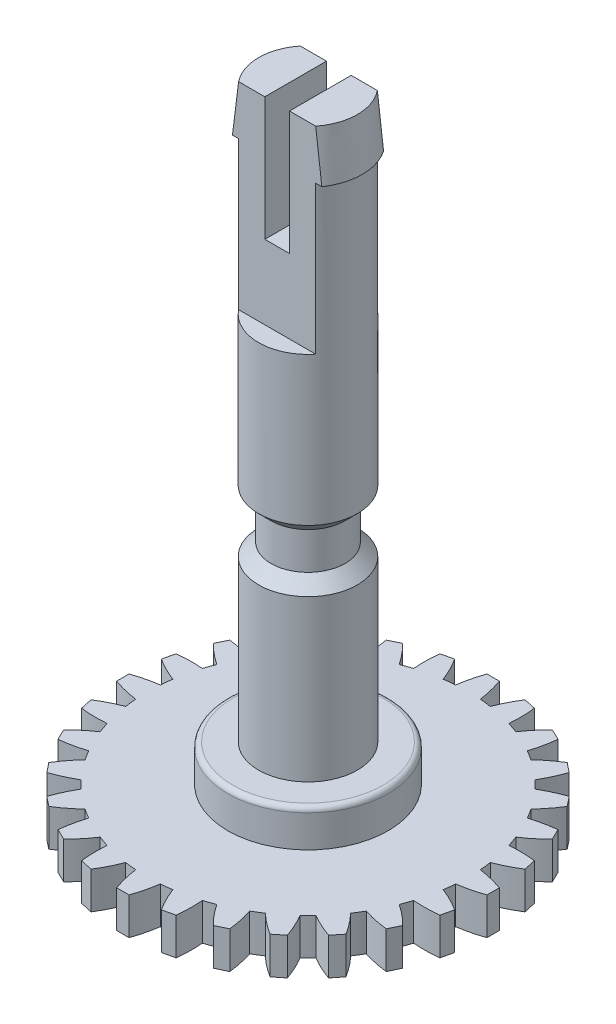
ISO-10303-21;
HEADER;
FILE_DESCRIPTION(('STEP AP214'),'2;1');
FILE_NAME('part.step','',(''),(''),'','','');
FILE_SCHEMA(('AUTOMOTIVE_DESIGN { 1 0 10303 214 1 1 1 1 }'));
ENDSEC;
DATA;
#1=APPLICATION_CONTEXT('core data for automotive mechanical design processes');
#2=APPLICATION_PROTOCOL_DEFINITION('international standard','automotive_design',2000,#1);
#3=PRODUCT_CONTEXT('',#1,'mechanical');
#4=PRODUCT('Part','Part','',(#3));
#5=PRODUCT_RELATED_PRODUCT_CATEGORY('part','',(#4));
#6=PRODUCT_DEFINITION_FORMATION('','',#4);
#7=PRODUCT_DEFINITION_CONTEXT('part definition',#1,'design');
#8=PRODUCT_DEFINITION('design','',#6,#7);
#9=PRODUCT_DEFINITION_SHAPE('','',#8);
#10=(LENGTH_UNIT() NAMED_UNIT(*) SI_UNIT(.MILLI.,.METRE.));
#11=(NAMED_UNIT(*) PLANE_ANGLE_UNIT() SI_UNIT($,.RADIAN.));
#12=(NAMED_UNIT(*) SI_UNIT($,.STERADIAN.) SOLID_ANGLE_UNIT());
#13=UNCERTAINTY_MEASURE_WITH_UNIT(LENGTH_MEASURE(1.E-05),#10,'distance_accuracy_value','');
#14=(GEOMETRIC_REPRESENTATION_CONTEXT(3) GLOBAL_UNCERTAINTY_ASSIGNED_CONTEXT((#13)) GLOBAL_UNIT_ASSIGNED_CONTEXT((#10,
#11,#12)) REPRESENTATION_CONTEXT('',''));
#15=CARTESIAN_POINT('',(0.,0.,0.));
#16=DIRECTION('',(0.,0.,1.));
#17=DIRECTION('',(1.,0.,0.));
#18=AXIS2_PLACEMENT_3D('',#15,#16,#17);
#19=CARTESIAN_POINT('',(0.,1.5,0.));
#20=DIRECTION('',(0.,-1.,0.));
#21=DIRECTION('',(0.,0.,-1.));
#22=AXIS2_PLACEMENT_3D('',#19,#20,#21);
#23=CYLINDRICAL_SURFACE('',#22,6.5);
#24=CARTESIAN_POINT('',(0.,1.5,0.));
#25=DIRECTION('',(0.,1.,0.));
#26=DIRECTION('',(0.,0.,1.));
#27=AXIS2_PLACEMENT_3D('',#24,#25,#26);
#28=CIRCLE('',#27,6.5);
#29=CARTESIAN_POINT('',(-0.954636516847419,1.5,6.42951546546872));
#30=VERTEX_POINT('',#29);
#31=CARTESIAN_POINT('',(-0.499999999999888,1.5,6.48074069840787));
#32=VERTEX_POINT('',#31);
#33=EDGE_CURVE('E49',#30,#32,#28,.T.);
#34=ORIENTED_EDGE('',*,*,#33,.F.);
#35=DIRECTION('',(0.,-1.,0.));
#36=VECTOR('',#35,1.);
#37=CARTESIAN_POINT('',(-0.954636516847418,3.25839302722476,6.42951546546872));
#38=LINE('',#37,#36);
#39=CARTESIAN_POINT('',(-0.954636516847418,0.,6.42951546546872));
#40=VERTEX_POINT('',#39);
#41=EDGE_CURVE('E815',#30,#40,#38,.T.);
#42=ORIENTED_EDGE('',*,*,#41,.T.);
#43=CARTESIAN_POINT('',(0.,0.,0.));
#44=DIRECTION('',(0.,1.,0.));
#45=DIRECTION('',(0.,0.,1.));
#46=AXIS2_PLACEMENT_3D('',#43,#44,#45);
#47=CIRCLE('',#46,6.5);
#48=CARTESIAN_POINT('',(-0.49999999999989,0.,6.48074069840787));
#49=VERTEX_POINT('',#48);
#50=EDGE_CURVE('E1702',#40,#49,#47,.T.);
#51=ORIENTED_EDGE('',*,*,#50,.T.);
#52=DIRECTION('',(0.,-1.,0.));
#53=VECTOR('',#52,1.);
#54=CARTESIAN_POINT('',(-0.499999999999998,3.25839302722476,6.48074069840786));
#55=LINE('',#54,#53);
#56=EDGE_CURVE('E1574',#32,#49,#55,.T.);
#57=ORIENTED_EDGE('',*,*,#56,.F.);
#58=EDGE_LOOP('',(#34,#42,#51,#57));
#59=FACE_BOUND('',#58,.T.);
#60=ADVANCED_FACE('F34',(#59),#23,.T.);
#61=CARTESIAN_POINT('',(-2.36140357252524,0.,6.05588747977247));
#62=VERTEX_POINT('',#61);
#63=CARTESIAN_POINT('',(-1.92956442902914,0.,6.20699453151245));
#64=VERTEX_POINT('',#63);
#65=EDGE_CURVE('E3275',#62,#64,#47,.T.);
#66=ORIENTED_EDGE('',*,*,#65,.T.);
#67=DIRECTION('',(0.,-1.,0.));
#68=VECTOR('',#67,1.);
#69=CARTESIAN_POINT('',(-1.92956442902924,3.25839302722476,6.20699453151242));
#70=LINE('',#69,#68);
#71=CARTESIAN_POINT('',(-1.92956442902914,1.5,6.20699453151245));
#72=VERTEX_POINT('',#71);
#73=EDGE_CURVE('E57',#72,#64,#70,.T.);
#74=ORIENTED_EDGE('',*,*,#73,.F.);
#75=CARTESIAN_POINT('',(-2.36140357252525,1.5,6.05588747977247));
#76=VERTEX_POINT('',#75);
#77=EDGE_CURVE('E1876',#76,#72,#28,.T.);
#78=ORIENTED_EDGE('',*,*,#77,.F.);
#79=DIRECTION('',(0.,-1.,0.));
#80=VECTOR('',#79,1.);
#81=CARTESIAN_POINT('',(-2.36140357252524,3.25839302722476,6.05588747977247));
#82=LINE('',#81,#80);
#83=EDGE_CURVE('E837',#76,#62,#82,.T.);
#84=ORIENTED_EDGE('',*,*,#83,.T.);
#85=EDGE_LOOP('',(#66,#74,#78,#84));
#86=FACE_BOUND('',#85,.T.);
#87=ADVANCED_FACE('F1753',(#86),#23,.T.);
#88=CARTESIAN_POINT('',(-3.64975999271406,0.,5.37859200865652));
#89=VERTEX_POINT('',#88);
#90=CARTESIAN_POINT('',(-3.26237244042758,0.,5.62200374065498));
#91=VERTEX_POINT('',#90);
#92=EDGE_CURVE('E3276',#89,#91,#47,.T.);
#93=ORIENTED_EDGE('',*,*,#92,.T.);
#94=DIRECTION('',(0.,-1.,0.));
#95=VECTOR('',#94,1.);
#96=CARTESIAN_POINT('',(-3.26237244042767,3.25839302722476,5.62200374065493));
#97=LINE('',#96,#95);
#98=CARTESIAN_POINT('',(-3.26237244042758,1.5,5.62200374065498));
#99=VERTEX_POINT('',#98);
#100=EDGE_CURVE('E846',#99,#91,#97,.T.);
#101=ORIENTED_EDGE('',*,*,#100,.F.);
#102=CARTESIAN_POINT('',(-3.64975999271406,1.5,5.37859200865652));
#103=VERTEX_POINT('',#102);
#104=EDGE_CURVE('E1873',#103,#99,#28,.T.);
#105=ORIENTED_EDGE('',*,*,#104,.F.);
#106=DIRECTION('',(0.,-1.,0.));
#107=VECTOR('',#106,1.);
#108=CARTESIAN_POINT('',(-3.64975999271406,3.25839302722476,5.37859200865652));
#109=LINE('',#108,#107);
#110=EDGE_CURVE('E865',#103,#89,#109,.T.);
#111=ORIENTED_EDGE('',*,*,#110,.T.);
#112=EDGE_LOOP('',(#93,#101,#105,#111));
#113=FACE_BOUND('',#112,.T.);
#114=ADVANCED_FACE('F1759',(#113),#23,.T.);
#115=CARTESIAN_POINT('',(-4.75510220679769,0.,4.43159147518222));
#116=VERTEX_POINT('',#115);
#117=CARTESIAN_POINT('',(-4.43159147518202,0.,4.75510220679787));
#118=VERTEX_POINT('',#117);
#119=EDGE_CURVE('E3277',#116,#118,#47,.T.);
#120=ORIENTED_EDGE('',*,*,#119,.T.);
#121=DIRECTION('',(0.,-1.,0.));
#122=VECTOR('',#121,1.);
#123=CARTESIAN_POINT('',(-4.4315914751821,3.25839302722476,4.7551022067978));
#124=LINE('',#123,#122);
#125=CARTESIAN_POINT('',(-4.43159147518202,1.5,4.75510220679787));
#126=VERTEX_POINT('',#125);
#127=EDGE_CURVE('E874',#126,#118,#124,.T.);
#128=ORIENTED_EDGE('',*,*,#127,.F.);
#129=CARTESIAN_POINT('',(-4.75510220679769,1.5,4.43159147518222));
#130=VERTEX_POINT('',#129);
#131=EDGE_CURVE('E1870',#130,#126,#28,.T.);
#132=ORIENTED_EDGE('',*,*,#131,.F.);
#133=DIRECTION('',(0.,-1.,0.));
#134=VECTOR('',#133,1.);
#135=CARTESIAN_POINT('',(-4.75510220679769,3.25839302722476,4.43159147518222));
#136=LINE('',#135,#134);
#137=EDGE_CURVE('E893',#130,#116,#136,.T.);
#138=ORIENTED_EDGE('',*,*,#137,.T.);
#139=EDGE_LOOP('',(#120,#128,#132,#138));
#140=FACE_BOUND('',#139,.T.);
#141=ADVANCED_FACE('F2063',(#140),#23,.T.);
#142=CARTESIAN_POINT('',(-5.62200374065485,0.,3.26237244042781));
#143=VERTEX_POINT('',#142);
#144=CARTESIAN_POINT('',(-5.37859200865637,0.,3.64975999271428));
#145=VERTEX_POINT('',#144);
#146=EDGE_CURVE('E3278',#143,#145,#47,.T.);
#147=ORIENTED_EDGE('',*,*,#146,.T.);
#148=DIRECTION('',(0.,-1.,0.));
#149=VECTOR('',#148,1.);
#150=CARTESIAN_POINT('',(-5.37859200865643,3.25839302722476,3.6497599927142));
#151=LINE('',#150,#149);
#152=CARTESIAN_POINT('',(-5.37859200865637,1.5,3.64975999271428));
#153=VERTEX_POINT('',#152);
#154=EDGE_CURVE('E902',#153,#145,#151,.T.);
#155=ORIENTED_EDGE('',*,*,#154,.F.);
#156=CARTESIAN_POINT('',(-5.62200374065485,1.5,3.26237244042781));
#157=VERTEX_POINT('',#156);
#158=EDGE_CURVE('E1867',#157,#153,#28,.T.);
#159=ORIENTED_EDGE('',*,*,#158,.F.);
#160=DIRECTION('',(0.,-1.,0.));
#161=VECTOR('',#160,1.);
#162=CARTESIAN_POINT('',(-5.62200374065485,3.25839302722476,3.26237244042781));
#163=LINE('',#162,#161);
#164=EDGE_CURVE('E921',#157,#143,#163,.T.);
#165=ORIENTED_EDGE('',*,*,#164,.T.);
#166=EDGE_LOOP('',(#147,#155,#159,#165));
#167=FACE_BOUND('',#166,.T.);
#168=ADVANCED_FACE('F2072',(#167),#23,.T.);
#169=CARTESIAN_POINT('',(-6.20699453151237,0.,1.92956442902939));
#170=VERTEX_POINT('',#169);
#171=CARTESIAN_POINT('',(-6.05588747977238,0.,2.36140357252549));
#172=VERTEX_POINT('',#171);
#173=EDGE_CURVE('E3279',#170,#172,#47,.T.);
#174=ORIENTED_EDGE('',*,*,#173,.T.);
#175=DIRECTION('',(0.,-1.,0.));
#176=VECTOR('',#175,1.);
#177=CARTESIAN_POINT('',(-6.05588747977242,3.25839302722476,2.3614035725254));
#178=LINE('',#177,#176);
#179=CARTESIAN_POINT('',(-6.05588747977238,1.5,2.36140357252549));
#180=VERTEX_POINT('',#179);
#181=EDGE_CURVE('E930',#180,#172,#178,.T.);
#182=ORIENTED_EDGE('',*,*,#181,.F.);
#183=CARTESIAN_POINT('',(-6.20699453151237,1.5,1.92956442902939));
#184=VERTEX_POINT('',#183);
#185=EDGE_CURVE('E1864',#184,#180,#28,.T.);
#186=ORIENTED_EDGE('',*,*,#185,.F.);
#187=DIRECTION('',(0.,-1.,0.));
#188=VECTOR('',#187,1.);
#189=CARTESIAN_POINT('',(-6.20699453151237,3.25839302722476,1.92956442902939));
#190=LINE('',#189,#188);
#191=EDGE_CURVE('E949',#184,#170,#190,.T.);
#192=ORIENTED_EDGE('',*,*,#191,.T.);
#193=EDGE_LOOP('',(#174,#182,#186,#192));
#194=FACE_BOUND('',#193,.T.);
#195=ADVANCED_FACE('F2081',(#194),#23,.T.);
#196=CARTESIAN_POINT('',(-6.48074069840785,0.,0.500000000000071));
#197=VERTEX_POINT('',#196);
#198=CARTESIAN_POINT('',(-6.4295154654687,0.,0.954636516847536));
#199=VERTEX_POINT('',#198);
#200=EDGE_CURVE('E3280',#197,#199,#47,.T.);
#201=ORIENTED_EDGE('',*,*,#200,.T.);
#202=DIRECTION('',(0.,-1.,0.));
#203=VECTOR('',#202,1.);
#204=CARTESIAN_POINT('',(-6.4295154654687,3.25839302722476,0.954636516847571));
#205=LINE('',#204,#203);
#206=CARTESIAN_POINT('',(-6.4295154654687,1.5,0.954636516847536));
#207=VERTEX_POINT('',#206);
#208=EDGE_CURVE('E958',#207,#199,#205,.T.);
#209=ORIENTED_EDGE('',*,*,#208,.F.);
#210=CARTESIAN_POINT('',(-6.48074069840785,1.5,0.500000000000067));
#211=VERTEX_POINT('',#210);
#212=EDGE_CURVE('E1861',#211,#207,#28,.T.);
#213=ORIENTED_EDGE('',*,*,#212,.F.);
#214=DIRECTION('',(0.,-1.,0.));
#215=VECTOR('',#214,1.);
#216=CARTESIAN_POINT('',(-6.48074069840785,3.25839302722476,0.500000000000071));
#217=LINE('',#216,#215);
#218=EDGE_CURVE('E977',#211,#197,#217,.T.);
#219=ORIENTED_EDGE('',*,*,#218,.T.);
#220=EDGE_LOOP('',(#201,#209,#213,#219));
#221=FACE_BOUND('',#220,.T.);
#222=ADVANCED_FACE('F2090',(#221),#23,.T.);
#223=CARTESIAN_POINT('',(-6.42951546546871,0.,-0.954636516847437));
#224=VERTEX_POINT('',#223);
#225=CARTESIAN_POINT('',(-6.48074069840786,0.,-0.499999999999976));
#226=VERTEX_POINT('',#225);
#227=EDGE_CURVE('E3281',#224,#226,#47,.T.);
#228=ORIENTED_EDGE('',*,*,#227,.T.);
#229=DIRECTION('',(0.,-1.,0.));
#230=VECTOR('',#229,1.);
#231=CARTESIAN_POINT('',(-6.48074069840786,3.25839302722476,-0.499999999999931));
#232=LINE('',#231,#230);
#233=CARTESIAN_POINT('',(-6.48074069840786,1.5,-0.499999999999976));
#234=VERTEX_POINT('',#233);
#235=EDGE_CURVE('E986',#234,#226,#232,.T.);
#236=ORIENTED_EDGE('',*,*,#235,.F.);
#237=CARTESIAN_POINT('',(-6.42951546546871,1.5,-0.95463651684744));
#238=VERTEX_POINT('',#237);
#239=EDGE_CURVE('E1858',#238,#234,#28,.T.);
#240=ORIENTED_EDGE('',*,*,#239,.F.);
#241=DIRECTION('',(0.,-1.,0.));
#242=VECTOR('',#241,1.);
#243=CARTESIAN_POINT('',(-6.42951546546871,3.25839302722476,-0.954636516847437));
#244=LINE('',#243,#242);
#245=EDGE_CURVE('E1005',#238,#224,#244,.T.);
#246=ORIENTED_EDGE('',*,*,#245,.T.);
#247=EDGE_LOOP('',(#228,#236,#240,#246));
#248=FACE_BOUND('',#247,.T.);
#249=ADVANCED_FACE('F2099',(#248),#23,.T.);
#250=CARTESIAN_POINT('',(-6.05588747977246,0.,-2.36140357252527));
#251=VERTEX_POINT('',#250);
#252=CARTESIAN_POINT('',(-6.20699453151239,0.,-1.92956442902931));
#253=VERTEX_POINT('',#252);
#254=EDGE_CURVE('E3282',#251,#253,#47,.T.);
#255=ORIENTED_EDGE('',*,*,#254,.T.);
#256=DIRECTION('',(0.,-1.,0.));
#257=VECTOR('',#256,1.);
#258=CARTESIAN_POINT('',(-6.20699453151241,3.25839302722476,-1.92956442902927));
#259=LINE('',#258,#257);
#260=CARTESIAN_POINT('',(-6.20699453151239,1.5,-1.92956442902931));
#261=VERTEX_POINT('',#260);
#262=EDGE_CURVE('E1014',#261,#253,#259,.T.);
#263=ORIENTED_EDGE('',*,*,#262,.F.);
#264=CARTESIAN_POINT('',(-6.05588747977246,1.5,-2.36140357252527));
#265=VERTEX_POINT('',#264);
#266=EDGE_CURVE('E1855',#265,#261,#28,.T.);
#267=ORIENTED_EDGE('',*,*,#266,.F.);
#268=DIRECTION('',(0.,-1.,0.));
#269=VECTOR('',#268,1.);
#270=CARTESIAN_POINT('',(-6.05588747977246,3.25839302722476,-2.36140357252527));
#271=LINE('',#270,#269);
#272=EDGE_CURVE('E1033',#265,#251,#271,.T.);
#273=ORIENTED_EDGE('',*,*,#272,.T.);
#274=EDGE_LOOP('',(#255,#263,#267,#273));
#275=FACE_BOUND('',#274,.T.);
#276=ADVANCED_FACE('F2108',(#275),#23,.T.);
#277=CARTESIAN_POINT('',(-5.37859200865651,0.,-3.64975999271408));
#278=VERTEX_POINT('',#277);
#279=CARTESIAN_POINT('',(-5.62200374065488,0.,-3.26237244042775));
#280=VERTEX_POINT('',#279);
#281=EDGE_CURVE('E3283',#278,#280,#47,.T.);
#282=ORIENTED_EDGE('',*,*,#281,.T.);
#283=DIRECTION('',(0.,-1.,0.));
#284=VECTOR('',#283,1.);
#285=CARTESIAN_POINT('',(-5.62200374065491,3.25839302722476,-3.26237244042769));
#286=LINE('',#285,#284);
#287=CARTESIAN_POINT('',(-5.62200374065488,1.5,-3.26237244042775));
#288=VERTEX_POINT('',#287);
#289=EDGE_CURVE('E1042',#288,#280,#286,.T.);
#290=ORIENTED_EDGE('',*,*,#289,.F.);
#291=CARTESIAN_POINT('',(-5.37859200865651,1.5,-3.64975999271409));
#292=VERTEX_POINT('',#291);
#293=EDGE_CURVE('E1852',#292,#288,#28,.T.);
#294=ORIENTED_EDGE('',*,*,#293,.F.);
#295=DIRECTION('',(0.,-1.,0.));
#296=VECTOR('',#295,1.);
#297=CARTESIAN_POINT('',(-5.37859200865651,3.25839302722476,-3.64975999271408));
#298=LINE('',#297,#296);
#299=EDGE_CURVE('E1061',#292,#278,#298,.T.);
#300=ORIENTED_EDGE('',*,*,#299,.T.);
#301=EDGE_LOOP('',(#282,#290,#294,#300));
#302=FACE_BOUND('',#301,.T.);
#303=ADVANCED_FACE('F2117',(#302),#23,.T.);
#304=CARTESIAN_POINT('',(-4.4315914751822,0.,-4.75510220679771));
#305=VERTEX_POINT('',#304);
#306=CARTESIAN_POINT('',(-4.75510220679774,0.,-4.43159147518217));
#307=VERTEX_POINT('',#306);
#308=EDGE_CURVE('E3284',#305,#307,#47,.T.);
#309=ORIENTED_EDGE('',*,*,#308,.T.);
#310=DIRECTION('',(0.,-1.,0.));
#311=VECTOR('',#310,1.);
#312=CARTESIAN_POINT('',(-4.75510220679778,3.25839302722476,-4.43159147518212));
#313=LINE('',#312,#311);
#314=CARTESIAN_POINT('',(-4.75510220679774,1.5,-4.43159147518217));
#315=VERTEX_POINT('',#314);
#316=EDGE_CURVE('E1070',#315,#307,#313,.T.);
#317=ORIENTED_EDGE('',*,*,#316,.F.);
#318=CARTESIAN_POINT('',(-4.4315914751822,1.5,-4.75510220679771));
#319=VERTEX_POINT('',#318);
#320=EDGE_CURVE('E1849',#319,#315,#28,.T.);
#321=ORIENTED_EDGE('',*,*,#320,.F.);
#322=DIRECTION('',(0.,-1.,0.));
#323=VECTOR('',#322,1.);
#324=CARTESIAN_POINT('',(-4.4315914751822,3.25839302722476,-4.75510220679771));
#325=LINE('',#324,#323);
#326=EDGE_CURVE('E1089',#319,#305,#325,.T.);
#327=ORIENTED_EDGE('',*,*,#326,.T.);
#328=EDGE_LOOP('',(#309,#317,#321,#327));
#329=FACE_BOUND('',#328,.T.);
#330=ADVANCED_FACE('F2126',(#329),#23,.T.);
#331=CARTESIAN_POINT('',(-3.26237244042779,0.,-5.62200374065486));
#332=VERTEX_POINT('',#331);
#333=CARTESIAN_POINT('',(-3.64975999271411,0.,-5.37859200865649));
#334=VERTEX_POINT('',#333);
#335=EDGE_CURVE('E3285',#332,#334,#47,.T.);
#336=ORIENTED_EDGE('',*,*,#335,.T.);
#337=DIRECTION('',(0.,-1.,0.));
#338=VECTOR('',#337,1.);
#339=CARTESIAN_POINT('',(-3.64975999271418,3.25839302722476,-5.37859200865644));
#340=LINE('',#339,#338);
#341=CARTESIAN_POINT('',(-3.64975999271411,1.5,-5.37859200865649));
#342=VERTEX_POINT('',#341);
#343=EDGE_CURVE('E1098',#342,#334,#340,.T.);
#344=ORIENTED_EDGE('',*,*,#343,.F.);
#345=CARTESIAN_POINT('',(-3.26237244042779,1.5,-5.62200374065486));
#346=VERTEX_POINT('',#345);
#347=EDGE_CURVE('E1846',#346,#342,#28,.T.);
#348=ORIENTED_EDGE('',*,*,#347,.F.);
#349=DIRECTION('',(0.,-1.,0.));
#350=VECTOR('',#349,1.);
#351=CARTESIAN_POINT('',(-3.26237244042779,3.25839302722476,-5.62200374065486));
#352=LINE('',#351,#350);
#353=EDGE_CURVE('E1117',#346,#332,#352,.T.);
#354=ORIENTED_EDGE('',*,*,#353,.T.);
#355=EDGE_LOOP('',(#336,#344,#348,#354));
#356=FACE_BOUND('',#355,.T.);
#357=ADVANCED_FACE('F2135',(#356),#23,.T.);
#358=CARTESIAN_POINT('',(-1.92956442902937,0.,-6.20699453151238));
#359=VERTEX_POINT('',#358);
#360=CARTESIAN_POINT('',(-2.3614035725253,0.,-6.05588747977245));
#361=VERTEX_POINT('',#360);
#362=EDGE_CURVE('E3286',#359,#361,#47,.T.);
#363=ORIENTED_EDGE('',*,*,#362,.T.);
#364=DIRECTION('',(0.,-1.,0.));
#365=VECTOR('',#364,1.);
#366=CARTESIAN_POINT('',(-2.36140357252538,3.25839302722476,-6.05588747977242));
#367=LINE('',#366,#365);
#368=CARTESIAN_POINT('',(-2.3614035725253,1.5,-6.05588747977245));
#369=VERTEX_POINT('',#368);
#370=EDGE_CURVE('E1126',#369,#361,#367,.T.);
#371=ORIENTED_EDGE('',*,*,#370,.F.);
#372=CARTESIAN_POINT('',(-1.92956442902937,1.5,-6.20699453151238));
#373=VERTEX_POINT('',#372);
#374=EDGE_CURVE('E1843',#373,#369,#28,.T.);
#375=ORIENTED_EDGE('',*,*,#374,.F.);
#376=DIRECTION('',(0.,-1.,0.));
#377=VECTOR('',#376,1.);
#378=CARTESIAN_POINT('',(-1.92956442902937,3.25839302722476,-6.20699453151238));
#379=LINE('',#378,#377);
#380=EDGE_CURVE('E1145',#373,#359,#379,.T.);
#381=ORIENTED_EDGE('',*,*,#380,.T.);
#382=EDGE_LOOP('',(#363,#371,#375,#381));
#383=FACE_BOUND('',#382,.T.);
#384=ADVANCED_FACE('F2144',(#383),#23,.T.);
#385=CARTESIAN_POINT('',(-0.500000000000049,0.,-6.48074069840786));
#386=VERTEX_POINT('',#385);
#387=CARTESIAN_POINT('',(-0.954636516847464,0.,-6.42951546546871));
#388=VERTEX_POINT('',#387);
#389=EDGE_CURVE('E3287',#386,#388,#47,.T.);
#390=ORIENTED_EDGE('',*,*,#389,.T.);
#391=DIRECTION('',(0.,-1.,0.));
#392=VECTOR('',#391,1.);
#393=CARTESIAN_POINT('',(-0.954636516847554,3.25839302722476,-6.4295154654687));
#394=LINE('',#393,#392);
#395=CARTESIAN_POINT('',(-0.954636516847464,1.5,-6.42951546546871));
#396=VERTEX_POINT('',#395);
#397=EDGE_CURVE('E1154',#396,#388,#394,.T.);
#398=ORIENTED_EDGE('',*,*,#397,.F.);
#399=CARTESIAN_POINT('',(-0.500000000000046,1.5,-6.48074069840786));
#400=VERTEX_POINT('',#399);
#401=EDGE_CURVE('E1840',#400,#396,#28,.T.);
#402=ORIENTED_EDGE('',*,*,#401,.F.);
#403=DIRECTION('',(0.,-1.,0.));
#404=VECTOR('',#403,1.);
#405=CARTESIAN_POINT('',(-0.500000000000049,3.25839302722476,-6.48074069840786));
#406=LINE('',#405,#404);
#407=EDGE_CURVE('E1173',#400,#386,#406,.T.);
#408=ORIENTED_EDGE('',*,*,#407,.T.);
#409=EDGE_LOOP('',(#390,#398,#402,#408));
#410=FACE_BOUND('',#409,.T.);
#411=ADVANCED_FACE('F2153',(#410),#23,.T.);
#412=CARTESIAN_POINT('',(0.95463651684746,0.,-6.42951546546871));
#413=VERTEX_POINT('',#412);
#414=CARTESIAN_POINT('',(0.500000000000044,0.,-6.48074069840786));
#415=VERTEX_POINT('',#414);
#416=EDGE_CURVE('E3288',#413,#415,#47,.T.);
#417=ORIENTED_EDGE('',*,*,#416,.T.);
#418=DIRECTION('',(0.,-1.,0.));
#419=VECTOR('',#418,1.);
#420=CARTESIAN_POINT('',(0.499999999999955,3.25839302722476,-6.48074069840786));
#421=LINE('',#420,#419);
#422=CARTESIAN_POINT('',(0.500000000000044,1.5,-6.48074069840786));
#423=VERTEX_POINT('',#422);
#424=EDGE_CURVE('E1182',#423,#415,#421,.T.);
#425=ORIENTED_EDGE('',*,*,#424,.F.);
#426=CARTESIAN_POINT('',(0.954636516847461,1.5,-6.42951546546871));
#427=VERTEX_POINT('',#426);
#428=EDGE_CURVE('E1837',#427,#423,#28,.T.);
#429=ORIENTED_EDGE('',*,*,#428,.F.);
#430=DIRECTION('',(0.,-1.,0.));
#431=VECTOR('',#430,1.);
#432=CARTESIAN_POINT('',(0.95463651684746,3.25839302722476,-6.42951546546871));
#433=LINE('',#432,#431);
#434=EDGE_CURVE('E1201',#427,#413,#433,.T.);
#435=ORIENTED_EDGE('',*,*,#434,.T.);
#436=EDGE_LOOP('',(#417,#425,#429,#435));
#437=FACE_BOUND('',#436,.T.);
#438=ADVANCED_FACE('F2162',(#437),#23,.T.);
#439=CARTESIAN_POINT('',(2.36140357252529,0.,-6.05588747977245));
#440=VERTEX_POINT('',#439);
#441=CARTESIAN_POINT('',(1.92956442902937,0.,-6.20699453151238));
#442=VERTEX_POINT('',#441);
#443=EDGE_CURVE('E3289',#440,#442,#47,.T.);
#444=ORIENTED_EDGE('',*,*,#443,.T.);
#445=DIRECTION('',(0.,-1.,0.));
#446=VECTOR('',#445,1.);
#447=CARTESIAN_POINT('',(1.92956442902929,3.25839302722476,-6.2069945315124));
#448=LINE('',#447,#446);
#449=CARTESIAN_POINT('',(1.92956442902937,1.5,-6.20699453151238));
#450=VERTEX_POINT('',#449);
#451=EDGE_CURVE('E1210',#450,#442,#448,.T.);
#452=ORIENTED_EDGE('',*,*,#451,.F.);
#453=CARTESIAN_POINT('',(2.36140357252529,1.5,-6.05588747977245));
#454=VERTEX_POINT('',#453);
#455=EDGE_CURVE('E1834',#454,#450,#28,.T.);
#456=ORIENTED_EDGE('',*,*,#455,.F.);
#457=DIRECTION('',(0.,-1.,0.));
#458=VECTOR('',#457,1.);
#459=CARTESIAN_POINT('',(2.36140357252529,3.25839302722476,-6.05588747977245));
#460=LINE('',#459,#458);
#461=EDGE_CURVE('E1229',#454,#440,#460,.T.);
#462=ORIENTED_EDGE('',*,*,#461,.T.);
#463=EDGE_LOOP('',(#444,#452,#456,#462));
#464=FACE_BOUND('',#463,.T.);
#465=ADVANCED_FACE('F2171',(#464),#23,.T.);
#466=CARTESIAN_POINT('',(3.6497599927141,0.,-5.3785920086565));
#467=VERTEX_POINT('',#466);
#468=CARTESIAN_POINT('',(3.26237244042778,0.,-5.62200374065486));
#469=VERTEX_POINT('',#468);
#470=EDGE_CURVE('E3290',#467,#469,#47,.T.);
#471=ORIENTED_EDGE('',*,*,#470,.T.);
#472=DIRECTION('',(0.,-1.,0.));
#473=VECTOR('',#472,1.);
#474=CARTESIAN_POINT('',(3.26237244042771,3.25839302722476,-5.6220037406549));
#475=LINE('',#474,#473);
#476=CARTESIAN_POINT('',(3.26237244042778,1.5,-5.62200374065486));
#477=VERTEX_POINT('',#476);
#478=EDGE_CURVE('E1238',#477,#469,#475,.T.);
#479=ORIENTED_EDGE('',*,*,#478,.F.);
#480=CARTESIAN_POINT('',(3.6497599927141,1.5,-5.3785920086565));
#481=VERTEX_POINT('',#480);
#482=EDGE_CURVE('E1831',#481,#477,#28,.T.);
#483=ORIENTED_EDGE('',*,*,#482,.F.);
#484=DIRECTION('',(0.,-1.,0.));
#485=VECTOR('',#484,1.);
#486=CARTESIAN_POINT('',(3.6497599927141,3.25839302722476,-5.3785920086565));
#487=LINE('',#486,#485);
#488=EDGE_CURVE('E1257',#481,#467,#487,.T.);
#489=ORIENTED_EDGE('',*,*,#488,.T.);
#490=EDGE_LOOP('',(#471,#479,#483,#489));
#491=FACE_BOUND('',#490,.T.);
#492=ADVANCED_FACE('F2180',(#491),#23,.T.);
#493=CARTESIAN_POINT('',(4.75510220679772,0.,-4.43159147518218));
#494=VERTEX_POINT('',#493);
#495=CARTESIAN_POINT('',(4.43159147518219,0.,-4.75510220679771));
#496=VERTEX_POINT('',#495);
#497=EDGE_CURVE('E3291',#494,#496,#47,.T.);
#498=ORIENTED_EDGE('',*,*,#497,.T.);
#499=DIRECTION('',(0.,-1.,0.));
#500=VECTOR('',#499,1.);
#501=CARTESIAN_POINT('',(4.43159147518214,3.25839302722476,-4.75510220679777));
#502=LINE('',#501,#500);
#503=CARTESIAN_POINT('',(4.43159147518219,1.5,-4.75510220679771));
#504=VERTEX_POINT('',#503);
#505=EDGE_CURVE('E1266',#504,#496,#502,.T.);
#506=ORIENTED_EDGE('',*,*,#505,.F.);
#507=CARTESIAN_POINT('',(4.75510220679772,1.5,-4.43159147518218));
#508=VERTEX_POINT('',#507);
#509=EDGE_CURVE('E1828',#508,#504,#28,.T.);
#510=ORIENTED_EDGE('',*,*,#509,.F.);
#511=DIRECTION('',(0.,-1.,0.));
#512=VECTOR('',#511,1.);
#513=CARTESIAN_POINT('',(4.75510220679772,3.25839302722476,-4.43159147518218));
#514=LINE('',#513,#512);
#515=EDGE_CURVE('E1285',#508,#494,#514,.T.);
#516=ORIENTED_EDGE('',*,*,#515,.T.);
#517=EDGE_LOOP('',(#498,#506,#510,#516));
#518=FACE_BOUND('',#517,.T.);
#519=ADVANCED_FACE('F2189',(#518),#23,.T.);
#520=CARTESIAN_POINT('',(5.62200374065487,0.,-3.26237244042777));
#521=VERTEX_POINT('',#520);
#522=CARTESIAN_POINT('',(5.3785920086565,0.,-3.6497599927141));
#523=VERTEX_POINT('',#522);
#524=EDGE_CURVE('E3292',#521,#523,#47,.T.);
#525=ORIENTED_EDGE('',*,*,#524,.T.);
#526=DIRECTION('',(0.,-1.,0.));
#527=VECTOR('',#526,1.);
#528=CARTESIAN_POINT('',(5.37859200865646,3.25839302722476,-3.64975999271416));
#529=LINE('',#528,#527);
#530=CARTESIAN_POINT('',(5.3785920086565,1.5,-3.6497599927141));
#531=VERTEX_POINT('',#530);
#532=EDGE_CURVE('E1294',#531,#523,#529,.T.);
#533=ORIENTED_EDGE('',*,*,#532,.F.);
#534=CARTESIAN_POINT('',(5.62200374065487,1.5,-3.26237244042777));
#535=VERTEX_POINT('',#534);
#536=EDGE_CURVE('E1825',#535,#531,#28,.T.);
#537=ORIENTED_EDGE('',*,*,#536,.F.);
#538=DIRECTION('',(0.,-1.,0.));
#539=VECTOR('',#538,1.);
#540=CARTESIAN_POINT('',(5.62200374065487,3.25839302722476,-3.26237244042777));
#541=LINE('',#540,#539);
#542=EDGE_CURVE('E1313',#535,#521,#541,.T.);
#543=ORIENTED_EDGE('',*,*,#542,.T.);
#544=EDGE_LOOP('',(#525,#533,#537,#543));
#545=FACE_BOUND('',#544,.T.);
#546=ADVANCED_FACE('F2198',(#545),#23,.T.);
#547=CARTESIAN_POINT('',(6.20699453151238,0.,-1.92956442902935));
#548=VERTEX_POINT('',#547);
#549=CARTESIAN_POINT('',(6.05588747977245,0.,-2.3614035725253));
#550=VERTEX_POINT('',#549);
#551=EDGE_CURVE('E3293',#548,#550,#47,.T.);
#552=ORIENTED_EDGE('',*,*,#551,.T.);
#553=DIRECTION('',(0.,-1.,0.));
#554=VECTOR('',#553,1.);
#555=CARTESIAN_POINT('',(6.05588747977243,3.25839302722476,-2.36140357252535));
#556=LINE('',#555,#554);
#557=CARTESIAN_POINT('',(6.05588747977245,1.5,-2.3614035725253));
#558=VERTEX_POINT('',#557);
#559=EDGE_CURVE('E1322',#558,#550,#556,.T.);
#560=ORIENTED_EDGE('',*,*,#559,.F.);
#561=CARTESIAN_POINT('',(6.20699453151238,1.5,-1.92956442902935));
#562=VERTEX_POINT('',#561);
#563=EDGE_CURVE('E1822',#562,#558,#28,.T.);
#564=ORIENTED_EDGE('',*,*,#563,.F.);
#565=DIRECTION('',(0.,-1.,0.));
#566=VECTOR('',#565,1.);
#567=CARTESIAN_POINT('',(6.20699453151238,3.25839302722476,-1.92956442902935));
#568=LINE('',#567,#566);
#569=EDGE_CURVE('E1341',#562,#548,#568,.T.);
#570=ORIENTED_EDGE('',*,*,#569,.T.);
#571=EDGE_LOOP('',(#552,#560,#564,#570));
#572=FACE_BOUND('',#571,.T.);
#573=ADVANCED_FACE('F2207',(#572),#23,.T.);
#574=CARTESIAN_POINT('',(6.48074069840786,0.,-0.500000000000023));
#575=VERTEX_POINT('',#574);
#576=CARTESIAN_POINT('',(6.42951546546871,0.,-0.954636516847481));
#577=VERTEX_POINT('',#576);
#578=EDGE_CURVE('E3294',#575,#577,#47,.T.);
#579=ORIENTED_EDGE('',*,*,#578,.T.);
#580=DIRECTION('',(0.,-1.,0.));
#581=VECTOR('',#580,1.);
#582=CARTESIAN_POINT('',(6.4295154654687,3.25839302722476,-0.954636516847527));
#583=LINE('',#582,#581);
#584=CARTESIAN_POINT('',(6.42951546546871,1.5,-0.954636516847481));
#585=VERTEX_POINT('',#584);
#586=EDGE_CURVE('E1350',#585,#577,#583,.T.);
#587=ORIENTED_EDGE('',*,*,#586,.F.);
#588=CARTESIAN_POINT('',(6.48074069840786,1.5,-0.500000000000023));
#589=VERTEX_POINT('',#588);
#590=EDGE_CURVE('E1819',#589,#585,#28,.T.);
#591=ORIENTED_EDGE('',*,*,#590,.F.);
#592=DIRECTION('',(0.,-1.,0.));
#593=VECTOR('',#592,1.);
#594=CARTESIAN_POINT('',(6.48074069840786,3.25839302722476,-0.500000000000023));
#595=LINE('',#594,#593);
#596=EDGE_CURVE('E1369',#589,#575,#595,.T.);
#597=ORIENTED_EDGE('',*,*,#596,.T.);
#598=EDGE_LOOP('',(#579,#587,#591,#597));
#599=FACE_BOUND('',#598,.T.);
#600=ADVANCED_FACE('F2216',(#599),#23,.T.);
#601=CARTESIAN_POINT('',(6.42951546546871,0.,0.954636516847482));
#602=VERTEX_POINT('',#601);
#603=CARTESIAN_POINT('',(6.48074069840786,0.,0.500000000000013));
#604=VERTEX_POINT('',#603);
#605=EDGE_CURVE('E3295',#602,#604,#47,.T.);
#606=ORIENTED_EDGE('',*,*,#605,.T.);
#607=DIRECTION('',(0.,-1.,0.));
#608=VECTOR('',#607,1.);
#609=CARTESIAN_POINT('',(6.48074069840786,3.25839302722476,0.499999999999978));
#610=LINE('',#609,#608);
#611=CARTESIAN_POINT('',(6.48074069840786,1.5,0.500000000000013));
#612=VERTEX_POINT('',#611);
#613=EDGE_CURVE('E1378',#612,#604,#610,.T.);
#614=ORIENTED_EDGE('',*,*,#613,.F.);
#615=CARTESIAN_POINT('',(6.42951546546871,1.5,0.954636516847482));
#616=VERTEX_POINT('',#615);
#617=EDGE_CURVE('E1816',#616,#612,#28,.T.);
#618=ORIENTED_EDGE('',*,*,#617,.F.);
#619=DIRECTION('',(0.,-1.,0.));
#620=VECTOR('',#619,1.);
#621=CARTESIAN_POINT('',(6.42951546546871,3.25839302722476,0.954636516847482));
#622=LINE('',#621,#620);
#623=EDGE_CURVE('E1397',#616,#602,#622,.T.);
#624=ORIENTED_EDGE('',*,*,#623,.T.);
#625=EDGE_LOOP('',(#606,#614,#618,#624));
#626=FACE_BOUND('',#625,.T.);
#627=ADVANCED_FACE('F2225',(#626),#23,.T.);
#628=CARTESIAN_POINT('',(6.05588747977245,0.,2.36140357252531));
#629=VERTEX_POINT('',#628);
#630=CARTESIAN_POINT('',(6.20699453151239,0.,1.92956442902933));
#631=VERTEX_POINT('',#630);
#632=EDGE_CURVE('E3296',#629,#631,#47,.T.);
#633=ORIENTED_EDGE('',*,*,#632,.T.);
#634=DIRECTION('',(0.,-1.,0.));
#635=VECTOR('',#634,1.);
#636=CARTESIAN_POINT('',(6.2069945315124,3.25839302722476,1.92956442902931));
#637=LINE('',#636,#635);
#638=CARTESIAN_POINT('',(6.20699453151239,1.5,1.92956442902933));
#639=VERTEX_POINT('',#638);
#640=EDGE_CURVE('E1406',#639,#631,#637,.T.);
#641=ORIENTED_EDGE('',*,*,#640,.F.);
#642=CARTESIAN_POINT('',(6.05588747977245,1.5,2.36140357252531));
#643=VERTEX_POINT('',#642);
#644=EDGE_CURVE('E1813',#643,#639,#28,.T.);
#645=ORIENTED_EDGE('',*,*,#644,.F.);
#646=DIRECTION('',(0.,-1.,0.));
#647=VECTOR('',#646,1.);
#648=CARTESIAN_POINT('',(6.05588747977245,3.25839302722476,2.36140357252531));
#649=LINE('',#648,#647);
#650=EDGE_CURVE('E1425',#643,#629,#649,.T.);
#651=ORIENTED_EDGE('',*,*,#650,.T.);
#652=EDGE_LOOP('',(#633,#641,#645,#651));
#653=FACE_BOUND('',#652,.T.);
#654=ADVANCED_FACE('F2234',(#653),#23,.T.);
#655=CARTESIAN_POINT('',(5.37859200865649,0.,3.64975999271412));
#656=VERTEX_POINT('',#655);
#657=CARTESIAN_POINT('',(5.62200374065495,0.,3.26237244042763));
#658=VERTEX_POINT('',#657);
#659=EDGE_CURVE('E3297',#656,#658,#47,.T.);
#660=ORIENTED_EDGE('',*,*,#659,.T.);
#661=DIRECTION('',(0.,-1.,0.));
#662=VECTOR('',#661,1.);
#663=CARTESIAN_POINT('',(5.62200374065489,3.25839302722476,3.26237244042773));
#664=LINE('',#663,#662);
#665=CARTESIAN_POINT('',(5.62200374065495,1.5,3.26237244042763));
#666=VERTEX_POINT('',#665);
#667=EDGE_CURVE('E1434',#666,#658,#664,.T.);
#668=ORIENTED_EDGE('',*,*,#667,.F.);
#669=CARTESIAN_POINT('',(5.37859200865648,1.5,3.64975999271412));
#670=VERTEX_POINT('',#669);
#671=EDGE_CURVE('E1810',#670,#666,#28,.T.);
#672=ORIENTED_EDGE('',*,*,#671,.F.);
#673=DIRECTION('',(0.,-1.,0.));
#674=VECTOR('',#673,1.);
#675=CARTESIAN_POINT('',(5.37859200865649,3.25839302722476,3.64975999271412));
#676=LINE('',#675,#674);
#677=EDGE_CURVE('E1453',#670,#656,#676,.T.);
#678=ORIENTED_EDGE('',*,*,#677,.T.);
#679=EDGE_LOOP('',(#660,#668,#672,#678));
#680=FACE_BOUND('',#679,.T.);
#681=ADVANCED_FACE('F2243',(#680),#23,.T.);
#682=CARTESIAN_POINT('',(4.43159147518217,0.,4.75510220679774));
#683=VERTEX_POINT('',#682);
#684=CARTESIAN_POINT('',(4.75510220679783,0.,4.43159147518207));
#685=VERTEX_POINT('',#684);
#686=EDGE_CURVE('E3298',#683,#685,#47,.T.);
#687=ORIENTED_EDGE('',*,*,#686,.T.);
#688=DIRECTION('',(0.,-1.,0.));
#689=VECTOR('',#688,1.);
#690=CARTESIAN_POINT('',(4.75510220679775,3.25839302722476,4.43159147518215));
#691=LINE('',#690,#689);
#692=CARTESIAN_POINT('',(4.75510220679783,1.5,4.43159147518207));
#693=VERTEX_POINT('',#692);
#694=EDGE_CURVE('E1462',#693,#685,#691,.T.);
#695=ORIENTED_EDGE('',*,*,#694,.F.);
#696=CARTESIAN_POINT('',(4.43159147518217,1.5,4.75510220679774));
#697=VERTEX_POINT('',#696);
#698=EDGE_CURVE('E1808',#697,#693,#28,.T.);
#699=ORIENTED_EDGE('',*,*,#698,.F.);
#700=DIRECTION('',(0.,-1.,0.));
#701=VECTOR('',#700,1.);
#702=CARTESIAN_POINT('',(4.43159147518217,3.25839302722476,4.75510220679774));
#703=LINE('',#702,#701);
#704=EDGE_CURVE('E1481',#697,#683,#703,.T.);
#705=ORIENTED_EDGE('',*,*,#704,.T.);
#706=EDGE_LOOP('',(#687,#695,#699,#705));
#707=FACE_BOUND('',#706,.T.);
#708=ADVANCED_FACE('F1786',(#707),#23,.T.);
#709=CARTESIAN_POINT('',(3.26237244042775,0.,5.62200374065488));
#710=VERTEX_POINT('',#709);
#711=CARTESIAN_POINT('',(3.64975999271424,0.,5.37859200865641));
#712=VERTEX_POINT('',#711);
#713=EDGE_CURVE('E1792',#710,#712,#47,.T.);
#714=ORIENTED_EDGE('',*,*,#713,.T.);
#715=DIRECTION('',(0.,-1.,0.));
#716=VECTOR('',#715,1.);
#717=CARTESIAN_POINT('',(3.64975999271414,3.25839302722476,5.37859200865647));
#718=LINE('',#717,#716);
#719=CARTESIAN_POINT('',(3.64975999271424,1.5,5.37859200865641));
#720=VERTEX_POINT('',#719);
#721=EDGE_CURVE('E1490',#720,#712,#718,.T.);
#722=ORIENTED_EDGE('',*,*,#721,.F.);
#723=CARTESIAN_POINT('',(3.26237244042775,1.5,5.62200374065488));
#724=VERTEX_POINT('',#723);
#725=EDGE_CURVE('E1807',#724,#720,#28,.T.);
#726=ORIENTED_EDGE('',*,*,#725,.F.);
#727=DIRECTION('',(0.,-1.,0.));
#728=VECTOR('',#727,1.);
#729=CARTESIAN_POINT('',(3.26237244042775,3.25839302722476,5.62200374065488));
#730=LINE('',#729,#728);
#731=EDGE_CURVE('E1509',#724,#710,#730,.T.);
#732=ORIENTED_EDGE('',*,*,#731,.T.);
#733=EDGE_LOOP('',(#714,#722,#726,#732));
#734=FACE_BOUND('',#733,.T.);
#735=ADVANCED_FACE('F1776',(#734),#23,.T.);
#736=CARTESIAN_POINT('',(1.92956442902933,0.,6.20699453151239));
#737=VERTEX_POINT('',#736);
#738=CARTESIAN_POINT('',(2.36140357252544,0.,6.0558874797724));
#739=VERTEX_POINT('',#738);
#740=EDGE_CURVE('E1710',#737,#739,#47,.T.);
#741=ORIENTED_EDGE('',*,*,#740,.T.);
#742=DIRECTION('',(0.,-1.,0.));
#743=VECTOR('',#742,1.);
#744=CARTESIAN_POINT('',(2.36140357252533,3.25839302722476,6.05588747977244));
#745=LINE('',#744,#743);
#746=CARTESIAN_POINT('',(2.36140357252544,1.5,6.0558874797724));
#747=VERTEX_POINT('',#746);
#748=EDGE_CURVE('E1518',#747,#739,#745,.T.);
#749=ORIENTED_EDGE('',*,*,#748,.F.);
#750=CARTESIAN_POINT('',(1.92956442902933,1.5,6.20699453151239));
#751=VERTEX_POINT('',#750);
#752=EDGE_CURVE('E1707',#751,#747,#28,.T.);
#753=ORIENTED_EDGE('',*,*,#752,.F.);
#754=DIRECTION('',(0.,-1.,0.));
#755=VECTOR('',#754,1.);
#756=CARTESIAN_POINT('',(1.92956442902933,3.25839302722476,6.20699453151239));
#757=LINE('',#756,#755);
#758=EDGE_CURVE('E1537',#751,#737,#757,.T.);
#759=ORIENTED_EDGE('',*,*,#758,.T.);
#760=EDGE_LOOP('',(#741,#749,#753,#759));
#761=FACE_BOUND('',#760,.T.);
#762=ADVANCED_FACE('F1766',(#761),#23,.T.);
#763=CARTESIAN_POINT('',(0.,26.,0.));
#764=DIRECTION('',(0.,1.,0.));
#765=DIRECTION('',(0.,0.,1.));
#766=AXIS2_PLACEMENT_3D('',#763,#764,#765);
#767=PLANE('',#766);
#768=DIRECTION('',(0.,0.,1.));
#769=VECTOR('',#768,1.);
#770=CARTESIAN_POINT('',(-0.5,26.,-6.501));
#771=LINE('',#770,#769);
#772=CARTESIAN_POINT('',(-0.5,26.,-1.25));
#773=VERTEX_POINT('',#772);
#774=CARTESIAN_POINT('',(-0.5,26.,1.25));
#775=VERTEX_POINT('',#774);
#776=EDGE_CURVE('E1602',#773,#775,#771,.T.);
#777=ORIENTED_EDGE('',*,*,#776,.F.);
#778=DIRECTION('',(1.,0.,0.));
#779=VECTOR('',#778,1.);
#780=CARTESIAN_POINT('',(0.,26.,-1.25));
#781=LINE('',#780,#779);
#782=CARTESIAN_POINT('',(-1.5612494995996,26.,-1.25));
#783=VERTEX_POINT('',#782);
#784=EDGE_CURVE('E1715',#783,#773,#781,.T.);
#785=ORIENTED_EDGE('',*,*,#784,.F.);
#786=CARTESIAN_POINT('',(0.,26.,0.));
#787=DIRECTION('',(0.,1.,0.));
#788=DIRECTION('',(-1.,0.,0.));
#789=AXIS2_PLACEMENT_3D('',#786,#787,#788);
#790=CIRCLE('',#789,2.);
#791=CARTESIAN_POINT('',(-1.5612494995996,26.,1.25));
#792=VERTEX_POINT('',#791);
#793=EDGE_CURVE('E1683',#783,#792,#790,.T.);
#794=ORIENTED_EDGE('',*,*,#793,.T.);
#795=DIRECTION('',(-1.,0.,0.));
#796=VECTOR('',#795,1.);
#797=CARTESIAN_POINT('',(0.,26.,1.25));
#798=LINE('',#797,#796);
#799=EDGE_CURVE('E1721',#775,#792,#798,.T.);
#800=ORIENTED_EDGE('',*,*,#799,.F.);
#801=EDGE_LOOP('',(#777,#785,#794,#800));
#802=FACE_BOUND('',#801,.T.);
#803=ADVANCED_FACE('F1775',(#802),#767,.T.);
#804=CARTESIAN_POINT('',(0.,24.,0.));
#805=DIRECTION('',(0.,1.,0.));
#806=DIRECTION('',(-1.,0.,0.));
#807=AXIS2_PLACEMENT_3D('',#804,#805,#806);
#808=PLANE('',#807);
#809=CARTESIAN_POINT('',(0.,24.,0.));
#810=DIRECTION('',(0.,1.,0.));
#811=DIRECTION('',(-1.,0.,0.));
#812=AXIS2_PLACEMENT_3D('',#809,#810,#811);
#813=CIRCLE('',#812,2.2);
#814=CARTESIAN_POINT('',(1.81038669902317,24.,1.25));
#815=VERTEX_POINT('',#814);
#816=CARTESIAN_POINT('',(1.81038669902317,24.,-1.25));
#817=VERTEX_POINT('',#816);
#818=EDGE_CURVE('E1686',#815,#817,#813,.T.);
#819=ORIENTED_EDGE('',*,*,#818,.F.);
#820=DIRECTION('',(-1.,0.,0.));
#821=VECTOR('',#820,1.);
#822=CARTESIAN_POINT('',(0.,24.,1.25));
#823=LINE('',#822,#821);
#824=CARTESIAN_POINT('',(1.5612494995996,24.,1.25));
#825=VERTEX_POINT('',#824);
#826=EDGE_CURVE('E1625',#815,#825,#823,.T.);
#827=ORIENTED_EDGE('',*,*,#826,.T.);
#828=CARTESIAN_POINT('',(0.,24.,0.));
#829=DIRECTION('',(0.,1.,0.));
#830=DIRECTION('',(-1.,0.,0.));
#831=AXIS2_PLACEMENT_3D('',#828,#829,#830);
#832=CIRCLE('',#831,2.);
#833=CARTESIAN_POINT('',(1.5612494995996,24.,-1.25));
#834=VERTEX_POINT('',#833);
#835=EDGE_CURVE('E1706',#825,#834,#832,.T.);
#836=ORIENTED_EDGE('',*,*,#835,.T.);
#837=DIRECTION('',(1.,0.,0.));
#838=VECTOR('',#837,1.);
#839=CARTESIAN_POINT('',(0.,24.,-1.25));
#840=LINE('',#839,#838);
#841=EDGE_CURVE('E1663',#834,#817,#840,.T.);
#842=ORIENTED_EDGE('',*,*,#841,.T.);
#843=EDGE_LOOP('',(#819,#827,#836,#842));
#844=FACE_BOUND('',#843,.T.);
#845=ADVANCED_FACE('F1782',(#844),#808,.F.);
#846=CARTESIAN_POINT('',(0.,24.,0.));
#847=DIRECTION('',(0.,-1.,0.));
#848=DIRECTION('',(1.,0.,0.));
#849=AXIS2_PLACEMENT_3D('',#846,#847,#848);
#850=CONICAL_SURFACE('',#849,2.2,0.0996686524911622);
#851=CARTESIAN_POINT('',(-1.81038669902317,24.,-1.25));
#852=VERTEX_POINT('',#851);
#853=CARTESIAN_POINT('',(-1.81038669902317,24.,1.25));
#854=VERTEX_POINT('',#853);
#855=EDGE_CURVE('E1687',#852,#854,#813,.T.);
#856=ORIENTED_EDGE('',*,*,#855,.T.);
#857=CARTESIAN_POINT('',(-2.20629085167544,20.6421228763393,1.25));
#858=CARTESIAN_POINT('',(-2.16911364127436,20.965575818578,1.25));
#859=CARTESIAN_POINT('',(-2.13171451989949,21.289003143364,1.25));
#860=CARTESIAN_POINT('',(-2.05638780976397,21.9357970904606,1.25));
#861=CARTESIAN_POINT('',(-2.01846021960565,22.2591637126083,1.25));
#862=CARTESIAN_POINT('',(-1.90376109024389,23.2291302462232,1.25));
#863=CARTESIAN_POINT('',(-1.82607027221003,23.8756223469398,1.25));
#864=CARTESIAN_POINT('',(-1.70685435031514,24.8450413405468,1.25));
#865=CARTESIAN_POINT('',(-1.6666684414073,25.1681328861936,1.25));
#866=CARTESIAN_POINT('',(-1.58517894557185,25.8141740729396,1.25));
#867=CARTESIAN_POINT('',(-1.54387536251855,26.137123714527,1.25));
#868=CARTESIAN_POINT('',(-1.45986916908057,26.782854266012,1.25));
#869=CARTESIAN_POINT('',(-1.41716650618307,27.1056351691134,1.25));
#870=CARTESIAN_POINT('',(-1.32989270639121,27.7509477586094,1.25));
#871=CARTESIAN_POINT('',(-1.28532154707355,28.073479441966,1.25));
#872=CARTESIAN_POINT('',(-1.2395811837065,28.3958484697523,1.25));
#873=B_SPLINE_CURVE_WITH_KNOTS('',3,(#857,#858,#859,#860,#861,#862,#863,#864,#865,#866,#867,
#868,#869,#870,#871,#872),.UNSPECIFIED.,.F.,.F.,(4,2,2,2,2,2,2,4),(0.,0.976747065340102,
1.95349671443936,3.90691894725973,4.88366075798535,5.86039918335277,6.83717431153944,
7.81396116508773),.UNSPECIFIED.);
#874=EDGE_CURVE('E1643',#854,#792,#873,.T.);
#875=ORIENTED_EDGE('',*,*,#874,.T.);
#876=ORIENTED_EDGE('',*,*,#793,.F.);
#877=CARTESIAN_POINT('',(-1.2395811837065,28.3958484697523,-1.25));
#878=CARTESIAN_POINT('',(-1.27708445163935,28.1316265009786,-1.25));
#879=CARTESIAN_POINT('',(-1.31378723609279,27.8672925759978,-1.25));
#880=CARTESIAN_POINT('',(-1.38587498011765,27.338446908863,-1.25));
#881=CARTESIAN_POINT('',(-1.42125994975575,27.0739351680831,-1.25));
#882=CARTESIAN_POINT('',(-1.49099498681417,26.5447818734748,-1.25));
#883=CARTESIAN_POINT('',(-1.5253450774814,26.2801403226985,-1.25));
#884=CARTESIAN_POINT('',(-1.59319606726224,25.7507480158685,-1.25));
#885=CARTESIAN_POINT('',(-1.62669696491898,25.4859972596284,-1.25));
#886=CARTESIAN_POINT('',(-1.68902097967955,24.9881322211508,-1.25));
#887=CARTESIAN_POINT('',(-1.71792365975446,24.7550278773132,-1.25));
#888=CARTESIAN_POINT('',(-1.8260728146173,23.8756072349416,-1.25));
#889=CARTESIAN_POINT('',(-1.90376491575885,23.2290995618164,-1.25));
#890=CARTESIAN_POINT('',(-2.01846468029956,22.2591251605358,-1.25));
#891=CARTESIAN_POINT('',(-2.05639139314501,21.9357661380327,-1.25));
#892=CARTESIAN_POINT('',(-2.13171635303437,21.2889875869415,-1.25));
#893=CARTESIAN_POINT('',(-2.16911460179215,20.9655680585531,-1.25));
#894=CARTESIAN_POINT('',(-2.20629085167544,20.6421228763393,-1.25));
#895=B_SPLINE_CURVE_WITH_KNOTS('',3,(#877,#878,#879,#880,#881,#882,#883,#884,#885,#886,#887,
#888,#889,#890,#891,#892,#893,#894),.UNSPECIFIED.,.F.,.F.,(4,2,2,2,2,2,2,2,4),(0.,
0.800607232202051,1.60120834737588,2.40179146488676,3.20237595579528,3.90704351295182,
5.86051217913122,6.83723890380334,7.81396246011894),.UNSPECIFIED.);
#896=EDGE_CURVE('E1671',#783,#852,#895,.T.);
#897=ORIENTED_EDGE('',*,*,#896,.T.);
#898=EDGE_LOOP('',(#856,#875,#876,#897));
#899=FACE_BOUND('',#898,.T.);
#900=ADVANCED_FACE('F1933',(#899),#850,.T.);
#901=CARTESIAN_POINT('',(0.,26.,0.));
#902=DIRECTION('',(0.,-1.,0.));
#903=DIRECTION('',(0.,0.,-1.));
#904=AXIS2_PLACEMENT_3D('',#901,#902,#903);
#905=CYLINDRICAL_SURFACE('',#904,2.);
#906=CARTESIAN_POINT('',(0.,12.,0.));
#907=DIRECTION('',(0.,1.,0.));
#908=DIRECTION('',(0.,0.,1.));
#909=AXIS2_PLACEMENT_3D('',#906,#907,#908);
#910=CIRCLE('',#909,2.);
#911=CARTESIAN_POINT('',(0.,12.,2.));
#912=VERTEX_POINT('',#911);
#913=EDGE_CURVE('E1730',#912,#912,#910,.T.);
#914=ORIENTED_EDGE('',*,*,#913,.T.);
#915=EDGE_LOOP('',(#914));
#916=FACE_BOUND('',#915,.T.);
#917=ORIENTED_EDGE('',*,*,#835,.F.);
#918=DIRECTION('',(0.,-1.,0.));
#919=VECTOR('',#918,1.);
#920=CARTESIAN_POINT('',(1.5612494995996,26.,1.25));
#921=LINE('',#920,#919);
#922=CARTESIAN_POINT('',(1.5612494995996,18.,1.25));
#923=VERTEX_POINT('',#922);
#924=EDGE_CURVE('E1650',#825,#923,#921,.T.);
#925=ORIENTED_EDGE('',*,*,#924,.T.);
#926=CARTESIAN_POINT('',(0.,18.,0.));
#927=DIRECTION('',(0.,1.,0.));
#928=DIRECTION('',(0.,0.,1.));
#929=AXIS2_PLACEMENT_3D('',#926,#927,#928);
#930=CIRCLE('',#929,2.);
#931=CARTESIAN_POINT('',(-1.5612494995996,18.,1.25));
#932=VERTEX_POINT('',#931);
#933=EDGE_CURVE('E1725',#932,#923,#930,.T.);
#934=ORIENTED_EDGE('',*,*,#933,.F.);
#935=DIRECTION('',(0.,-1.,0.));
#936=VECTOR('',#935,1.);
#937=CARTESIAN_POINT('',(-1.5612494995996,26.,1.25));
#938=LINE('',#937,#936);
#939=CARTESIAN_POINT('',(-1.5612494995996,24.,1.25));
#940=VERTEX_POINT('',#939);
#941=EDGE_CURVE('E1651',#932,#940,#938,.F.);
#942=ORIENTED_EDGE('',*,*,#941,.T.);
#943=CARTESIAN_POINT('',(-1.5612494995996,24.,-1.25));
#944=VERTEX_POINT('',#943);
#945=EDGE_CURVE('E1711',#944,#940,#832,.T.);
#946=ORIENTED_EDGE('',*,*,#945,.F.);
#947=DIRECTION('',(0.,-1.,0.));
#948=VECTOR('',#947,1.);
#949=CARTESIAN_POINT('',(-1.5612494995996,26.,-1.25));
#950=LINE('',#949,#948);
#951=CARTESIAN_POINT('',(-1.5612494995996,18.,-1.25));
#952=VERTEX_POINT('',#951);
#953=EDGE_CURVE('E1679',#944,#952,#950,.T.);
#954=ORIENTED_EDGE('',*,*,#953,.T.);
#955=CARTESIAN_POINT('',(0.,18.,0.));
#956=DIRECTION('',(0.,-1.,0.));
#957=DIRECTION('',(0.,0.,-1.));
#958=AXIS2_PLACEMENT_3D('',#955,#956,#957);
#959=CIRCLE('',#958,2.);
#960=CARTESIAN_POINT('',(1.5612494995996,18.,-1.25));
#961=VERTEX_POINT('',#960);
#962=EDGE_CURVE('E1718',#952,#961,#959,.T.);
#963=ORIENTED_EDGE('',*,*,#962,.T.);
#964=DIRECTION('',(0.,-1.,0.));
#965=VECTOR('',#964,1.);
#966=CARTESIAN_POINT('',(1.5612494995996,26.,-1.25));
#967=LINE('',#966,#965);
#968=EDGE_CURVE('E1678',#961,#834,#967,.F.);
#969=ORIENTED_EDGE('',*,*,#968,.T.);
#970=EDGE_LOOP('',(#917,#925,#934,#942,#946,#954,#963,#969));
#971=FACE_BOUND('',#970,.T.);
#972=ADVANCED_FACE('F1945',(#916,#971),#905,.T.);
#973=CARTESIAN_POINT('',(0.,9.5,0.));
#974=DIRECTION('',(0.,1.,0.));
#975=DIRECTION('',(0.,0.,1.));
#976=AXIS2_PLACEMENT_3D('',#973,#974,#975);
#977=CIRCLE('',#976,2.);
#978=CARTESIAN_POINT('',(0.,9.5,2.));
#979=VERTEX_POINT('',#978);
#980=EDGE_CURVE('E1727',#979,#979,#977,.F.);
#981=ORIENTED_EDGE('',*,*,#980,.T.);
#982=EDGE_LOOP('',(#981));
#983=FACE_BOUND('',#982,.T.);
#984=CARTESIAN_POINT('',(0.,3.,0.));
#985=DIRECTION('',(0.,1.,0.));
#986=DIRECTION('',(0.,0.,1.));
#987=AXIS2_PLACEMENT_3D('',#984,#985,#986);
#988=CIRCLE('',#987,2.);
#989=CARTESIAN_POINT('',(0.,3.,2.));
#990=VERTEX_POINT('',#989);
#991=EDGE_CURVE('E1694',#990,#990,#988,.T.);
#992=ORIENTED_EDGE('',*,*,#991,.T.);
#993=EDGE_LOOP('',(#992));
#994=FACE_BOUND('',#993,.T.);
#995=ADVANCED_FACE('F1993',(#983,#994),#905,.T.);
#996=CARTESIAN_POINT('',(0.,3.,0.));
#997=DIRECTION('',(0.,1.,0.));
#998=DIRECTION('',(0.,0.,1.));
#999=AXIS2_PLACEMENT_3D('',#996,#997,#998);
#1000=PLANE('',#999);
#1001=CARTESIAN_POINT('',(0.,3.,0.));
#1002=DIRECTION('',(0.,1.,0.));
#1003=DIRECTION('',(0.,0.,1.));
#1004=AXIS2_PLACEMENT_3D('',#1001,#1002,#1003);
#1005=CIRCLE('',#1004,3.05);
#1006=CARTESIAN_POINT('',(0.,3.,3.05));
#1007=VERTEX_POINT('',#1006);
#1008=EDGE_CURVE('E42',#1007,#1007,#1005,.T.);
#1009=ORIENTED_EDGE('',*,*,#1008,.T.);
#1010=EDGE_LOOP('',(#1009));
#1011=FACE_BOUND('',#1010,.T.);
#1012=ORIENTED_EDGE('',*,*,#991,.F.);
#1013=EDGE_LOOP('',(#1012));
#1014=FACE_BOUND('',#1013,.T.);
#1015=ADVANCED_FACE('F1735',(#1011,#1014),#1000,.T.);
#1016=CARTESIAN_POINT('',(0.,1.5,0.));
#1017=DIRECTION('',(0.,1.,0.));
#1018=DIRECTION('',(0.,0.,1.));
#1019=AXIS2_PLACEMENT_3D('',#1016,#1017,#1018);
#1020=PLANE('',#1019);
#1021=CARTESIAN_POINT('',(0.499999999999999,1.5,6.48074069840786));
#1022=VERTEX_POINT('',#1021);
#1023=CARTESIAN_POINT('',(0.954636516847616,1.5,6.42951546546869));
#1024=VERTEX_POINT('',#1023);
#1025=EDGE_CURVE('E1703',#1022,#1024,#28,.T.);
#1026=ORIENTED_EDGE('',*,*,#1025,.T.);
#1027=CARTESIAN_POINT('',(5.80864313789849,1.5,4.58179121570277));
#1028=DIRECTION('',(0.,1.,0.));
#1029=DIRECTION('',(0.,0.,1.));
#1030=AXIS2_PLACEMENT_3D('',#1027,#1028,#1029);
#1031=CIRCLE('',#1030,5.19379102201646);
#1032=CARTESIAN_POINT('',(1.42517502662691,1.5,7.36758957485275));
#1033=VERTEX_POINT('',#1032);
#1034=EDGE_CURVE('E1543',#1033,#1024,#1031,.F.);
#1035=ORIENTED_EDGE('',*,*,#1034,.F.);
#1036=DIRECTION('',(-0.974927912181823,0.,0.222520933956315));
#1037=VECTOR('',#1036,1.);
#1038=CARTESIAN_POINT('',(1.42517502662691,1.5,7.36758957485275));
#1039=LINE('',#1038,#1037);
#1040=CARTESIAN_POINT('',(1.91263898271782,1.5,7.2563291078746));
#1041=VERTEX_POINT('',#1040);
#1042=EDGE_CURVE('E1548',#1041,#1033,#1039,.T.);
#1043=ORIENTED_EDGE('',*,*,#1042,.F.);
#1044=CARTESIAN_POINT('',(-3.24544192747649,1.5,6.64832704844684));
#1045=DIRECTION('',(0.,1.,0.));
#1046=DIRECTION('',(0.,0.,1.));
#1047=AXIS2_PLACEMENT_3D('',#1044,#1045,#1046);
#1048=CIRCLE('',#1047,5.19379102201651);
#1049=EDGE_CURVE('E1552',#751,#1041,#1048,.F.);
#1050=ORIENTED_EDGE('',*,*,#1049,.F.);
#1051=ORIENTED_EDGE('',*,*,#752,.T.);
#1052=CARTESIAN_POINT('',(6.68255278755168,1.5,3.17437144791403));
#1053=DIRECTION('',(0.,1.,0.));
#1054=DIRECTION('',(0.,0.,1.));
#1055=AXIS2_PLACEMENT_3D('',#1052,#1053,#1054);
#1056=CIRCLE('',#1055,5.19379102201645);
#1057=CARTESIAN_POINT('',(3.02888582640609,1.5,6.86573744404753));
#1058=VERTEX_POINT('',#1057);
#1059=EDGE_CURVE('E1515',#1058,#747,#1056,.F.);
#1060=ORIENTED_EDGE('',*,*,#1059,.F.);
#1061=DIRECTION('',(-0.900968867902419,0.,0.433883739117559));
#1062=VECTOR('',#1061,1.);
#1063=CARTESIAN_POINT('',(3.02888582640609,1.5,6.86573744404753));
#1064=LINE('',#1063,#1062);
#1065=CARTESIAN_POINT('',(3.4793702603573,1.5,6.64879557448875));
#1066=VERTEX_POINT('',#1065);
#1067=EDGE_CURVE('E1520',#1066,#1058,#1064,.T.);
#1068=ORIENTED_EDGE('',*,*,#1067,.F.);
#1069=CARTESIAN_POINT('',(-1.68467997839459,1.5,7.20381837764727));
#1070=DIRECTION('',(0.,1.,0.));
#1071=DIRECTION('',(0.,0.,1.));
#1072=AXIS2_PLACEMENT_3D('',#1069,#1070,#1071);
#1073=CIRCLE('',#1072,5.19379102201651);
#1074=EDGE_CURVE('E1524',#724,#1066,#1073,.F.);
#1075=ORIENTED_EDGE('',*,*,#1074,.F.);
#1076=ORIENTED_EDGE('',*,*,#725,.T.);
#1077=CARTESIAN_POINT('',(7.22137133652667,1.5,1.60777544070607));
#1078=DIRECTION('',(0.,1.,0.));
#1079=DIRECTION('',(0.,0.,1.));
#1080=AXIS2_PLACEMENT_3D('',#1077,#1078,#1079);
#1081=CIRCLE('',#1080,5.19379102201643);
#1082=CARTESIAN_POINT('',(4.4807156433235,1.5,6.0196085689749));
#1083=VERTEX_POINT('',#1082);
#1084=EDGE_CURVE('E1487',#1083,#720,#1081,.F.);
#1085=ORIENTED_EDGE('',*,*,#1084,.F.);
#1086=DIRECTION('',(-0.781831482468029,0.,0.623489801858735));
#1087=VECTOR('',#1086,1.);
#1088=CARTESIAN_POINT('',(4.4807156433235,1.5,6.0196085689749));
#1089=LINE('',#1088,#1087);
#1090=CARTESIAN_POINT('',(4.87163138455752,1.5,5.70786366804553));
#1091=VERTEX_POINT('',#1090);
#1092=EDGE_CURVE('E1492',#1091,#1083,#1089,.T.);
#1093=ORIENTED_EDGE('',*,*,#1092,.F.);
#1094=CARTESIAN_POINT('',(-0.0394411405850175,1.5,7.39808017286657));
#1095=DIRECTION('',(0.,1.,0.));
#1096=DIRECTION('',(0.,0.,1.));
#1097=AXIS2_PLACEMENT_3D('',#1094,#1095,#1096);
#1098=CIRCLE('',#1097,5.19379102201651);
#1099=EDGE_CURVE('E1496',#697,#1091,#1098,.F.);
#1100=ORIENTED_EDGE('',*,*,#1099,.F.);
#1101=ORIENTED_EDGE('',*,*,#698,.T.);
#1102=CARTESIAN_POINT('',(7.39808017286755,1.5,-0.0394411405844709));
#1103=DIRECTION('',(0.,1.,0.));
#1104=DIRECTION('',(0.,0.,1.));
#1105=AXIS2_PLACEMENT_3D('',#1102,#1103,#1104);
#1106=CIRCLE('',#1105,5.1937910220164);
#1107=CARTESIAN_POINT('',(5.70786366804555,1.5,4.8716313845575));
#1108=VERTEX_POINT('',#1107);
#1109=EDGE_CURVE('E1459',#1108,#693,#1106,.F.);
#1110=ORIENTED_EDGE('',*,*,#1109,.F.);
#1111=DIRECTION('',(-0.623489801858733,0.,0.78183148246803));
#1112=VECTOR('',#1111,1.);
#1113=CARTESIAN_POINT('',(5.70786366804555,1.5,4.8716313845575));
#1114=LINE('',#1113,#1112);
#1115=CARTESIAN_POINT('',(6.01960856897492,1.5,4.48071564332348));
#1116=VERTEX_POINT('',#1115);
#1117=EDGE_CURVE('E1464',#1116,#1108,#1114,.T.);
#1118=ORIENTED_EDGE('',*,*,#1117,.F.);
#1119=CARTESIAN_POINT('',(1.60777544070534,1.5,7.22137133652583));
#1120=DIRECTION('',(0.,1.,0.));
#1121=DIRECTION('',(0.,0.,1.));
#1122=AXIS2_PLACEMENT_3D('',#1119,#1120,#1121);
#1123=CIRCLE('',#1122,5.19379102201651);
#1124=EDGE_CURVE('E1468',#670,#1116,#1123,.F.);
#1125=ORIENTED_EDGE('',*,*,#1124,.F.);
#1126=ORIENTED_EDGE('',*,*,#671,.T.);
#1127=CARTESIAN_POINT('',(7.20381837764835,1.5,-1.68467997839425));
#1128=DIRECTION('',(0.,1.,0.));
#1129=DIRECTION('',(0.,0.,1.));
#1130=AXIS2_PLACEMENT_3D('',#1127,#1128,#1129);
#1131=CIRCLE('',#1130,5.19379102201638);
#1132=CARTESIAN_POINT('',(6.64879557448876,1.5,3.47937026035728));
#1133=VERTEX_POINT('',#1132);
#1134=EDGE_CURVE('E1431',#1133,#666,#1131,.F.);
#1135=ORIENTED_EDGE('',*,*,#1134,.F.);
#1136=DIRECTION('',(-0.433883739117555,0.,0.900968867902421));
#1137=VECTOR('',#1136,1.);
#1138=CARTESIAN_POINT('',(6.64879557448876,1.5,3.47937026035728));
#1139=LINE('',#1138,#1137);
#1140=CARTESIAN_POINT('',(6.86573744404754,1.5,3.02888582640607));
#1141=VERTEX_POINT('',#1140);
#1142=EDGE_CURVE('E1436',#1141,#1133,#1139,.T.);
#1143=ORIENTED_EDGE('',*,*,#1142,.F.);
#1144=CARTESIAN_POINT('',(3.17437144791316,1.5,6.68255278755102));
#1145=DIRECTION('',(0.,1.,0.));
#1146=DIRECTION('',(0.,0.,1.));
#1147=AXIS2_PLACEMENT_3D('',#1144,#1145,#1146);
#1148=CIRCLE('',#1147,5.19379102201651);
#1149=EDGE_CURVE('E1440',#643,#1141,#1148,.F.);
#1150=ORIENTED_EDGE('',*,*,#1149,.F.);
#1151=ORIENTED_EDGE('',*,*,#644,.T.);
#1152=CARTESIAN_POINT('',(6.64832704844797,1.5,-3.24544192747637));
#1153=DIRECTION('',(0.,1.,0.));
#1154=DIRECTION('',(0.,0.,1.));
#1155=AXIS2_PLACEMENT_3D('',#1152,#1153,#1154);
#1156=CIRCLE('',#1155,5.19379102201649);
#1157=CARTESIAN_POINT('',(7.25632910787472,1.5,1.91263898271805));
#1158=VERTEX_POINT('',#1157);
#1159=EDGE_CURVE('E1403',#1158,#639,#1156,.F.);
#1160=ORIENTED_EDGE('',*,*,#1159,.F.);
#1161=DIRECTION('',(-0.22252093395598,0.,0.9749279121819));
#1162=VECTOR('',#1161,1.);
#1163=CARTESIAN_POINT('',(7.25632910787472,1.5,1.91263898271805));
#1164=LINE('',#1163,#1162);
#1165=CARTESIAN_POINT('',(7.36758957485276,1.5,1.42517502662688));
#1166=VERTEX_POINT('',#1165);
#1167=EDGE_CURVE('E1408',#1166,#1158,#1164,.T.);
#1168=ORIENTED_EDGE('',*,*,#1167,.F.);
#1169=CARTESIAN_POINT('',(4.5817912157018,1.5,5.80864313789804));
#1170=DIRECTION('',(0.,1.,0.));
#1171=DIRECTION('',(0.,0.,1.));
#1172=AXIS2_PLACEMENT_3D('',#1169,#1170,#1171);
#1173=CIRCLE('',#1172,5.19379102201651);
#1174=EDGE_CURVE('E1412',#616,#1166,#1173,.F.);
#1175=ORIENTED_EDGE('',*,*,#1174,.F.);
#1176=ORIENTED_EDGE('',*,*,#617,.T.);
#1177=CARTESIAN_POINT('',(5.7594608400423,1.5,-4.64346386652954));
#1178=DIRECTION('',(0.,1.,0.));
#1179=DIRECTION('',(0.,0.,1.));
#1180=AXIS2_PLACEMENT_3D('',#1177,#1178,#1179);
#1181=CIRCLE('',#1180,5.19379102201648);
#1182=CARTESIAN_POINT('',(7.50000000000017,1.5,0.25000000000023));
#1183=VERTEX_POINT('',#1182);
#1184=EDGE_CURVE('E1375',#1183,#612,#1181,.F.);
#1185=ORIENTED_EDGE('',*,*,#1184,.F.);
#1186=DIRECTION('',(3.50414142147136E-13,0.,1.));
#1187=VECTOR('',#1186,1.);
#1188=CARTESIAN_POINT('',(7.50000000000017,1.5,0.25000000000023));
#1189=LINE('',#1188,#1187);
#1190=CARTESIAN_POINT('',(7.5,1.5,-0.250000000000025));
#1191=VERTEX_POINT('',#1190);
#1192=EDGE_CURVE('E1380',#1191,#1183,#1189,.T.);
#1193=ORIENTED_EDGE('',*,*,#1192,.F.);
#1194=CARTESIAN_POINT('',(5.75946084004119,1.5,4.64346386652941));
#1195=DIRECTION('',(0.,1.,0.));
#1196=DIRECTION('',(0.,0.,1.));
#1197=AXIS2_PLACEMENT_3D('',#1194,#1195,#1196);
#1198=CIRCLE('',#1197,5.19379102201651);
#1199=EDGE_CURVE('E1384',#589,#1191,#1198,.F.);
#1200=ORIENTED_EDGE('',*,*,#1199,.F.);
#1201=ORIENTED_EDGE('',*,*,#590,.T.);
#1202=CARTESIAN_POINT('',(4.58179121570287,1.5,-5.8086431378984));
#1203=DIRECTION('',(0.,1.,0.));
#1204=DIRECTION('',(0.,0.,1.));
#1205=AXIS2_PLACEMENT_3D('',#1202,#1203,#1204);
#1206=CIRCLE('',#1205,5.19379102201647);
#1207=CARTESIAN_POINT('',(7.36758957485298,1.5,-1.42517502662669));
#1208=VERTEX_POINT('',#1207);
#1209=EDGE_CURVE('E1347',#1208,#585,#1206,.F.);
#1210=ORIENTED_EDGE('',*,*,#1209,.F.);
#1211=DIRECTION('',(0.22252093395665,0.,0.974927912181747));
#1212=VECTOR('',#1211,1.);
#1213=CARTESIAN_POINT('',(7.36758957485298,1.5,-1.42517502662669));
#1214=LINE('',#1213,#1212);
#1215=CARTESIAN_POINT('',(7.25632910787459,1.5,-1.91263898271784));
#1216=VERTEX_POINT('',#1215);
#1217=EDGE_CURVE('E1352',#1216,#1208,#1214,.T.);
#1218=ORIENTED_EDGE('',*,*,#1217,.F.);
#1219=CARTESIAN_POINT('',(6.64832704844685,1.5,3.24544192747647));
#1220=DIRECTION('',(0.,1.,0.));
#1221=DIRECTION('',(0.,0.,1.));
#1222=AXIS2_PLACEMENT_3D('',#1219,#1220,#1221);
#1223=CIRCLE('',#1222,5.19379102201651);
#1224=EDGE_CURVE('E1356',#562,#1216,#1223,.F.);
#1225=ORIENTED_EDGE('',*,*,#1224,.F.);
#1226=ORIENTED_EDGE('',*,*,#563,.T.);
#1227=CARTESIAN_POINT('',(3.17437144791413,1.5,-6.68255278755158));
#1228=DIRECTION('',(0.,1.,0.));
#1229=DIRECTION('',(0.,0.,1.));
#1230=AXIS2_PLACEMENT_3D('',#1227,#1228,#1229);
#1231=CIRCLE('',#1230,5.19379102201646);
#1232=CARTESIAN_POINT('',(6.8657374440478,1.5,-3.02888582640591));
#1233=VERTEX_POINT('',#1232);
#1234=EDGE_CURVE('E1319',#1233,#558,#1231,.F.);
#1235=ORIENTED_EDGE('',*,*,#1234,.F.);
#1236=DIRECTION('',(0.433883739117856,0.,0.900968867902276));
#1237=VECTOR('',#1236,1.);
#1238=CARTESIAN_POINT('',(6.8657374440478,1.5,-3.02888582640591));
#1239=LINE('',#1238,#1237);
#1240=CARTESIAN_POINT('',(6.64879557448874,1.5,-3.47937026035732));
#1241=VERTEX_POINT('',#1240);
#1242=EDGE_CURVE('E1324',#1241,#1233,#1239,.T.);
#1243=ORIENTED_EDGE('',*,*,#1242,.F.);
#1244=CARTESIAN_POINT('',(7.20381837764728,1.5,1.68467997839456));
#1245=DIRECTION('',(0.,1.,0.));
#1246=DIRECTION('',(0.,0.,1.));
#1247=AXIS2_PLACEMENT_3D('',#1244,#1245,#1246);
#1248=CIRCLE('',#1247,5.19379102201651);
#1249=EDGE_CURVE('E1328',#535,#1241,#1248,.F.);
#1250=ORIENTED_EDGE('',*,*,#1249,.F.);
#1251=ORIENTED_EDGE('',*,*,#536,.T.);
#1252=CARTESIAN_POINT('',(1.60777544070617,1.5,-7.22137133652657));
#1253=DIRECTION('',(0.,1.,0.));
#1254=DIRECTION('',(0.,0.,1.));
#1255=AXIS2_PLACEMENT_3D('',#1252,#1253,#1254);
#1256=CIRCLE('',#1255,5.19379102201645);
#1257=CARTESIAN_POINT('',(6.01960856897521,1.5,-4.48071564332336));
#1258=VERTEX_POINT('',#1257);
#1259=EDGE_CURVE('E1291',#1258,#531,#1256,.F.);
#1260=ORIENTED_EDGE('',*,*,#1259,.F.);
#1261=DIRECTION('',(0.623489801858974,0.,0.781831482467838));
#1262=VECTOR('',#1261,1.);
#1263=CARTESIAN_POINT('',(6.01960856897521,1.5,-4.48071564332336));
#1264=LINE('',#1263,#1262);
#1265=CARTESIAN_POINT('',(5.70786366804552,1.5,-4.87163138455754));
#1266=VERTEX_POINT('',#1265);
#1267=EDGE_CURVE('E1296',#1266,#1258,#1264,.T.);
#1268=ORIENTED_EDGE('',*,*,#1267,.F.);
#1269=CARTESIAN_POINT('',(7.39808017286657,1.5,0.0394411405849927));
#1270=DIRECTION('',(0.,1.,0.));
#1271=DIRECTION('',(0.,0.,1.));
#1272=AXIS2_PLACEMENT_3D('',#1269,#1270,#1271);
#1273=CIRCLE('',#1272,5.19379102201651);
#1274=EDGE_CURVE('E1300',#508,#1266,#1273,.F.);
#1275=ORIENTED_EDGE('',*,*,#1274,.F.);
#1276=ORIENTED_EDGE('',*,*,#509,.T.);
#1277=CARTESIAN_POINT('',(-0.0394411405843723,1.5,-7.39808017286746));
#1278=DIRECTION('',(0.,1.,0.));
#1279=DIRECTION('',(0.,0.,1.));
#1280=AXIS2_PLACEMENT_3D('',#1277,#1278,#1279);
#1281=CIRCLE('',#1280,5.19379102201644);
#1282=CARTESIAN_POINT('',(4.87163138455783,1.5,-5.70786366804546));
#1283=VERTEX_POINT('',#1282);
#1284=EDGE_CURVE('E1263',#1283,#504,#1281,.F.);
#1285=ORIENTED_EDGE('',*,*,#1284,.F.);
#1286=DIRECTION('',(0.781831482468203,0.,0.623489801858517));
#1287=VECTOR('',#1286,1.);
#1288=CARTESIAN_POINT('',(4.87163138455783,1.5,-5.70786366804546));
#1289=LINE('',#1288,#1287);
#1290=CARTESIAN_POINT('',(4.48071564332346,1.5,-6.01960856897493));
#1291=VERTEX_POINT('',#1290);
#1292=EDGE_CURVE('E1268',#1291,#1283,#1289,.T.);
#1293=ORIENTED_EDGE('',*,*,#1292,.F.);
#1294=CARTESIAN_POINT('',(7.22137133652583,1.5,-1.60777544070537));
#1295=DIRECTION('',(0.,1.,0.));
#1296=DIRECTION('',(0.,0.,1.));
#1297=AXIS2_PLACEMENT_3D('',#1294,#1295,#1296);
#1298=CIRCLE('',#1297,5.19379102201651);
#1299=EDGE_CURVE('E1272',#481,#1291,#1298,.F.);
#1300=ORIENTED_EDGE('',*,*,#1299,.F.);
#1301=ORIENTED_EDGE('',*,*,#482,.T.);
#1302=CARTESIAN_POINT('',(-1.68467997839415,1.5,-7.20381837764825));
#1303=DIRECTION('',(0.,1.,0.));
#1304=DIRECTION('',(0.,0.,1.));
#1305=AXIS2_PLACEMENT_3D('',#1302,#1303,#1304);
#1306=CIRCLE('',#1305,5.19379102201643);
#1307=CARTESIAN_POINT('',(3.47937026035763,1.5,-6.64879557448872));
#1308=VERTEX_POINT('',#1307);
#1309=EDGE_CURVE('E1235',#1308,#477,#1306,.F.);
#1310=ORIENTED_EDGE('',*,*,#1309,.F.);
#1311=DIRECTION('',(0.900968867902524,0.,0.43388373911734));
#1312=VECTOR('',#1311,1.);
#1313=CARTESIAN_POINT('',(3.47937026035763,1.5,-6.64879557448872));
#1314=LINE('',#1313,#1312);
#1315=CARTESIAN_POINT('',(3.02888582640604,1.5,-6.86573744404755));
#1316=VERTEX_POINT('',#1315);
#1317=EDGE_CURVE('E1240',#1316,#1308,#1314,.T.);
#1318=ORIENTED_EDGE('',*,*,#1317,.F.);
#1319=CARTESIAN_POINT('',(6.682552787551,1.5,-3.17437144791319));
#1320=DIRECTION('',(0.,1.,0.));
#1321=DIRECTION('',(0.,0.,1.));
#1322=AXIS2_PLACEMENT_3D('',#1319,#1320,#1321);
#1323=CIRCLE('',#1322,5.19379102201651);
#1324=EDGE_CURVE('E1244',#454,#1316,#1323,.F.);
#1325=ORIENTED_EDGE('',*,*,#1324,.F.);
#1326=ORIENTED_EDGE('',*,*,#455,.T.);
#1327=CARTESIAN_POINT('',(-3.24544192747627,1.5,-6.64832704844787));
#1328=DIRECTION('',(0.,1.,0.));
#1329=DIRECTION('',(0.,0.,1.));
#1330=AXIS2_PLACEMENT_3D('',#1327,#1328,#1329);
#1331=CIRCLE('',#1330,5.19379102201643);
#1332=CARTESIAN_POINT('',(1.91263898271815,1.5,-7.25632910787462));
#1333=VERTEX_POINT('',#1332);
#1334=EDGE_CURVE('E1207',#1333,#450,#1331,.F.);
#1335=ORIENTED_EDGE('',*,*,#1334,.F.);
#1336=DIRECTION('',(0.974927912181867,0.,0.222520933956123));
#1337=VECTOR('',#1336,1.);
#1338=CARTESIAN_POINT('',(1.91263898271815,1.5,-7.25632910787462));
#1339=LINE('',#1338,#1337);
#1340=CARTESIAN_POINT('',(1.42517502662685,1.5,-7.36758957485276));
#1341=VERTEX_POINT('',#1340);
#1342=EDGE_CURVE('E1212',#1341,#1333,#1339,.T.);
#1343=ORIENTED_EDGE('',*,*,#1342,.F.);
#1344=CARTESIAN_POINT('',(5.80864313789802,1.5,-4.58179121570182));
#1345=DIRECTION('',(0.,1.,0.));
#1346=DIRECTION('',(0.,0.,1.));
#1347=AXIS2_PLACEMENT_3D('',#1344,#1345,#1346);
#1348=CIRCLE('',#1347,5.19379102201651);
#1349=EDGE_CURVE('E1216',#427,#1341,#1348,.F.);
#1350=ORIENTED_EDGE('',*,*,#1349,.F.);
#1351=ORIENTED_EDGE('',*,*,#428,.T.);
#1352=CARTESIAN_POINT('',(-4.64346386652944,1.5,-5.75946084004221));
#1353=DIRECTION('',(0.,1.,0.));
#1354=DIRECTION('',(0.,0.,1.));
#1355=AXIS2_PLACEMENT_3D('',#1352,#1353,#1354);
#1356=CIRCLE('',#1355,5.19379102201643);
#1357=CARTESIAN_POINT('',(0.250000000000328,1.5,-7.50000000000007));
#1358=VERTEX_POINT('',#1357);
#1359=EDGE_CURVE('E1179',#1358,#423,#1356,.F.);
#1360=ORIENTED_EDGE('',*,*,#1359,.F.);
#1361=DIRECTION('',(1.,0.,-1.54390389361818E-13));
#1362=VECTOR('',#1361,1.);
#1363=CARTESIAN_POINT('',(0.250000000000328,1.5,-7.50000000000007));
#1364=LINE('',#1363,#1362);
#1365=CARTESIAN_POINT('',(-0.250000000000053,1.5,-7.5));
#1366=VERTEX_POINT('',#1365);
#1367=EDGE_CURVE('E1184',#1366,#1358,#1364,.T.);
#1368=ORIENTED_EDGE('',*,*,#1367,.F.);
#1369=CARTESIAN_POINT('',(4.64346386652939,1.5,-5.7594608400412));
#1370=DIRECTION('',(0.,1.,0.));
#1371=DIRECTION('',(0.,0.,1.));
#1372=AXIS2_PLACEMENT_3D('',#1369,#1370,#1371);
#1373=CIRCLE('',#1372,5.19379102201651);
#1374=EDGE_CURVE('E1188',#400,#1366,#1373,.F.);
#1375=ORIENTED_EDGE('',*,*,#1374,.F.);
#1376=ORIENTED_EDGE('',*,*,#401,.T.);
#1377=CARTESIAN_POINT('',(-5.8086431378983,1.5,-4.58179121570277));
#1378=DIRECTION('',(0.,1.,0.));
#1379=DIRECTION('',(0.,0.,1.));
#1380=AXIS2_PLACEMENT_3D('',#1377,#1378,#1379);
#1381=CIRCLE('',#1380,5.19379102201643);
#1382=CARTESIAN_POINT('',(-1.4251750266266,1.5,-7.36758957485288));
#1383=VERTEX_POINT('',#1382);
#1384=EDGE_CURVE('E1151',#1383,#396,#1381,.F.);
#1385=ORIENTED_EDGE('',*,*,#1384,.F.);
#1386=DIRECTION('',(0.974927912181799,0.,-0.222520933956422));
#1387=VECTOR('',#1386,1.);
#1388=CARTESIAN_POINT('',(-1.4251750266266,1.5,-7.36758957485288));
#1389=LINE('',#1388,#1387);
#1390=CARTESIAN_POINT('',(-1.91263898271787,1.5,-7.25632910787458));
#1391=VERTEX_POINT('',#1390);
#1392=EDGE_CURVE('E1156',#1391,#1383,#1389,.T.);
#1393=ORIENTED_EDGE('',*,*,#1392,.F.);
#1394=CARTESIAN_POINT('',(3.24544192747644,1.5,-6.64832704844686));
#1395=DIRECTION('',(0.,1.,0.));
#1396=DIRECTION('',(0.,0.,1.));
#1397=AXIS2_PLACEMENT_3D('',#1394,#1395,#1396);
#1398=CIRCLE('',#1397,5.19379102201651);
#1399=EDGE_CURVE('E1160',#373,#1391,#1398,.F.);
#1400=ORIENTED_EDGE('',*,*,#1399,.F.);
#1401=ORIENTED_EDGE('',*,*,#374,.T.);
#1402=CARTESIAN_POINT('',(-6.68255278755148,1.5,-3.17437144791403));
#1403=DIRECTION('',(0.,1.,0.));
#1404=DIRECTION('',(0.,0.,1.));
#1405=AXIS2_PLACEMENT_3D('',#1402,#1403,#1404);
#1406=CIRCLE('',#1405,5.19379102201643);
#1407=CARTESIAN_POINT('',(-3.02888582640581,1.5,-6.8657374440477));
#1408=VERTEX_POINT('',#1407);
#1409=EDGE_CURVE('E1123',#1408,#369,#1406,.F.);
#1410=ORIENTED_EDGE('',*,*,#1409,.F.);
#1411=DIRECTION('',(0.900968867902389,0.,-0.43388373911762));
#1412=VECTOR('',#1411,1.);
#1413=CARTESIAN_POINT('',(-3.02888582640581,1.5,-6.8657374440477));
#1414=LINE('',#1413,#1412);
#1415=CARTESIAN_POINT('',(-3.47937026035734,1.5,-6.64879557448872));
#1416=VERTEX_POINT('',#1415);
#1417=EDGE_CURVE('E1128',#1416,#1408,#1414,.T.);
#1418=ORIENTED_EDGE('',*,*,#1417,.F.);
#1419=CARTESIAN_POINT('',(1.68467997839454,1.5,-7.20381837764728));
#1420=DIRECTION('',(0.,1.,0.));
#1421=DIRECTION('',(0.,0.,1.));
#1422=AXIS2_PLACEMENT_3D('',#1419,#1420,#1421);
#1423=CIRCLE('',#1422,5.19379102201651);
#1424=EDGE_CURVE('E1132',#346,#1416,#1423,.F.);
#1425=ORIENTED_EDGE('',*,*,#1424,.F.);
#1426=ORIENTED_EDGE('',*,*,#347,.T.);
#1427=CARTESIAN_POINT('',(-7.22137133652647,1.5,-1.60777544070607));
#1428=DIRECTION('',(0.,1.,0.));
#1429=DIRECTION('',(0.,0.,1.));
#1430=AXIS2_PLACEMENT_3D('',#1427,#1428,#1429);
#1431=CIRCLE('',#1430,5.19379102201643);
#1432=CARTESIAN_POINT('',(-4.48071564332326,1.5,-6.01960856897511));
#1433=VERTEX_POINT('',#1432);
#1434=EDGE_CURVE('E1095',#1433,#342,#1431,.F.);
#1435=ORIENTED_EDGE('',*,*,#1434,.F.);
#1436=DIRECTION('',(0.781831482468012,0.,-0.623489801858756));
#1437=VECTOR('',#1436,1.);
#1438=CARTESIAN_POINT('',(-4.48071564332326,1.5,-6.01960856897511));
#1439=LINE('',#1438,#1437);
#1440=CARTESIAN_POINT('',(-4.87163138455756,1.5,-5.70786366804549));
#1441=VERTEX_POINT('',#1440);
#1442=EDGE_CURVE('E1100',#1441,#1433,#1439,.T.);
#1443=ORIENTED_EDGE('',*,*,#1442,.F.);
#1444=CARTESIAN_POINT('',(0.0394411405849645,1.5,-7.39808017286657));
#1445=DIRECTION('',(0.,1.,0.));
#1446=DIRECTION('',(0.,0.,1.));
#1447=AXIS2_PLACEMENT_3D('',#1444,#1445,#1446);
#1448=CIRCLE('',#1447,5.19379102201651);
#1449=EDGE_CURVE('E1104',#319,#1441,#1448,.F.);
#1450=ORIENTED_EDGE('',*,*,#1449,.F.);
#1451=ORIENTED_EDGE('',*,*,#320,.T.);
#1452=CARTESIAN_POINT('',(-7.39808017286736,1.5,0.0394411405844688));
#1453=DIRECTION('',(0.,1.,0.));
#1454=DIRECTION('',(0.,0.,1.));
#1455=AXIS2_PLACEMENT_3D('',#1452,#1453,#1454);
#1456=CIRCLE('',#1455,5.19379102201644);
#1457=CARTESIAN_POINT('',(-5.70786366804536,1.5,-4.87163138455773));
#1458=VERTEX_POINT('',#1457);
#1459=EDGE_CURVE('E1067',#1458,#315,#1456,.F.);
#1460=ORIENTED_EDGE('',*,*,#1459,.F.);
#1461=DIRECTION('',(0.623489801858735,0.,-0.781831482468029));
#1462=VECTOR('',#1461,1.);
#1463=CARTESIAN_POINT('',(-5.70786366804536,1.5,-4.87163138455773));
#1464=LINE('',#1463,#1462);
#1465=CARTESIAN_POINT('',(-6.01960856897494,1.5,-4.48071564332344));
#1466=VERTEX_POINT('',#1465);
#1467=EDGE_CURVE('E1072',#1466,#1458,#1464,.T.);
#1468=ORIENTED_EDGE('',*,*,#1467,.F.);
#1469=CARTESIAN_POINT('',(-1.60777544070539,1.5,-7.22137133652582));
#1470=DIRECTION('',(0.,1.,0.));
#1471=DIRECTION('',(0.,0.,1.));
#1472=AXIS2_PLACEMENT_3D('',#1469,#1470,#1471);
#1473=CIRCLE('',#1472,5.19379102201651);
#1474=EDGE_CURVE('E1076',#292,#1466,#1473,.F.);
#1475=ORIENTED_EDGE('',*,*,#1474,.F.);
#1476=ORIENTED_EDGE('',*,*,#293,.T.);
#1477=CARTESIAN_POINT('',(-7.20381837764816,1.5,1.68467997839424));
#1478=DIRECTION('',(0.,1.,0.));
#1479=DIRECTION('',(0.,0.,1.));
#1480=AXIS2_PLACEMENT_3D('',#1477,#1478,#1479);
#1481=CIRCLE('',#1480,5.19379102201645);
#1482=CARTESIAN_POINT('',(-6.64879557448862,1.5,-3.47937026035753));
#1483=VERTEX_POINT('',#1482);
#1484=EDGE_CURVE('E1039',#1483,#288,#1481,.F.);
#1485=ORIENTED_EDGE('',*,*,#1484,.F.);
#1486=DIRECTION('',(0.43388373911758,0.,-0.900968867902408));
#1487=VECTOR('',#1486,1.);
#1488=CARTESIAN_POINT('',(-6.64879557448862,1.5,-3.47937026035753));
#1489=LINE('',#1488,#1487);
#1490=CARTESIAN_POINT('',(-6.86573744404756,1.5,-3.02888582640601));
#1491=VERTEX_POINT('',#1490);
#1492=EDGE_CURVE('E1044',#1491,#1483,#1489,.T.);
#1493=ORIENTED_EDGE('',*,*,#1492,.F.);
#1494=CARTESIAN_POINT('',(-3.17437144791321,1.5,-6.68255278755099));
#1495=DIRECTION('',(0.,1.,0.));
#1496=DIRECTION('',(0.,0.,1.));
#1497=AXIS2_PLACEMENT_3D('',#1494,#1495,#1496);
#1498=CIRCLE('',#1497,5.19379102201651);
#1499=EDGE_CURVE('E1048',#265,#1491,#1498,.F.);
#1500=ORIENTED_EDGE('',*,*,#1499,.F.);
#1501=ORIENTED_EDGE('',*,*,#266,.T.);
#1502=CARTESIAN_POINT('',(-6.64832704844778,1.5,3.24544192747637));
#1503=DIRECTION('',(0.,1.,0.));
#1504=DIRECTION('',(0.,0.,1.));
#1505=AXIS2_PLACEMENT_3D('',#1502,#1503,#1504);
#1506=CIRCLE('',#1505,5.19379102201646);
#1507=CARTESIAN_POINT('',(-7.25632910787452,1.5,-1.91263898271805));
#1508=VERTEX_POINT('',#1507);
#1509=EDGE_CURVE('E1011',#1508,#261,#1506,.F.);
#1510=ORIENTED_EDGE('',*,*,#1509,.F.);
#1511=DIRECTION('',(0.222520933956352,0.,-0.974927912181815));
#1512=VECTOR('',#1511,1.);
#1513=CARTESIAN_POINT('',(-7.25632910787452,1.5,-1.91263898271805));
#1514=LINE('',#1513,#1512);
#1515=CARTESIAN_POINT('',(-7.36758957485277,1.5,-1.42517502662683));
#1516=VERTEX_POINT('',#1515);
#1517=EDGE_CURVE('E1016',#1516,#1508,#1514,.T.);
#1518=ORIENTED_EDGE('',*,*,#1517,.F.);
#1519=CARTESIAN_POINT('',(-4.58179121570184,1.5,-5.80864313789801));
#1520=DIRECTION('',(0.,1.,0.));
#1521=DIRECTION('',(0.,0.,1.));
#1522=AXIS2_PLACEMENT_3D('',#1519,#1520,#1521);
#1523=CIRCLE('',#1522,5.19379102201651);
#1524=EDGE_CURVE('E1020',#238,#1516,#1523,.F.);
#1525=ORIENTED_EDGE('',*,*,#1524,.F.);
#1526=ORIENTED_EDGE('',*,*,#239,.T.);
#1527=CARTESIAN_POINT('',(-5.75946084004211,1.5,4.64346386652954));
#1528=DIRECTION('',(0.,1.,0.));
#1529=DIRECTION('',(0.,0.,1.));
#1530=AXIS2_PLACEMENT_3D('',#1527,#1528,#1529);
#1531=CIRCLE('',#1530,5.19379102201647);
#1532=CARTESIAN_POINT('',(-7.49999999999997,1.5,-0.250000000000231));
#1533=VERTEX_POINT('',#1532);
#1534=EDGE_CURVE('E983',#1533,#234,#1531,.F.);
#1535=ORIENTED_EDGE('',*,*,#1534,.F.);
#1536=DIRECTION('',(0.,0.,-1.));
#1537=VECTOR('',#1536,1.);
#1538=CARTESIAN_POINT('',(-7.49999999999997,1.5,-0.250000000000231));
#1539=LINE('',#1538,#1537);
#1540=CARTESIAN_POINT('',(-7.49999999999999,1.5,0.250000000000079));
#1541=VERTEX_POINT('',#1540);
#1542=EDGE_CURVE('E988',#1541,#1533,#1539,.T.);
#1543=ORIENTED_EDGE('',*,*,#1542,.F.);
#1544=CARTESIAN_POINT('',(-5.75946084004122,1.5,-4.64346386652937));
#1545=DIRECTION('',(0.,1.,0.));
#1546=DIRECTION('',(0.,0.,1.));
#1547=AXIS2_PLACEMENT_3D('',#1544,#1545,#1546);
#1548=CIRCLE('',#1547,5.19379102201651);
#1549=EDGE_CURVE('E992',#211,#1541,#1548,.F.);
#1550=ORIENTED_EDGE('',*,*,#1549,.F.);
#1551=ORIENTED_EDGE('',*,*,#212,.T.);
#1552=CARTESIAN_POINT('',(-4.58179121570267,1.5,5.80864313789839));
#1553=DIRECTION('',(0.,1.,0.));
#1554=DIRECTION('',(0.,0.,1.));
#1555=AXIS2_PLACEMENT_3D('',#1552,#1553,#1554);
#1556=CIRCLE('',#1555,5.19379102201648);
#1557=CARTESIAN_POINT('',(-7.36758957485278,1.5,1.42517502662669));
#1558=VERTEX_POINT('',#1557);
#1559=EDGE_CURVE('E955',#1558,#207,#1556,.F.);
#1560=ORIENTED_EDGE('',*,*,#1559,.F.);
#1561=DIRECTION('',(-0.222520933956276,0.,-0.974927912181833));
#1562=VECTOR('',#1561,1.);
#1563=CARTESIAN_POINT('',(-7.36758957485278,1.5,1.42517502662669));
#1564=LINE('',#1563,#1562);
#1565=CARTESIAN_POINT('',(-7.25632910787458,1.5,1.91263898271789));
#1566=VERTEX_POINT('',#1565);
#1567=EDGE_CURVE('E960',#1566,#1558,#1564,.T.);
#1568=ORIENTED_EDGE('',*,*,#1567,.F.);
#1569=CARTESIAN_POINT('',(-6.64832704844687,1.5,-3.24544192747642));
#1570=DIRECTION('',(0.,1.,0.));
#1571=DIRECTION('',(0.,0.,1.));
#1572=AXIS2_PLACEMENT_3D('',#1569,#1570,#1571);
#1573=CIRCLE('',#1572,5.19379102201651);
#1574=EDGE_CURVE('E964',#184,#1566,#1573,.F.);
#1575=ORIENTED_EDGE('',*,*,#1574,.F.);
#1576=ORIENTED_EDGE('',*,*,#185,.T.);
#1577=CARTESIAN_POINT('',(-3.17437144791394,1.5,6.68255278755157));
#1578=DIRECTION('',(0.,1.,0.));
#1579=DIRECTION('',(0.,0.,1.));
#1580=AXIS2_PLACEMENT_3D('',#1577,#1578,#1579);
#1581=CIRCLE('',#1580,5.19379102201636);
#1582=CARTESIAN_POINT('',(-6.8657374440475,1.5,3.02888582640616));
#1583=VERTEX_POINT('',#1582);
#1584=EDGE_CURVE('E927',#1583,#180,#1581,.F.);
#1585=ORIENTED_EDGE('',*,*,#1584,.F.);
#1586=DIRECTION('',(-0.433883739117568,0.,-0.900968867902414));
#1587=VECTOR('',#1586,1.);
#1588=CARTESIAN_POINT('',(-6.8657374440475,1.5,3.02888582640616));
#1589=LINE('',#1588,#1587);
#1590=CARTESIAN_POINT('',(-6.64879557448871,1.5,3.47937026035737));
#1591=VERTEX_POINT('',#1590);
#1592=EDGE_CURVE('E932',#1591,#1583,#1589,.T.);
#1593=ORIENTED_EDGE('',*,*,#1592,.F.);
#1594=CARTESIAN_POINT('',(-7.20381837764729,1.5,-1.68467997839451));
#1595=DIRECTION('',(0.,1.,0.));
#1596=DIRECTION('',(0.,0.,1.));
#1597=AXIS2_PLACEMENT_3D('',#1594,#1595,#1596);
#1598=CIRCLE('',#1597,5.19379102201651);
#1599=EDGE_CURVE('E936',#157,#1591,#1598,.F.);
#1600=ORIENTED_EDGE('',*,*,#1599,.F.);
#1601=ORIENTED_EDGE('',*,*,#158,.T.);
#1602=CARTESIAN_POINT('',(-1.60777544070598,1.5,7.22137133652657));
#1603=DIRECTION('',(0.,1.,0.));
#1604=DIRECTION('',(0.,0.,1.));
#1605=AXIS2_PLACEMENT_3D('',#1602,#1603,#1604);
#1606=CIRCLE('',#1605,5.19379102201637);
#1607=CARTESIAN_POINT('',(-6.01960856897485,1.5,4.48071564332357));
#1608=VERTEX_POINT('',#1607);
#1609=EDGE_CURVE('E899',#1608,#153,#1606,.F.);
#1610=ORIENTED_EDGE('',*,*,#1609,.F.);
#1611=DIRECTION('',(-0.623489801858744,0.,-0.781831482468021));
#1612=VECTOR('',#1611,1.);
#1613=CARTESIAN_POINT('',(-6.01960856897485,1.5,4.48071564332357));
#1614=LINE('',#1613,#1612);
#1615=CARTESIAN_POINT('',(-5.70786366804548,1.5,4.87163138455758));
#1616=VERTEX_POINT('',#1615);
#1617=EDGE_CURVE('E904',#1616,#1608,#1614,.T.);
#1618=ORIENTED_EDGE('',*,*,#1617,.F.);
#1619=CARTESIAN_POINT('',(-7.39808017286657,1.5,-0.0394411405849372));
#1620=DIRECTION('',(0.,1.,0.));
#1621=DIRECTION('',(0.,0.,1.));
#1622=AXIS2_PLACEMENT_3D('',#1619,#1620,#1621);
#1623=CIRCLE('',#1622,5.19379102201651);
#1624=EDGE_CURVE('E908',#130,#1616,#1623,.F.);
#1625=ORIENTED_EDGE('',*,*,#1624,.F.);
#1626=ORIENTED_EDGE('',*,*,#131,.T.);
#1627=CARTESIAN_POINT('',(0.039441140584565,1.5,7.39808017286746));
#1628=DIRECTION('',(0.,1.,0.));
#1629=DIRECTION('',(0.,0.,1.));
#1630=AXIS2_PLACEMENT_3D('',#1627,#1628,#1629);
#1631=CIRCLE('',#1630,5.19379102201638);
#1632=CARTESIAN_POINT('',(-4.87163138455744,1.5,5.7078636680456));
#1633=VERTEX_POINT('',#1632);
#1634=EDGE_CURVE('E871',#1633,#126,#1631,.F.);
#1635=ORIENTED_EDGE('',*,*,#1634,.F.);
#1636=DIRECTION('',(-0.781831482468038,0.,-0.623489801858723));
#1637=VECTOR('',#1636,1.);
#1638=CARTESIAN_POINT('',(-4.87163138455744,1.5,5.7078636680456));
#1639=LINE('',#1638,#1637);
#1640=CARTESIAN_POINT('',(-4.48071564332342,1.5,6.01960856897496));
#1641=VERTEX_POINT('',#1640);
#1642=EDGE_CURVE('E876',#1641,#1633,#1639,.T.);
#1643=ORIENTED_EDGE('',*,*,#1642,.F.);
#1644=CARTESIAN_POINT('',(-7.22137133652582,1.5,1.60777544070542));
#1645=DIRECTION('',(0.,1.,0.));
#1646=DIRECTION('',(0.,0.,1.));
#1647=AXIS2_PLACEMENT_3D('',#1644,#1645,#1646);
#1648=CIRCLE('',#1647,5.19379102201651);
#1649=EDGE_CURVE('E880',#103,#1641,#1648,.F.);
#1650=ORIENTED_EDGE('',*,*,#1649,.F.);
#1651=ORIENTED_EDGE('',*,*,#104,.T.);
#1652=CARTESIAN_POINT('',(1.68467997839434,1.5,7.20381837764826));
#1653=DIRECTION('',(0.,1.,0.));
#1654=DIRECTION('',(0.,0.,1.));
#1655=AXIS2_PLACEMENT_3D('',#1652,#1653,#1654);
#1656=CIRCLE('',#1655,5.19379102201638);
#1657=CARTESIAN_POINT('',(-3.4793702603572,1.5,6.6487955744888));
#1658=VERTEX_POINT('',#1657);
#1659=EDGE_CURVE('E843',#1658,#99,#1656,.F.);
#1660=ORIENTED_EDGE('',*,*,#1659,.F.);
#1661=DIRECTION('',(-0.900968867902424,0.,-0.433883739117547));
#1662=VECTOR('',#1661,1.);
#1663=CARTESIAN_POINT('',(-3.4793702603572,1.5,6.6487955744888));
#1664=LINE('',#1663,#1662);
#1665=CARTESIAN_POINT('',(-3.02888582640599,1.5,6.86573744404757));
#1666=VERTEX_POINT('',#1665);
#1667=EDGE_CURVE('E848',#1666,#1658,#1664,.T.);
#1668=ORIENTED_EDGE('',*,*,#1667,.F.);
#1669=CARTESIAN_POINT('',(-6.68255278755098,1.5,3.17437144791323));
#1670=DIRECTION('',(0.,1.,0.));
#1671=DIRECTION('',(0.,0.,1.));
#1672=AXIS2_PLACEMENT_3D('',#1669,#1670,#1671);
#1673=CIRCLE('',#1672,5.19379102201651);
#1674=EDGE_CURVE('E852',#76,#1666,#1673,.F.);
#1675=ORIENTED_EDGE('',*,*,#1674,.F.);
#1676=ORIENTED_EDGE('',*,*,#77,.T.);
#1677=CARTESIAN_POINT('',(3.24544192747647,1.5,6.64832704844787));
#1678=DIRECTION('',(0.,1.,0.));
#1679=DIRECTION('',(0.,0.,1.));
#1680=AXIS2_PLACEMENT_3D('',#1677,#1678,#1679);
#1681=CIRCLE('',#1680,5.19379102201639);
#1682=CARTESIAN_POINT('',(-1.91263898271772,1.5,7.25632910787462));
#1683=VERTEX_POINT('',#1682);
#1684=EDGE_CURVE('E818',#1683,#72,#1681,.F.);
#1685=ORIENTED_EDGE('',*,*,#1684,.F.);
#1686=DIRECTION('',(-0.974927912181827,0.,-0.222520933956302));
#1687=VECTOR('',#1686,1.);
#1688=CARTESIAN_POINT('',(-1.91263898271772,1.5,7.25632910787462));
#1689=LINE('',#1688,#1687);
#1690=CARTESIAN_POINT('',(-1.42517502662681,1.5,7.36758957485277));
#1691=VERTEX_POINT('',#1690);
#1692=EDGE_CURVE('E822',#1691,#1683,#1689,.T.);
#1693=ORIENTED_EDGE('',*,*,#1692,.F.);
#1694=CARTESIAN_POINT('',(-5.80864313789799,1.5,4.58179121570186));
#1695=DIRECTION('',(0.,1.,0.));
#1696=DIRECTION('',(0.,0.,1.));
#1697=AXIS2_PLACEMENT_3D('',#1694,#1695,#1696);
#1698=CIRCLE('',#1697,5.19379102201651);
#1699=EDGE_CURVE('E826',#30,#1691,#1698,.F.);
#1700=ORIENTED_EDGE('',*,*,#1699,.F.);
#1701=ORIENTED_EDGE('',*,*,#33,.T.);
#1702=CARTESIAN_POINT('',(4.64346386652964,1.5,5.75946084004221));
#1703=DIRECTION('',(0.,1.,0.));
#1704=DIRECTION('',(0.,0.,1.));
#1705=AXIS2_PLACEMENT_3D('',#1702,#1703,#1704);
#1706=CIRCLE('',#1705,5.19379102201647);
#1707=CARTESIAN_POINT('',(-0.25,1.5,7.5));
#1708=VERTEX_POINT('',#1707);
#1709=EDGE_CURVE('E1571',#1708,#32,#1706,.F.);
#1710=ORIENTED_EDGE('',*,*,#1709,.F.);
#1711=DIRECTION('',(-1.,0.,0.));
#1712=VECTOR('',#1711,1.);
#1713=CARTESIAN_POINT('',(-0.25,1.5,7.5));
#1714=LINE('',#1713,#1712);
#1715=CARTESIAN_POINT('',(0.25,1.5,7.5));
#1716=VERTEX_POINT('',#1715);
#1717=EDGE_CURVE('E1576',#1716,#1708,#1714,.T.);
#1718=ORIENTED_EDGE('',*,*,#1717,.F.);
#1719=CARTESIAN_POINT('',(-4.64346386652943,1.5,5.75946084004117));
#1720=DIRECTION('',(0.,1.,0.));
#1721=DIRECTION('',(0.,0.,1.));
#1722=AXIS2_PLACEMENT_3D('',#1719,#1720,#1721);
#1723=CIRCLE('',#1722,5.19379102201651);
#1724=EDGE_CURVE('E1580',#1022,#1716,#1723,.F.);
#1725=ORIENTED_EDGE('',*,*,#1724,.F.);
#1726=EDGE_LOOP('',(#1026,#1035,#1043,#1050,#1051,#1060,#1068,#1075,#1076,#1085,#1093,#1100,
#1101,#1110,#1118,#1125,#1126,#1135,#1143,#1150,#1151,#1160,#1168,#1175,#1176,#1185,#1193,#1200,
#1201,#1210,#1218,#1225,#1226,#1235,#1243,#1250,#1251,#1260,#1268,#1275,#1276,#1285,#1293,#1300,
#1301,#1310,#1318,#1325,#1326,#1335,#1343,#1350,#1351,#1360,#1368,#1375,#1376,#1385,#1393,#1400,
#1401,#1410,#1418,#1425,#1426,#1435,#1443,#1450,#1451,#1460,#1468,#1475,#1476,#1485,#1493,#1500,
#1501,#1510,#1518,#1525,#1526,#1535,#1543,#1550,#1551,#1560,#1568,#1575,#1576,#1585,#1593,#1600,
#1601,#1610,#1618,#1625,#1626,#1635,#1643,#1650,#1651,#1660,#1668,#1675,#1676,#1685,#1693,#1700,
#1701,#1710,#1718,#1725));
#1727=FACE_BOUND('',#1726,.T.);
#1728=CARTESIAN_POINT('',(0.,1.5,0.));
#1729=DIRECTION('',(0.,1.,0.));
#1730=DIRECTION('',(0.,0.,1.));
#1731=AXIS2_PLACEMENT_3D('',#1728,#1729,#1730);
#1732=CIRCLE('',#1731,3.25);
#1733=CARTESIAN_POINT('',(0.,1.5,3.25));
#1734=VERTEX_POINT('',#1733);
#1735=EDGE_CURVE('E1699',#1734,#1734,#1732,.T.);
#1736=ORIENTED_EDGE('',*,*,#1735,.F.);
#1737=EDGE_LOOP('',(#1736));
#1738=FACE_BOUND('',#1737,.T.);
#1739=ADVANCED_FACE('F1764',(#1727,#1738),#1020,.T.);
#1740=CARTESIAN_POINT('',(0.499999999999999,0.,6.48074069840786));
#1741=VERTEX_POINT('',#1740);
#1742=CARTESIAN_POINT('',(0.954636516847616,0.,6.42951546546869));
#1743=VERTEX_POINT('',#1742);
#1744=EDGE_CURVE('E1708',#1741,#1743,#47,.T.);
#1745=ORIENTED_EDGE('',*,*,#1744,.T.);
#1746=DIRECTION('',(0.,-1.,0.));
#1747=VECTOR('',#1746,1.);
#1748=CARTESIAN_POINT('',(0.954636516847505,3.25839302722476,6.4295154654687));
#1749=LINE('',#1748,#1747);
#1750=EDGE_CURVE('E1546',#1024,#1743,#1749,.T.);
#1751=ORIENTED_EDGE('',*,*,#1750,.F.);
#1752=ORIENTED_EDGE('',*,*,#1025,.F.);
#1753=DIRECTION('',(0.,-1.,0.));
#1754=VECTOR('',#1753,1.);
#1755=CARTESIAN_POINT('',(0.499999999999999,3.25839302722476,6.48074069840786));
#1756=LINE('',#1755,#1754);
#1757=EDGE_CURVE('E1565',#1022,#1741,#1756,.T.);
#1758=ORIENTED_EDGE('',*,*,#1757,.T.);
#1759=EDGE_LOOP('',(#1745,#1751,#1752,#1758));
#1760=FACE_BOUND('',#1759,.T.);
#1761=ADVANCED_FACE('F1755',(#1760),#23,.T.);
#1762=CARTESIAN_POINT('',(0.,0.,0.));
#1763=DIRECTION('',(0.,1.,0.));
#1764=DIRECTION('',(0.,0.,1.));
#1765=AXIS2_PLACEMENT_3D('',#1762,#1763,#1764);
#1766=PLANE('',#1765);
#1767=CARTESIAN_POINT('',(0.,0.,0.));
#1768=DIRECTION('',(0.,-1.,0.));
#1769=DIRECTION('',(0.,0.,-1.));
#1770=AXIS2_PLACEMENT_3D('',#1767,#1768,#1769);
#1771=CIRCLE('',#1770,2.25);
#1772=CARTESIAN_POINT('',(0.,0.,-2.25));
#1773=VERTEX_POINT('',#1772);
#1774=EDGE_CURVE('E804',#1773,#1773,#1771,.T.);
#1775=ORIENTED_EDGE('',*,*,#1774,.F.);
#1776=EDGE_LOOP('',(#1775));
#1777=FACE_BOUND('',#1776,.T.);
#1778=ORIENTED_EDGE('',*,*,#1744,.F.);
#1779=CARTESIAN_POINT('',(-4.64346386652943,0.,5.75946084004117));
#1780=DIRECTION('',(0.,-1.,0.));
#1781=DIRECTION('',(0.,0.,-1.));
#1782=AXIS2_PLACEMENT_3D('',#1779,#1780,#1781);
#1783=CIRCLE('',#1782,5.19379102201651);
#1784=CARTESIAN_POINT('',(0.25,0.,7.5));
#1785=VERTEX_POINT('',#1784);
#1786=EDGE_CURVE('E1566',#1741,#1785,#1783,.T.);
#1787=ORIENTED_EDGE('',*,*,#1786,.T.);
#1788=DIRECTION('',(-1.,0.,0.));
#1789=VECTOR('',#1788,1.);
#1790=CARTESIAN_POINT('',(-0.25,0.,7.5));
#1791=LINE('',#1790,#1789);
#1792=CARTESIAN_POINT('',(-0.25,0.,7.5));
#1793=VERTEX_POINT('',#1792);
#1794=EDGE_CURVE('E1562',#1785,#1793,#1791,.T.);
#1795=ORIENTED_EDGE('',*,*,#1794,.T.);
#1796=CARTESIAN_POINT('',(4.64346386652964,0.,5.75946084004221));
#1797=DIRECTION('',(0.,-1.,0.));
#1798=DIRECTION('',(0.,0.,1.));
#1799=AXIS2_PLACEMENT_3D('',#1796,#1797,#1798);
#1800=CIRCLE('',#1799,5.19379102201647);
#1801=EDGE_CURVE('E1561',#1793,#49,#1800,.T.);
#1802=ORIENTED_EDGE('',*,*,#1801,.T.);
#1803=ORIENTED_EDGE('',*,*,#50,.F.);
#1804=CARTESIAN_POINT('',(-5.80864313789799,0.,4.58179121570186));
#1805=DIRECTION('',(0.,-1.,0.));
#1806=DIRECTION('',(0.,0.,-1.));
#1807=AXIS2_PLACEMENT_3D('',#1804,#1805,#1806);
#1808=CIRCLE('',#1807,5.19379102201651);
#1809=CARTESIAN_POINT('',(-1.42517502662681,0.,7.36758957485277));
#1810=VERTEX_POINT('',#1809);
#1811=EDGE_CURVE('E809',#40,#1810,#1808,.T.);
#1812=ORIENTED_EDGE('',*,*,#1811,.T.);
#1813=DIRECTION('',(-0.974927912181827,0.,-0.222520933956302));
#1814=VECTOR('',#1813,1.);
#1815=CARTESIAN_POINT('',(-1.91263898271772,0.,7.25632910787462));
#1816=LINE('',#1815,#1814);
#1817=CARTESIAN_POINT('',(-1.91263898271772,0.,7.25632910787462));
#1818=VERTEX_POINT('',#1817);
#1819=EDGE_CURVE('E812',#1810,#1818,#1816,.T.);
#1820=ORIENTED_EDGE('',*,*,#1819,.T.);
#1821=CARTESIAN_POINT('',(3.24544192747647,0.,6.64832704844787));
#1822=DIRECTION('',(0.,-1.,0.));
#1823=DIRECTION('',(0.,0.,1.));
#1824=AXIS2_PLACEMENT_3D('',#1821,#1822,#1823);
#1825=CIRCLE('',#1824,5.19379102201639);
#1826=EDGE_CURVE('E806',#1818,#64,#1825,.T.);
#1827=ORIENTED_EDGE('',*,*,#1826,.T.);
#1828=ORIENTED_EDGE('',*,*,#65,.F.);
#1829=CARTESIAN_POINT('',(-6.68255278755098,0.,3.17437144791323));
#1830=DIRECTION('',(0.,-1.,0.));
#1831=DIRECTION('',(0.,0.,-1.));
#1832=AXIS2_PLACEMENT_3D('',#1829,#1830,#1831);
#1833=CIRCLE('',#1832,5.19379102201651);
#1834=CARTESIAN_POINT('',(-3.02888582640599,0.,6.86573744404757));
#1835=VERTEX_POINT('',#1834);
#1836=EDGE_CURVE('E838',#62,#1835,#1833,.T.);
#1837=ORIENTED_EDGE('',*,*,#1836,.T.);
#1838=DIRECTION('',(-0.900968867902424,0.,-0.433883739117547));
#1839=VECTOR('',#1838,1.);
#1840=CARTESIAN_POINT('',(-3.4793702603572,0.,6.6487955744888));
#1841=LINE('',#1840,#1839);
#1842=CARTESIAN_POINT('',(-3.4793702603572,0.,6.6487955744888));
#1843=VERTEX_POINT('',#1842);
#1844=EDGE_CURVE('E834',#1835,#1843,#1841,.T.);
#1845=ORIENTED_EDGE('',*,*,#1844,.T.);
#1846=CARTESIAN_POINT('',(1.68467997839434,0.,7.20381837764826));
#1847=DIRECTION('',(0.,-1.,0.));
#1848=DIRECTION('',(0.,0.,1.));
#1849=AXIS2_PLACEMENT_3D('',#1846,#1847,#1848);
#1850=CIRCLE('',#1849,5.19379102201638);
#1851=EDGE_CURVE('E833',#1843,#91,#1850,.T.);
#1852=ORIENTED_EDGE('',*,*,#1851,.T.);
#1853=ORIENTED_EDGE('',*,*,#92,.F.);
#1854=CARTESIAN_POINT('',(-7.22137133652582,0.,1.60777544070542));
#1855=DIRECTION('',(0.,-1.,0.));
#1856=DIRECTION('',(0.,0.,-1.));
#1857=AXIS2_PLACEMENT_3D('',#1854,#1855,#1856);
#1858=CIRCLE('',#1857,5.19379102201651);
#1859=CARTESIAN_POINT('',(-4.48071564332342,0.,6.01960856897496));
#1860=VERTEX_POINT('',#1859);
#1861=EDGE_CURVE('E866',#89,#1860,#1858,.T.);
#1862=ORIENTED_EDGE('',*,*,#1861,.T.);
#1863=DIRECTION('',(-0.781831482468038,0.,-0.623489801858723));
#1864=VECTOR('',#1863,1.);
#1865=CARTESIAN_POINT('',(-4.87163138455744,0.,5.7078636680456));
#1866=LINE('',#1865,#1864);
#1867=CARTESIAN_POINT('',(-4.87163138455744,0.,5.7078636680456));
#1868=VERTEX_POINT('',#1867);
#1869=EDGE_CURVE('E862',#1860,#1868,#1866,.T.);
#1870=ORIENTED_EDGE('',*,*,#1869,.T.);
#1871=CARTESIAN_POINT('',(0.039441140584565,0.,7.39808017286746));
#1872=DIRECTION('',(0.,-1.,0.));
#1873=DIRECTION('',(0.,0.,1.));
#1874=AXIS2_PLACEMENT_3D('',#1871,#1872,#1873);
#1875=CIRCLE('',#1874,5.19379102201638);
#1876=EDGE_CURVE('E861',#1868,#118,#1875,.T.);
#1877=ORIENTED_EDGE('',*,*,#1876,.T.);
#1878=ORIENTED_EDGE('',*,*,#119,.F.);
#1879=CARTESIAN_POINT('',(-7.39808017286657,0.,-0.0394411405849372));
#1880=DIRECTION('',(0.,-1.,0.));
#1881=DIRECTION('',(0.,0.,-1.));
#1882=AXIS2_PLACEMENT_3D('',#1879,#1880,#1881);
#1883=CIRCLE('',#1882,5.19379102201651);
#1884=CARTESIAN_POINT('',(-5.70786366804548,0.,4.87163138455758));
#1885=VERTEX_POINT('',#1884);
#1886=EDGE_CURVE('E894',#116,#1885,#1883,.T.);
#1887=ORIENTED_EDGE('',*,*,#1886,.T.);
#1888=DIRECTION('',(-0.623489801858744,0.,-0.781831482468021));
#1889=VECTOR('',#1888,1.);
#1890=CARTESIAN_POINT('',(-6.01960856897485,0.,4.48071564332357));
#1891=LINE('',#1890,#1889);
#1892=CARTESIAN_POINT('',(-6.01960856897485,0.,4.48071564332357));
#1893=VERTEX_POINT('',#1892);
#1894=EDGE_CURVE('E890',#1885,#1893,#1891,.T.);
#1895=ORIENTED_EDGE('',*,*,#1894,.T.);
#1896=CARTESIAN_POINT('',(-1.60777544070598,0.,7.22137133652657));
#1897=DIRECTION('',(0.,-1.,0.));
#1898=DIRECTION('',(0.,0.,1.));
#1899=AXIS2_PLACEMENT_3D('',#1896,#1897,#1898);
#1900=CIRCLE('',#1899,5.19379102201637);
#1901=EDGE_CURVE('E889',#1893,#145,#1900,.T.);
#1902=ORIENTED_EDGE('',*,*,#1901,.T.);
#1903=ORIENTED_EDGE('',*,*,#146,.F.);
#1904=CARTESIAN_POINT('',(-7.20381837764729,0.,-1.68467997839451));
#1905=DIRECTION('',(0.,-1.,0.));
#1906=DIRECTION('',(0.,0.,-1.));
#1907=AXIS2_PLACEMENT_3D('',#1904,#1905,#1906);
#1908=CIRCLE('',#1907,5.19379102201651);
#1909=CARTESIAN_POINT('',(-6.64879557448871,0.,3.47937026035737));
#1910=VERTEX_POINT('',#1909);
#1911=EDGE_CURVE('E922',#143,#1910,#1908,.T.);
#1912=ORIENTED_EDGE('',*,*,#1911,.T.);
#1913=DIRECTION('',(-0.433883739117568,0.,-0.900968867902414));
#1914=VECTOR('',#1913,1.);
#1915=CARTESIAN_POINT('',(-6.8657374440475,0.,3.02888582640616));
#1916=LINE('',#1915,#1914);
#1917=CARTESIAN_POINT('',(-6.8657374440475,0.,3.02888582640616));
#1918=VERTEX_POINT('',#1917);
#1919=EDGE_CURVE('E918',#1910,#1918,#1916,.T.);
#1920=ORIENTED_EDGE('',*,*,#1919,.T.);
#1921=CARTESIAN_POINT('',(-3.17437144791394,0.,6.68255278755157));
#1922=DIRECTION('',(0.,-1.,0.));
#1923=DIRECTION('',(0.,0.,1.));
#1924=AXIS2_PLACEMENT_3D('',#1921,#1922,#1923);
#1925=CIRCLE('',#1924,5.19379102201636);
#1926=EDGE_CURVE('E917',#1918,#172,#1925,.T.);
#1927=ORIENTED_EDGE('',*,*,#1926,.T.);
#1928=ORIENTED_EDGE('',*,*,#173,.F.);
#1929=CARTESIAN_POINT('',(-6.64832704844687,0.,-3.24544192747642));
#1930=DIRECTION('',(0.,-1.,0.));
#1931=DIRECTION('',(0.,0.,-1.));
#1932=AXIS2_PLACEMENT_3D('',#1929,#1930,#1931);
#1933=CIRCLE('',#1932,5.19379102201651);
#1934=CARTESIAN_POINT('',(-7.25632910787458,0.,1.91263898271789));
#1935=VERTEX_POINT('',#1934);
#1936=EDGE_CURVE('E950',#170,#1935,#1933,.T.);
#1937=ORIENTED_EDGE('',*,*,#1936,.T.);
#1938=DIRECTION('',(-0.222520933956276,0.,-0.974927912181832));
#1939=VECTOR('',#1938,1.);
#1940=CARTESIAN_POINT('',(-7.36758957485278,0.,1.42517502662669));
#1941=LINE('',#1940,#1939);
#1942=CARTESIAN_POINT('',(-7.36758957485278,0.,1.42517502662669));
#1943=VERTEX_POINT('',#1942);
#1944=EDGE_CURVE('E946',#1935,#1943,#1941,.T.);
#1945=ORIENTED_EDGE('',*,*,#1944,.T.);
#1946=CARTESIAN_POINT('',(-4.58179121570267,0.,5.80864313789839));
#1947=DIRECTION('',(0.,-1.,0.));
#1948=DIRECTION('',(0.,0.,1.));
#1949=AXIS2_PLACEMENT_3D('',#1946,#1947,#1948);
#1950=CIRCLE('',#1949,5.19379102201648);
#1951=EDGE_CURVE('E945',#1943,#199,#1950,.T.);
#1952=ORIENTED_EDGE('',*,*,#1951,.T.);
#1953=ORIENTED_EDGE('',*,*,#200,.F.);
#1954=CARTESIAN_POINT('',(-5.75946084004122,0.,-4.64346386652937));
#1955=DIRECTION('',(0.,-1.,0.));
#1956=DIRECTION('',(0.,0.,-1.));
#1957=AXIS2_PLACEMENT_3D('',#1954,#1955,#1956);
#1958=CIRCLE('',#1957,5.19379102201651);
#1959=CARTESIAN_POINT('',(-7.49999999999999,0.,0.250000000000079));
#1960=VERTEX_POINT('',#1959);
#1961=EDGE_CURVE('E978',#197,#1960,#1958,.T.);
#1962=ORIENTED_EDGE('',*,*,#1961,.T.);
#1963=DIRECTION('',(0.,0.,-1.));
#1964=VECTOR('',#1963,1.);
#1965=CARTESIAN_POINT('',(-7.49999999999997,0.,-0.250000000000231));
#1966=LINE('',#1965,#1964);
#1967=CARTESIAN_POINT('',(-7.49999999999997,0.,-0.250000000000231));
#1968=VERTEX_POINT('',#1967);
#1969=EDGE_CURVE('E974',#1960,#1968,#1966,.T.);
#1970=ORIENTED_EDGE('',*,*,#1969,.T.);
#1971=CARTESIAN_POINT('',(-5.75946084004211,0.,4.64346386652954));
#1972=DIRECTION('',(0.,-1.,0.));
#1973=DIRECTION('',(0.,0.,1.));
#1974=AXIS2_PLACEMENT_3D('',#1971,#1972,#1973);
#1975=CIRCLE('',#1974,5.19379102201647);
#1976=EDGE_CURVE('E973',#1968,#226,#1975,.T.);
#1977=ORIENTED_EDGE('',*,*,#1976,.T.);
#1978=ORIENTED_EDGE('',*,*,#227,.F.);
#1979=CARTESIAN_POINT('',(-4.58179121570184,0.,-5.80864313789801));
#1980=DIRECTION('',(0.,-1.,0.));
#1981=DIRECTION('',(0.,0.,-1.));
#1982=AXIS2_PLACEMENT_3D('',#1979,#1980,#1981);
#1983=CIRCLE('',#1982,5.19379102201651);
#1984=CARTESIAN_POINT('',(-7.36758957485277,0.,-1.42517502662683));
#1985=VERTEX_POINT('',#1984);
#1986=EDGE_CURVE('E1006',#224,#1985,#1983,.T.);
#1987=ORIENTED_EDGE('',*,*,#1986,.T.);
#1988=DIRECTION('',(0.222520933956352,0.,-0.974927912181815));
#1989=VECTOR('',#1988,1.);
#1990=CARTESIAN_POINT('',(-7.25632910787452,0.,-1.91263898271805));
#1991=LINE('',#1990,#1989);
#1992=CARTESIAN_POINT('',(-7.25632910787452,0.,-1.91263898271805));
#1993=VERTEX_POINT('',#1992);
#1994=EDGE_CURVE('E1002',#1985,#1993,#1991,.T.);
#1995=ORIENTED_EDGE('',*,*,#1994,.T.);
#1996=CARTESIAN_POINT('',(-6.64832704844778,0.,3.24544192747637));
#1997=DIRECTION('',(0.,-1.,0.));
#1998=DIRECTION('',(0.,0.,1.));
#1999=AXIS2_PLACEMENT_3D('',#1996,#1997,#1998);
#2000=CIRCLE('',#1999,5.19379102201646);
#2001=EDGE_CURVE('E1001',#1993,#253,#2000,.T.);
#2002=ORIENTED_EDGE('',*,*,#2001,.T.);
#2003=ORIENTED_EDGE('',*,*,#254,.F.);
#2004=CARTESIAN_POINT('',(-3.17437144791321,0.,-6.68255278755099));
#2005=DIRECTION('',(0.,-1.,0.));
#2006=DIRECTION('',(0.,0.,-1.));
#2007=AXIS2_PLACEMENT_3D('',#2004,#2005,#2006);
#2008=CIRCLE('',#2007,5.19379102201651);
#2009=CARTESIAN_POINT('',(-6.86573744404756,0.,-3.02888582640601));
#2010=VERTEX_POINT('',#2009);
#2011=EDGE_CURVE('E1034',#251,#2010,#2008,.T.);
#2012=ORIENTED_EDGE('',*,*,#2011,.T.);
#2013=DIRECTION('',(0.43388373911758,0.,-0.900968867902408));
#2014=VECTOR('',#2013,1.);
#2015=CARTESIAN_POINT('',(-6.64879557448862,0.,-3.47937026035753));
#2016=LINE('',#2015,#2014);
#2017=CARTESIAN_POINT('',(-6.64879557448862,0.,-3.47937026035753));
#2018=VERTEX_POINT('',#2017);
#2019=EDGE_CURVE('E1030',#2010,#2018,#2016,.T.);
#2020=ORIENTED_EDGE('',*,*,#2019,.T.);
#2021=CARTESIAN_POINT('',(-7.20381837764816,0.,1.68467997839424));
#2022=DIRECTION('',(0.,-1.,0.));
#2023=DIRECTION('',(0.,0.,1.));
#2024=AXIS2_PLACEMENT_3D('',#2021,#2022,#2023);
#2025=CIRCLE('',#2024,5.19379102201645);
#2026=EDGE_CURVE('E1029',#2018,#280,#2025,.T.);
#2027=ORIENTED_EDGE('',*,*,#2026,.T.);
#2028=ORIENTED_EDGE('',*,*,#281,.F.);
#2029=CARTESIAN_POINT('',(-1.60777544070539,0.,-7.22137133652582));
#2030=DIRECTION('',(0.,-1.,0.));
#2031=DIRECTION('',(0.,0.,-1.));
#2032=AXIS2_PLACEMENT_3D('',#2029,#2030,#2031);
#2033=CIRCLE('',#2032,5.19379102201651);
#2034=CARTESIAN_POINT('',(-6.01960856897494,0.,-4.48071564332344));
#2035=VERTEX_POINT('',#2034);
#2036=EDGE_CURVE('E1062',#278,#2035,#2033,.T.);
#2037=ORIENTED_EDGE('',*,*,#2036,.T.);
#2038=DIRECTION('',(0.623489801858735,0.,-0.781831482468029));
#2039=VECTOR('',#2038,1.);
#2040=CARTESIAN_POINT('',(-5.70786366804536,0.,-4.87163138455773));
#2041=LINE('',#2040,#2039);
#2042=CARTESIAN_POINT('',(-5.70786366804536,0.,-4.87163138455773));
#2043=VERTEX_POINT('',#2042);
#2044=EDGE_CURVE('E1058',#2035,#2043,#2041,.T.);
#2045=ORIENTED_EDGE('',*,*,#2044,.T.);
#2046=CARTESIAN_POINT('',(-7.39808017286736,0.,0.0394411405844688));
#2047=DIRECTION('',(0.,-1.,0.));
#2048=DIRECTION('',(0.,0.,1.));
#2049=AXIS2_PLACEMENT_3D('',#2046,#2047,#2048);
#2050=CIRCLE('',#2049,5.19379102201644);
#2051=EDGE_CURVE('E1057',#2043,#307,#2050,.T.);
#2052=ORIENTED_EDGE('',*,*,#2051,.T.);
#2053=ORIENTED_EDGE('',*,*,#308,.F.);
#2054=CARTESIAN_POINT('',(0.0394411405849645,0.,-7.39808017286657));
#2055=DIRECTION('',(0.,-1.,0.));
#2056=DIRECTION('',(0.,0.,-1.));
#2057=AXIS2_PLACEMENT_3D('',#2054,#2055,#2056);
#2058=CIRCLE('',#2057,5.19379102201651);
#2059=CARTESIAN_POINT('',(-4.87163138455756,0.,-5.70786366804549));
#2060=VERTEX_POINT('',#2059);
#2061=EDGE_CURVE('E1090',#305,#2060,#2058,.T.);
#2062=ORIENTED_EDGE('',*,*,#2061,.T.);
#2063=DIRECTION('',(0.781831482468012,0.,-0.623489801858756));
#2064=VECTOR('',#2063,1.);
#2065=CARTESIAN_POINT('',(-4.48071564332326,0.,-6.01960856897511));
#2066=LINE('',#2065,#2064);
#2067=CARTESIAN_POINT('',(-4.48071564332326,0.,-6.01960856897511));
#2068=VERTEX_POINT('',#2067);
#2069=EDGE_CURVE('E1086',#2060,#2068,#2066,.T.);
#2070=ORIENTED_EDGE('',*,*,#2069,.T.);
#2071=CARTESIAN_POINT('',(-7.22137133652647,0.,-1.60777544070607));
#2072=DIRECTION('',(0.,-1.,0.));
#2073=DIRECTION('',(0.,0.,1.));
#2074=AXIS2_PLACEMENT_3D('',#2071,#2072,#2073);
#2075=CIRCLE('',#2074,5.19379102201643);
#2076=EDGE_CURVE('E1085',#2068,#334,#2075,.T.);
#2077=ORIENTED_EDGE('',*,*,#2076,.T.);
#2078=ORIENTED_EDGE('',*,*,#335,.F.);
#2079=CARTESIAN_POINT('',(1.68467997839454,0.,-7.20381837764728));
#2080=DIRECTION('',(0.,-1.,0.));
#2081=DIRECTION('',(0.,0.,-1.));
#2082=AXIS2_PLACEMENT_3D('',#2079,#2080,#2081);
#2083=CIRCLE('',#2082,5.19379102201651);
#2084=CARTESIAN_POINT('',(-3.47937026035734,0.,-6.64879557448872));
#2085=VERTEX_POINT('',#2084);
#2086=EDGE_CURVE('E1118',#332,#2085,#2083,.T.);
#2087=ORIENTED_EDGE('',*,*,#2086,.T.);
#2088=DIRECTION('',(0.900968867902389,0.,-0.43388373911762));
#2089=VECTOR('',#2088,1.);
#2090=CARTESIAN_POINT('',(-3.02888582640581,0.,-6.8657374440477));
#2091=LINE('',#2090,#2089);
#2092=CARTESIAN_POINT('',(-3.02888582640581,0.,-6.8657374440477));
#2093=VERTEX_POINT('',#2092);
#2094=EDGE_CURVE('E1114',#2085,#2093,#2091,.T.);
#2095=ORIENTED_EDGE('',*,*,#2094,.T.);
#2096=CARTESIAN_POINT('',(-6.68255278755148,0.,-3.17437144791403));
#2097=DIRECTION('',(0.,-1.,0.));
#2098=DIRECTION('',(0.,0.,1.));
#2099=AXIS2_PLACEMENT_3D('',#2096,#2097,#2098);
#2100=CIRCLE('',#2099,5.19379102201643);
#2101=EDGE_CURVE('E1113',#2093,#361,#2100,.T.);
#2102=ORIENTED_EDGE('',*,*,#2101,.T.);
#2103=ORIENTED_EDGE('',*,*,#362,.F.);
#2104=CARTESIAN_POINT('',(3.24544192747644,0.,-6.64832704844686));
#2105=DIRECTION('',(0.,-1.,0.));
#2106=DIRECTION('',(0.,0.,-1.));
#2107=AXIS2_PLACEMENT_3D('',#2104,#2105,#2106);
#2108=CIRCLE('',#2107,5.19379102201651);
#2109=CARTESIAN_POINT('',(-1.91263898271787,0.,-7.25632910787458));
#2110=VERTEX_POINT('',#2109);
#2111=EDGE_CURVE('E1146',#359,#2110,#2108,.T.);
#2112=ORIENTED_EDGE('',*,*,#2111,.T.);
#2113=DIRECTION('',(0.974927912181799,0.,-0.222520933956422));
#2114=VECTOR('',#2113,1.);
#2115=CARTESIAN_POINT('',(-1.4251750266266,0.,-7.36758957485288));
#2116=LINE('',#2115,#2114);
#2117=CARTESIAN_POINT('',(-1.4251750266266,0.,-7.36758957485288));
#2118=VERTEX_POINT('',#2117);
#2119=EDGE_CURVE('E1142',#2110,#2118,#2116,.T.);
#2120=ORIENTED_EDGE('',*,*,#2119,.T.);
#2121=CARTESIAN_POINT('',(-5.8086431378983,0.,-4.58179121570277));
#2122=DIRECTION('',(0.,-1.,0.));
#2123=DIRECTION('',(0.,0.,1.));
#2124=AXIS2_PLACEMENT_3D('',#2121,#2122,#2123);
#2125=CIRCLE('',#2124,5.19379102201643);
#2126=EDGE_CURVE('E1141',#2118,#388,#2125,.T.);
#2127=ORIENTED_EDGE('',*,*,#2126,.T.);
#2128=ORIENTED_EDGE('',*,*,#389,.F.);
#2129=CARTESIAN_POINT('',(4.64346386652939,0.,-5.7594608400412));
#2130=DIRECTION('',(0.,-1.,0.));
#2131=DIRECTION('',(0.,0.,-1.));
#2132=AXIS2_PLACEMENT_3D('',#2129,#2130,#2131);
#2133=CIRCLE('',#2132,5.19379102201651);
#2134=CARTESIAN_POINT('',(-0.250000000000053,0.,-7.5));
#2135=VERTEX_POINT('',#2134);
#2136=EDGE_CURVE('E1174',#386,#2135,#2133,.T.);
#2137=ORIENTED_EDGE('',*,*,#2136,.T.);
#2138=DIRECTION('',(1.,0.,-1.54390389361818E-13));
#2139=VECTOR('',#2138,1.);
#2140=CARTESIAN_POINT('',(0.250000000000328,0.,-7.50000000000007));
#2141=LINE('',#2140,#2139);
#2142=CARTESIAN_POINT('',(0.250000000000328,0.,-7.50000000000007));
#2143=VERTEX_POINT('',#2142);
#2144=EDGE_CURVE('E1170',#2135,#2143,#2141,.T.);
#2145=ORIENTED_EDGE('',*,*,#2144,.T.);
#2146=CARTESIAN_POINT('',(-4.64346386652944,0.,-5.75946084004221));
#2147=DIRECTION('',(0.,-1.,0.));
#2148=DIRECTION('',(0.,0.,1.));
#2149=AXIS2_PLACEMENT_3D('',#2146,#2147,#2148);
#2150=CIRCLE('',#2149,5.19379102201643);
#2151=EDGE_CURVE('E1169',#2143,#415,#2150,.T.);
#2152=ORIENTED_EDGE('',*,*,#2151,.T.);
#2153=ORIENTED_EDGE('',*,*,#416,.F.);
#2154=CARTESIAN_POINT('',(5.80864313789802,0.,-4.58179121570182));
#2155=DIRECTION('',(0.,-1.,0.));
#2156=DIRECTION('',(0.,0.,-1.));
#2157=AXIS2_PLACEMENT_3D('',#2154,#2155,#2156);
#2158=CIRCLE('',#2157,5.19379102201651);
#2159=CARTESIAN_POINT('',(1.42517502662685,0.,-7.36758957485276));
#2160=VERTEX_POINT('',#2159);
#2161=EDGE_CURVE('E1202',#413,#2160,#2158,.T.);
#2162=ORIENTED_EDGE('',*,*,#2161,.T.);
#2163=DIRECTION('',(0.974927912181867,0.,0.222520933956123));
#2164=VECTOR('',#2163,1.);
#2165=CARTESIAN_POINT('',(1.91263898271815,0.,-7.25632910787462));
#2166=LINE('',#2165,#2164);
#2167=CARTESIAN_POINT('',(1.91263898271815,0.,-7.25632910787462));
#2168=VERTEX_POINT('',#2167);
#2169=EDGE_CURVE('E1198',#2160,#2168,#2166,.T.);
#2170=ORIENTED_EDGE('',*,*,#2169,.T.);
#2171=CARTESIAN_POINT('',(-3.24544192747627,0.,-6.64832704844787));
#2172=DIRECTION('',(0.,-1.,0.));
#2173=DIRECTION('',(0.,0.,1.));
#2174=AXIS2_PLACEMENT_3D('',#2171,#2172,#2173);
#2175=CIRCLE('',#2174,5.19379102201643);
#2176=EDGE_CURVE('E1197',#2168,#442,#2175,.T.);
#2177=ORIENTED_EDGE('',*,*,#2176,.T.);
#2178=ORIENTED_EDGE('',*,*,#443,.F.);
#2179=CARTESIAN_POINT('',(6.682552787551,0.,-3.17437144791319));
#2180=DIRECTION('',(0.,-1.,0.));
#2181=DIRECTION('',(0.,0.,-1.));
#2182=AXIS2_PLACEMENT_3D('',#2179,#2180,#2181);
#2183=CIRCLE('',#2182,5.19379102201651);
#2184=CARTESIAN_POINT('',(3.02888582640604,0.,-6.86573744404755));
#2185=VERTEX_POINT('',#2184);
#2186=EDGE_CURVE('E1230',#440,#2185,#2183,.T.);
#2187=ORIENTED_EDGE('',*,*,#2186,.T.);
#2188=DIRECTION('',(0.900968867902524,0.,0.43388373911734));
#2189=VECTOR('',#2188,1.);
#2190=CARTESIAN_POINT('',(3.47937026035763,0.,-6.64879557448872));
#2191=LINE('',#2190,#2189);
#2192=CARTESIAN_POINT('',(3.47937026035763,0.,-6.64879557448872));
#2193=VERTEX_POINT('',#2192);
#2194=EDGE_CURVE('E1226',#2185,#2193,#2191,.T.);
#2195=ORIENTED_EDGE('',*,*,#2194,.T.);
#2196=CARTESIAN_POINT('',(-1.68467997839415,0.,-7.20381837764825));
#2197=DIRECTION('',(0.,-1.,0.));
#2198=DIRECTION('',(0.,0.,1.));
#2199=AXIS2_PLACEMENT_3D('',#2196,#2197,#2198);
#2200=CIRCLE('',#2199,5.19379102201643);
#2201=EDGE_CURVE('E1225',#2193,#469,#2200,.T.);
#2202=ORIENTED_EDGE('',*,*,#2201,.T.);
#2203=ORIENTED_EDGE('',*,*,#470,.F.);
#2204=CARTESIAN_POINT('',(7.22137133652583,0.,-1.60777544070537));
#2205=DIRECTION('',(0.,-1.,0.));
#2206=DIRECTION('',(0.,0.,-1.));
#2207=AXIS2_PLACEMENT_3D('',#2204,#2205,#2206);
#2208=CIRCLE('',#2207,5.19379102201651);
#2209=CARTESIAN_POINT('',(4.48071564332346,0.,-6.01960856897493));
#2210=VERTEX_POINT('',#2209);
#2211=EDGE_CURVE('E1258',#467,#2210,#2208,.T.);
#2212=ORIENTED_EDGE('',*,*,#2211,.T.);
#2213=DIRECTION('',(0.781831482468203,0.,0.623489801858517));
#2214=VECTOR('',#2213,1.);
#2215=CARTESIAN_POINT('',(4.87163138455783,0.,-5.70786366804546));
#2216=LINE('',#2215,#2214);
#2217=CARTESIAN_POINT('',(4.87163138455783,0.,-5.70786366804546));
#2218=VERTEX_POINT('',#2217);
#2219=EDGE_CURVE('E1254',#2210,#2218,#2216,.T.);
#2220=ORIENTED_EDGE('',*,*,#2219,.T.);
#2221=CARTESIAN_POINT('',(-0.0394411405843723,0.,-7.39808017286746));
#2222=DIRECTION('',(0.,-1.,0.));
#2223=DIRECTION('',(0.,0.,1.));
#2224=AXIS2_PLACEMENT_3D('',#2221,#2222,#2223);
#2225=CIRCLE('',#2224,5.19379102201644);
#2226=EDGE_CURVE('E1253',#2218,#496,#2225,.T.);
#2227=ORIENTED_EDGE('',*,*,#2226,.T.);
#2228=ORIENTED_EDGE('',*,*,#497,.F.);
#2229=CARTESIAN_POINT('',(7.39808017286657,0.,0.0394411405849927));
#2230=DIRECTION('',(0.,-1.,0.));
#2231=DIRECTION('',(0.,0.,-1.));
#2232=AXIS2_PLACEMENT_3D('',#2229,#2230,#2231);
#2233=CIRCLE('',#2232,5.19379102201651);
#2234=CARTESIAN_POINT('',(5.70786366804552,0.,-4.87163138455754));
#2235=VERTEX_POINT('',#2234);
#2236=EDGE_CURVE('E1286',#494,#2235,#2233,.T.);
#2237=ORIENTED_EDGE('',*,*,#2236,.T.);
#2238=DIRECTION('',(0.623489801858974,0.,0.781831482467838));
#2239=VECTOR('',#2238,1.);
#2240=CARTESIAN_POINT('',(6.01960856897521,0.,-4.48071564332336));
#2241=LINE('',#2240,#2239);
#2242=CARTESIAN_POINT('',(6.01960856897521,0.,-4.48071564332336));
#2243=VERTEX_POINT('',#2242);
#2244=EDGE_CURVE('E1282',#2235,#2243,#2241,.T.);
#2245=ORIENTED_EDGE('',*,*,#2244,.T.);
#2246=CARTESIAN_POINT('',(1.60777544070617,0.,-7.22137133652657));
#2247=DIRECTION('',(0.,-1.,0.));
#2248=DIRECTION('',(0.,0.,1.));
#2249=AXIS2_PLACEMENT_3D('',#2246,#2247,#2248);
#2250=CIRCLE('',#2249,5.19379102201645);
#2251=EDGE_CURVE('E1281',#2243,#523,#2250,.T.);
#2252=ORIENTED_EDGE('',*,*,#2251,.T.);
#2253=ORIENTED_EDGE('',*,*,#524,.F.);
#2254=CARTESIAN_POINT('',(7.20381837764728,0.,1.68467997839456));
#2255=DIRECTION('',(0.,-1.,0.));
#2256=DIRECTION('',(0.,0.,-1.));
#2257=AXIS2_PLACEMENT_3D('',#2254,#2255,#2256);
#2258=CIRCLE('',#2257,5.19379102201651);
#2259=CARTESIAN_POINT('',(6.64879557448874,0.,-3.47937026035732));
#2260=VERTEX_POINT('',#2259);
#2261=EDGE_CURVE('E1314',#521,#2260,#2258,.T.);
#2262=ORIENTED_EDGE('',*,*,#2261,.T.);
#2263=DIRECTION('',(0.433883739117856,0.,0.900968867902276));
#2264=VECTOR('',#2263,1.);
#2265=CARTESIAN_POINT('',(6.8657374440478,0.,-3.02888582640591));
#2266=LINE('',#2265,#2264);
#2267=CARTESIAN_POINT('',(6.8657374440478,0.,-3.02888582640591));
#2268=VERTEX_POINT('',#2267);
#2269=EDGE_CURVE('E1310',#2260,#2268,#2266,.T.);
#2270=ORIENTED_EDGE('',*,*,#2269,.T.);
#2271=CARTESIAN_POINT('',(3.17437144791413,0.,-6.68255278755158));
#2272=DIRECTION('',(0.,-1.,0.));
#2273=DIRECTION('',(0.,0.,1.));
#2274=AXIS2_PLACEMENT_3D('',#2271,#2272,#2273);
#2275=CIRCLE('',#2274,5.19379102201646);
#2276=EDGE_CURVE('E1309',#2268,#550,#2275,.T.);
#2277=ORIENTED_EDGE('',*,*,#2276,.T.);
#2278=ORIENTED_EDGE('',*,*,#551,.F.);
#2279=CARTESIAN_POINT('',(6.64832704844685,0.,3.24544192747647));
#2280=DIRECTION('',(0.,-1.,0.));
#2281=DIRECTION('',(0.,0.,-1.));
#2282=AXIS2_PLACEMENT_3D('',#2279,#2280,#2281);
#2283=CIRCLE('',#2282,5.19379102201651);
#2284=CARTESIAN_POINT('',(7.25632910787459,0.,-1.91263898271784));
#2285=VERTEX_POINT('',#2284);
#2286=EDGE_CURVE('E1342',#548,#2285,#2283,.T.);
#2287=ORIENTED_EDGE('',*,*,#2286,.T.);
#2288=DIRECTION('',(0.22252093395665,0.,0.974927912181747));
#2289=VECTOR('',#2288,1.);
#2290=CARTESIAN_POINT('',(7.36758957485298,0.,-1.42517502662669));
#2291=LINE('',#2290,#2289);
#2292=CARTESIAN_POINT('',(7.36758957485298,0.,-1.42517502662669));
#2293=VERTEX_POINT('',#2292);
#2294=EDGE_CURVE('E1338',#2285,#2293,#2291,.T.);
#2295=ORIENTED_EDGE('',*,*,#2294,.T.);
#2296=CARTESIAN_POINT('',(4.58179121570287,0.,-5.8086431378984));
#2297=DIRECTION('',(0.,-1.,0.));
#2298=DIRECTION('',(0.,0.,1.));
#2299=AXIS2_PLACEMENT_3D('',#2296,#2297,#2298);
#2300=CIRCLE('',#2299,5.19379102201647);
#2301=EDGE_CURVE('E1337',#2293,#577,#2300,.T.);
#2302=ORIENTED_EDGE('',*,*,#2301,.T.);
#2303=ORIENTED_EDGE('',*,*,#578,.F.);
#2304=CARTESIAN_POINT('',(5.75946084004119,0.,4.64346386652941));
#2305=DIRECTION('',(0.,-1.,0.));
#2306=DIRECTION('',(0.,0.,-1.));
#2307=AXIS2_PLACEMENT_3D('',#2304,#2305,#2306);
#2308=CIRCLE('',#2307,5.19379102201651);
#2309=CARTESIAN_POINT('',(7.5,0.,-0.250000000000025));
#2310=VERTEX_POINT('',#2309);
#2311=EDGE_CURVE('E1370',#575,#2310,#2308,.T.);
#2312=ORIENTED_EDGE('',*,*,#2311,.T.);
#2313=DIRECTION('',(3.50414142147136E-13,0.,1.));
#2314=VECTOR('',#2313,1.);
#2315=CARTESIAN_POINT('',(7.50000000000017,0.,0.25000000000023));
#2316=LINE('',#2315,#2314);
#2317=CARTESIAN_POINT('',(7.50000000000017,0.,0.25000000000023));
#2318=VERTEX_POINT('',#2317);
#2319=EDGE_CURVE('E1366',#2310,#2318,#2316,.T.);
#2320=ORIENTED_EDGE('',*,*,#2319,.T.);
#2321=CARTESIAN_POINT('',(5.7594608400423,0.,-4.64346386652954));
#2322=DIRECTION('',(0.,-1.,0.));
#2323=DIRECTION('',(0.,0.,1.));
#2324=AXIS2_PLACEMENT_3D('',#2321,#2322,#2323);
#2325=CIRCLE('',#2324,5.19379102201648);
#2326=EDGE_CURVE('E1365',#2318,#604,#2325,.T.);
#2327=ORIENTED_EDGE('',*,*,#2326,.T.);
#2328=ORIENTED_EDGE('',*,*,#605,.F.);
#2329=CARTESIAN_POINT('',(4.5817912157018,0.,5.80864313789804));
#2330=DIRECTION('',(0.,-1.,0.));
#2331=DIRECTION('',(0.,0.,-1.));
#2332=AXIS2_PLACEMENT_3D('',#2329,#2330,#2331);
#2333=CIRCLE('',#2332,5.19379102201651);
#2334=CARTESIAN_POINT('',(7.36758957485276,0.,1.42517502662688));
#2335=VERTEX_POINT('',#2334);
#2336=EDGE_CURVE('E1398',#602,#2335,#2333,.T.);
#2337=ORIENTED_EDGE('',*,*,#2336,.T.);
#2338=DIRECTION('',(-0.22252093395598,0.,0.9749279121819));
#2339=VECTOR('',#2338,1.);
#2340=CARTESIAN_POINT('',(7.25632910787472,0.,1.91263898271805));
#2341=LINE('',#2340,#2339);
#2342=CARTESIAN_POINT('',(7.25632910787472,0.,1.91263898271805));
#2343=VERTEX_POINT('',#2342);
#2344=EDGE_CURVE('E1394',#2335,#2343,#2341,.T.);
#2345=ORIENTED_EDGE('',*,*,#2344,.T.);
#2346=CARTESIAN_POINT('',(6.64832704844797,0.,-3.24544192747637));
#2347=DIRECTION('',(0.,-1.,0.));
#2348=DIRECTION('',(0.,0.,1.));
#2349=AXIS2_PLACEMENT_3D('',#2346,#2347,#2348);
#2350=CIRCLE('',#2349,5.19379102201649);
#2351=EDGE_CURVE('E1393',#2343,#631,#2350,.T.);
#2352=ORIENTED_EDGE('',*,*,#2351,.T.);
#2353=ORIENTED_EDGE('',*,*,#632,.F.);
#2354=CARTESIAN_POINT('',(3.17437144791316,0.,6.68255278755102));
#2355=DIRECTION('',(0.,-1.,0.));
#2356=DIRECTION('',(0.,0.,-1.));
#2357=AXIS2_PLACEMENT_3D('',#2354,#2355,#2356);
#2358=CIRCLE('',#2357,5.19379102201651);
#2359=CARTESIAN_POINT('',(6.86573744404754,0.,3.02888582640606));
#2360=VERTEX_POINT('',#2359);
#2361=EDGE_CURVE('E1426',#629,#2360,#2358,.T.);
#2362=ORIENTED_EDGE('',*,*,#2361,.T.);
#2363=DIRECTION('',(-0.433883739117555,0.,0.900968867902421));
#2364=VECTOR('',#2363,1.);
#2365=CARTESIAN_POINT('',(6.64879557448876,0.,3.47937026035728));
#2366=LINE('',#2365,#2364);
#2367=CARTESIAN_POINT('',(6.64879557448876,0.,3.47937026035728));
#2368=VERTEX_POINT('',#2367);
#2369=EDGE_CURVE('E1422',#2360,#2368,#2366,.T.);
#2370=ORIENTED_EDGE('',*,*,#2369,.T.);
#2371=CARTESIAN_POINT('',(7.20381837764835,0.,-1.68467997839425));
#2372=DIRECTION('',(0.,-1.,0.));
#2373=DIRECTION('',(0.,0.,1.));
#2374=AXIS2_PLACEMENT_3D('',#2371,#2372,#2373);
#2375=CIRCLE('',#2374,5.19379102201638);
#2376=EDGE_CURVE('E1421',#2368,#658,#2375,.T.);
#2377=ORIENTED_EDGE('',*,*,#2376,.T.);
#2378=ORIENTED_EDGE('',*,*,#659,.F.);
#2379=CARTESIAN_POINT('',(1.60777544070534,0.,7.22137133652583));
#2380=DIRECTION('',(0.,-1.,0.));
#2381=DIRECTION('',(0.,0.,-1.));
#2382=AXIS2_PLACEMENT_3D('',#2379,#2380,#2381);
#2383=CIRCLE('',#2382,5.19379102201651);
#2384=CARTESIAN_POINT('',(6.01960856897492,0.,4.48071564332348));
#2385=VERTEX_POINT('',#2384);
#2386=EDGE_CURVE('E1454',#656,#2385,#2383,.T.);
#2387=ORIENTED_EDGE('',*,*,#2386,.T.);
#2388=DIRECTION('',(-0.623489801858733,0.,0.78183148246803));
#2389=VECTOR('',#2388,1.);
#2390=CARTESIAN_POINT('',(5.70786366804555,0.,4.8716313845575));
#2391=LINE('',#2390,#2389);
#2392=CARTESIAN_POINT('',(5.70786366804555,0.,4.8716313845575));
#2393=VERTEX_POINT('',#2392);
#2394=EDGE_CURVE('E1450',#2385,#2393,#2391,.T.);
#2395=ORIENTED_EDGE('',*,*,#2394,.T.);
#2396=CARTESIAN_POINT('',(7.39808017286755,0.,-0.0394411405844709));
#2397=DIRECTION('',(0.,-1.,0.));
#2398=DIRECTION('',(0.,0.,1.));
#2399=AXIS2_PLACEMENT_3D('',#2396,#2397,#2398);
#2400=CIRCLE('',#2399,5.1937910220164);
#2401=EDGE_CURVE('E1449',#2393,#685,#2400,.T.);
#2402=ORIENTED_EDGE('',*,*,#2401,.T.);
#2403=ORIENTED_EDGE('',*,*,#686,.F.);
#2404=CARTESIAN_POINT('',(-0.0394411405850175,0.,7.39808017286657));
#2405=DIRECTION('',(0.,-1.,0.));
#2406=DIRECTION('',(0.,0.,-1.));
#2407=AXIS2_PLACEMENT_3D('',#2404,#2405,#2406);
#2408=CIRCLE('',#2407,5.19379102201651);
#2409=CARTESIAN_POINT('',(4.87163138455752,0.,5.70786366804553));
#2410=VERTEX_POINT('',#2409);
#2411=EDGE_CURVE('E1482',#683,#2410,#2408,.T.);
#2412=ORIENTED_EDGE('',*,*,#2411,.T.);
#2413=DIRECTION('',(-0.781831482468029,0.,0.623489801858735));
#2414=VECTOR('',#2413,1.);
#2415=CARTESIAN_POINT('',(4.4807156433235,0.,6.0196085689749));
#2416=LINE('',#2415,#2414);
#2417=CARTESIAN_POINT('',(4.4807156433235,0.,6.0196085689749));
#2418=VERTEX_POINT('',#2417);
#2419=EDGE_CURVE('E1478',#2410,#2418,#2416,.T.);
#2420=ORIENTED_EDGE('',*,*,#2419,.T.);
#2421=CARTESIAN_POINT('',(7.22137133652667,0.,1.60777544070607));
#2422=DIRECTION('',(0.,-1.,0.));
#2423=DIRECTION('',(0.,0.,1.));
#2424=AXIS2_PLACEMENT_3D('',#2421,#2422,#2423);
#2425=CIRCLE('',#2424,5.19379102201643);
#2426=EDGE_CURVE('E1477',#2418,#712,#2425,.T.);
#2427=ORIENTED_EDGE('',*,*,#2426,.T.);
#2428=ORIENTED_EDGE('',*,*,#713,.F.);
#2429=CARTESIAN_POINT('',(-1.68467997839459,0.,7.20381837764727));
#2430=DIRECTION('',(0.,-1.,0.));
#2431=DIRECTION('',(0.,0.,-1.));
#2432=AXIS2_PLACEMENT_3D('',#2429,#2430,#2431);
#2433=CIRCLE('',#2432,5.19379102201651);
#2434=CARTESIAN_POINT('',(3.4793702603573,0.,6.64879557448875));
#2435=VERTEX_POINT('',#2434);
#2436=EDGE_CURVE('E1510',#710,#2435,#2433,.T.);
#2437=ORIENTED_EDGE('',*,*,#2436,.T.);
#2438=DIRECTION('',(-0.900968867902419,0.,0.433883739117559));
#2439=VECTOR('',#2438,1.);
#2440=CARTESIAN_POINT('',(3.02888582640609,0.,6.86573744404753));
#2441=LINE('',#2440,#2439);
#2442=CARTESIAN_POINT('',(3.02888582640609,0.,6.86573744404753));
#2443=VERTEX_POINT('',#2442);
#2444=EDGE_CURVE('E1506',#2435,#2443,#2441,.T.);
#2445=ORIENTED_EDGE('',*,*,#2444,.T.);
#2446=CARTESIAN_POINT('',(6.68255278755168,0.,3.17437144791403));
#2447=DIRECTION('',(0.,-1.,0.));
#2448=DIRECTION('',(0.,0.,1.));
#2449=AXIS2_PLACEMENT_3D('',#2446,#2447,#2448);
#2450=CIRCLE('',#2449,5.19379102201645);
#2451=EDGE_CURVE('E1505',#2443,#739,#2450,.T.);
#2452=ORIENTED_EDGE('',*,*,#2451,.T.);
#2453=ORIENTED_EDGE('',*,*,#740,.F.);
#2454=CARTESIAN_POINT('',(-3.24544192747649,0.,6.64832704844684));
#2455=DIRECTION('',(0.,-1.,0.));
#2456=DIRECTION('',(0.,0.,-1.));
#2457=AXIS2_PLACEMENT_3D('',#2454,#2455,#2456);
#2458=CIRCLE('',#2457,5.19379102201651);
#2459=CARTESIAN_POINT('',(1.91263898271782,0.,7.2563291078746));
#2460=VERTEX_POINT('',#2459);
#2461=EDGE_CURVE('E1538',#737,#2460,#2458,.T.);
#2462=ORIENTED_EDGE('',*,*,#2461,.T.);
#2463=DIRECTION('',(-0.974927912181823,0.,0.222520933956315));
#2464=VECTOR('',#2463,1.);
#2465=CARTESIAN_POINT('',(1.42517502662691,0.,7.36758957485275));
#2466=LINE('',#2465,#2464);
#2467=CARTESIAN_POINT('',(1.42517502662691,0.,7.36758957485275));
#2468=VERTEX_POINT('',#2467);
#2469=EDGE_CURVE('E1534',#2460,#2468,#2466,.T.);
#2470=ORIENTED_EDGE('',*,*,#2469,.T.);
#2471=CARTESIAN_POINT('',(5.80864313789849,0.,4.58179121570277));
#2472=DIRECTION('',(0.,-1.,0.));
#2473=DIRECTION('',(0.,0.,1.));
#2474=AXIS2_PLACEMENT_3D('',#2471,#2472,#2473);
#2475=CIRCLE('',#2474,5.19379102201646);
#2476=EDGE_CURVE('E1533',#2468,#1743,#2475,.T.);
#2477=ORIENTED_EDGE('',*,*,#2476,.T.);
#2478=EDGE_LOOP('',(#1778,#1787,#1795,#1802,#1803,#1812,#1820,#1827,#1828,#1837,#1845,#1852,
#1853,#1862,#1870,#1877,#1878,#1887,#1895,#1902,#1903,#1912,#1920,#1927,#1928,#1937,#1945,#1952,
#1953,#1962,#1970,#1977,#1978,#1987,#1995,#2002,#2003,#2012,#2020,#2027,#2028,#2037,#2045,#2052,
#2053,#2062,#2070,#2077,#2078,#2087,#2095,#2102,#2103,#2112,#2120,#2127,#2128,#2137,#2145,#2152,
#2153,#2162,#2170,#2177,#2178,#2187,#2195,#2202,#2203,#2212,#2220,#2227,#2228,#2237,#2245,#2252,
#2253,#2262,#2270,#2277,#2278,#2287,#2295,#2302,#2303,#2312,#2320,#2327,#2328,#2337,#2345,#2352,
#2353,#2362,#2370,#2377,#2378,#2387,#2395,#2402,#2403,#2412,#2420,#2427,#2428,#2437,#2445,#2452,
#2453,#2462,#2470,#2477));
#2479=FACE_BOUND('',#2478,.T.);
#2480=ADVANCED_FACE('F1763',(#1777,#2479),#1766,.F.);
#2481=CARTESIAN_POINT('',(0.,3.,0.));
#2482=DIRECTION('',(0.,-1.,0.));
#2483=DIRECTION('',(0.,0.,-1.));
#2484=AXIS2_PLACEMENT_3D('',#2481,#2482,#2483);
#2485=CYLINDRICAL_SURFACE('',#2484,3.25);
#2486=CARTESIAN_POINT('',(0.,2.8,0.));
#2487=DIRECTION('',(0.,1.,0.));
#2488=DIRECTION('',(0.,0.,1.));
#2489=AXIS2_PLACEMENT_3D('',#2486,#2487,#2488);
#2490=CIRCLE('',#2489,3.25);
#2491=CARTESIAN_POINT('',(0.,2.8,3.25));
#2492=VERTEX_POINT('',#2491);
#2493=EDGE_CURVE('E11',#2492,#2492,#2490,.F.);
#2494=ORIENTED_EDGE('',*,*,#2493,.T.);
#2495=EDGE_LOOP('',(#2494));
#2496=FACE_BOUND('',#2495,.T.);
#2497=ORIENTED_EDGE('',*,*,#1735,.T.);
#2498=EDGE_LOOP('',(#2497));
#2499=FACE_BOUND('',#2498,.T.);
#2500=ADVANCED_FACE('F1771',(#2496,#2499),#2485,.T.);
#2501=CARTESIAN_POINT('',(0.,11.5,0.));
#2502=DIRECTION('',(0.,-1.,0.));
#2503=DIRECTION('',(0.,0.,-1.));
#2504=AXIS2_PLACEMENT_3D('',#2501,#2502,#2503);
#2505=CYLINDRICAL_SURFACE('',#2504,1.5);
#2506=CARTESIAN_POINT('',(0.,11.5,0.));
#2507=DIRECTION('',(0.,1.,0.));
#2508=DIRECTION('',(0.,0.,1.));
#2509=AXIS2_PLACEMENT_3D('',#2506,#2507,#2508);
#2510=CIRCLE('',#2509,1.5);
#2511=CARTESIAN_POINT('',(0.,11.5,1.5));
#2512=VERTEX_POINT('',#2511);
#2513=EDGE_CURVE('E1691',#2512,#2512,#2510,.T.);
#2514=ORIENTED_EDGE('',*,*,#2513,.F.);
#2515=EDGE_LOOP('',(#2514));
#2516=FACE_BOUND('',#2515,.T.);
#2517=CARTESIAN_POINT('',(0.,10.,0.));
#2518=DIRECTION('',(0.,1.,0.));
#2519=DIRECTION('',(0.,0.,1.));
#2520=AXIS2_PLACEMENT_3D('',#2517,#2518,#2519);
#2521=CIRCLE('',#2520,1.5);
#2522=CARTESIAN_POINT('',(0.,10.,1.5));
#2523=VERTEX_POINT('',#2522);
#2524=EDGE_CURVE('E1690',#2523,#2523,#2521,.T.);
#2525=ORIENTED_EDGE('',*,*,#2524,.T.);
#2526=EDGE_LOOP('',(#2525));
#2527=FACE_BOUND('',#2526,.T.);
#2528=ADVANCED_FACE('F2035',(#2516,#2527),#2505,.T.);
#2529=ORIENTED_EDGE('',*,*,#945,.T.);
#2530=EDGE_CURVE('E1649',#940,#854,#823,.T.);
#2531=ORIENTED_EDGE('',*,*,#2530,.T.);
#2532=ORIENTED_EDGE('',*,*,#855,.F.);
#2533=EDGE_CURVE('E1677',#852,#944,#840,.T.);
#2534=ORIENTED_EDGE('',*,*,#2533,.T.);
#2535=EDGE_LOOP('',(#2529,#2531,#2532,#2534));
#2536=FACE_BOUND('',#2535,.T.);
#2537=ADVANCED_FACE('F1936',(#2536),#808,.F.);
#2538=CARTESIAN_POINT('',(1.5612494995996,26.,1.25));
#2539=VERTEX_POINT('',#2538);
#2540=CARTESIAN_POINT('',(1.5612494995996,26.,-1.25));
#2541=VERTEX_POINT('',#2540);
#2542=EDGE_CURVE('E1682',#2539,#2541,#790,.T.);
#2543=ORIENTED_EDGE('',*,*,#2542,.F.);
#2544=CARTESIAN_POINT('',(1.2395811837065,28.3958484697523,1.25));
#2545=CARTESIAN_POINT('',(1.27708445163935,28.1316265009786,1.25));
#2546=CARTESIAN_POINT('',(1.31378723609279,27.8672925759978,1.25));
#2547=CARTESIAN_POINT('',(1.38587498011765,27.338446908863,1.25));
#2548=CARTESIAN_POINT('',(1.42125994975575,27.0739351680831,1.25));
#2549=CARTESIAN_POINT('',(1.49099498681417,26.5447818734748,1.25));
#2550=CARTESIAN_POINT('',(1.5253450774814,26.2801403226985,1.25));
#2551=CARTESIAN_POINT('',(1.59319606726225,25.7507480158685,1.25));
#2552=CARTESIAN_POINT('',(1.62669696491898,25.4859972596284,1.25));
#2553=CARTESIAN_POINT('',(1.68902097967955,24.9881322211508,1.25));
#2554=CARTESIAN_POINT('',(1.71792365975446,24.7550278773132,1.25));
#2555=CARTESIAN_POINT('',(1.82607281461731,23.8756072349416,1.25));
#2556=CARTESIAN_POINT('',(1.90376491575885,23.2290995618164,1.25));
#2557=CARTESIAN_POINT('',(2.01846468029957,22.2591251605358,1.25));
#2558=CARTESIAN_POINT('',(2.05639139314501,21.9357661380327,1.25));
#2559=CARTESIAN_POINT('',(2.13171635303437,21.2889875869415,1.25));
#2560=CARTESIAN_POINT('',(2.16911460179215,20.9655680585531,1.25));
#2561=CARTESIAN_POINT('',(2.20629085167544,20.6421228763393,1.25));
#2562=B_SPLINE_CURVE_WITH_KNOTS('',3,(#2544,#2545,#2546,#2547,#2548,#2549,#2550,#2551,#2552,
#2553,#2554,#2555,#2556,#2557,#2558,#2559,#2560,#2561),.UNSPECIFIED.,.F.,.F.,(4,2,2,2,2,2,2,2,
4),(0.,0.800607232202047,1.60120834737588,2.40179146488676,3.20237595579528,3.90704351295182,
5.86051217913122,6.83723890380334,7.81396246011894),.UNSPECIFIED.);
#2563=EDGE_CURVE('E1617',#2539,#815,#2562,.T.);
#2564=ORIENTED_EDGE('',*,*,#2563,.T.);
#2565=ORIENTED_EDGE('',*,*,#818,.T.);
#2566=CARTESIAN_POINT('',(2.20629085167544,20.6421228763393,-1.25));
#2567=CARTESIAN_POINT('',(2.16911364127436,20.965575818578,-1.25));
#2568=CARTESIAN_POINT('',(2.13171451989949,21.289003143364,-1.25));
#2569=CARTESIAN_POINT('',(2.05638780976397,21.9357970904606,-1.25));
#2570=CARTESIAN_POINT('',(2.01846021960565,22.2591637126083,-1.25));
#2571=CARTESIAN_POINT('',(1.90376109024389,23.2291302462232,-1.25));
#2572=CARTESIAN_POINT('',(1.82607027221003,23.8756223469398,-1.25));
#2573=CARTESIAN_POINT('',(1.70685435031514,24.8450413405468,-1.25));
#2574=CARTESIAN_POINT('',(1.6666684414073,25.1681328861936,-1.25));
#2575=CARTESIAN_POINT('',(1.58517894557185,25.8141740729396,-1.25));
#2576=CARTESIAN_POINT('',(1.54387536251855,26.137123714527,-1.25));
#2577=CARTESIAN_POINT('',(1.45986916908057,26.782854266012,-1.25));
#2578=CARTESIAN_POINT('',(1.41716650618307,27.1056351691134,-1.25));
#2579=CARTESIAN_POINT('',(1.32989270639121,27.7509477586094,-1.25));
#2580=CARTESIAN_POINT('',(1.28532154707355,28.073479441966,-1.25));
#2581=CARTESIAN_POINT('',(1.2395811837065,28.3958484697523,-1.25));
#2582=B_SPLINE_CURVE_WITH_KNOTS('',3,(#2566,#2567,#2568,#2569,#2570,#2571,#2572,#2573,#2574,
#2575,#2576,#2577,#2578,#2579,#2580,#2581),.UNSPECIFIED.,.F.,.F.,(4,2,2,2,2,2,2,4),(0.,
0.976747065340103,1.95349671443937,3.90691894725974,4.88366075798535,5.86039918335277,
6.83717431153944,7.81396116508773),.UNSPECIFIED.);
#2583=EDGE_CURVE('E1657',#817,#2541,#2582,.T.);
#2584=ORIENTED_EDGE('',*,*,#2583,.T.);
#2585=EDGE_LOOP('',(#2543,#2564,#2565,#2584));
#2586=FACE_BOUND('',#2585,.T.);
#2587=ADVANCED_FACE('F1627',(#2586),#850,.T.);
#2588=DIRECTION('',(0.,0.,1.));
#2589=VECTOR('',#2588,1.);
#2590=CARTESIAN_POINT('',(0.5,26.,-6.501));
#2591=LINE('',#2590,#2589);
#2592=CARTESIAN_POINT('',(0.5,26.,-1.25));
#2593=VERTEX_POINT('',#2592);
#2594=CARTESIAN_POINT('',(0.5,26.,1.25));
#2595=VERTEX_POINT('',#2594);
#2596=EDGE_CURVE('E1605',#2593,#2595,#2591,.T.);
#2597=ORIENTED_EDGE('',*,*,#2596,.T.);
#2598=EDGE_CURVE('E1722',#2539,#2595,#798,.T.);
#2599=ORIENTED_EDGE('',*,*,#2598,.F.);
#2600=ORIENTED_EDGE('',*,*,#2542,.T.);
#2601=EDGE_CURVE('E1714',#2593,#2541,#781,.T.);
#2602=ORIENTED_EDGE('',*,*,#2601,.F.);
#2603=EDGE_LOOP('',(#2597,#2599,#2600,#2602));
#2604=FACE_BOUND('',#2603,.T.);
#2605=ADVANCED_FACE('F1785',(#2604),#767,.T.);
#2606=CARTESIAN_POINT('',(-2.1,18.,-2.25));
#2607=DIRECTION('',(0.,-1.,0.));
#2608=DIRECTION('',(0.,0.,-1.));
#2609=AXIS2_PLACEMENT_3D('',#2606,#2607,#2608);
#2610=PLANE('',#2609);
#2611=DIRECTION('',(1.,0.,0.));
#2612=VECTOR('',#2611,1.);
#2613=CARTESIAN_POINT('',(-2.1,18.,-1.25));
#2614=LINE('',#2613,#2612);
#2615=EDGE_CURVE('E1654',#952,#961,#2614,.T.);
#2616=ORIENTED_EDGE('',*,*,#2615,.T.);
#2617=ORIENTED_EDGE('',*,*,#962,.F.);
#2618=EDGE_LOOP('',(#2616,#2617));
#2619=FACE_BOUND('',#2618,.T.);
#2620=ADVANCED_FACE('F1640',(#2619),#2610,.F.);
#2621=CARTESIAN_POINT('',(-2.1,18.,-1.25));
#2622=DIRECTION('',(0.,0.,1.));
#2623=DIRECTION('',(1.,0.,0.));
#2624=AXIS2_PLACEMENT_3D('',#2621,#2622,#2623);
#2625=PLANE('',#2624);
#2626=ORIENTED_EDGE('',*,*,#784,.T.);
#2627=DIRECTION('',(0.,1.,0.));
#2628=VECTOR('',#2627,1.);
#2629=CARTESIAN_POINT('',(-0.5,26.,-1.25));
#2630=LINE('',#2629,#2628);
#2631=CARTESIAN_POINT('',(-0.499999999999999,21.,-1.25));
#2632=VERTEX_POINT('',#2631);
#2633=EDGE_CURVE('E1592',#2632,#773,#2630,.T.);
#2634=ORIENTED_EDGE('',*,*,#2633,.F.);
#2635=DIRECTION('',(-1.,0.,0.));
#2636=VECTOR('',#2635,1.);
#2637=CARTESIAN_POINT('',(-0.499999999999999,21.,-1.25));
#2638=LINE('',#2637,#2636);
#2639=CARTESIAN_POINT('',(0.500000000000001,21.,-1.25));
#2640=VERTEX_POINT('',#2639);
#2641=EDGE_CURVE('E1604',#2640,#2632,#2638,.T.);
#2642=ORIENTED_EDGE('',*,*,#2641,.F.);
#2643=DIRECTION('',(0.,-1.,0.));
#2644=VECTOR('',#2643,1.);
#2645=CARTESIAN_POINT('',(0.5,26.,-1.25));
#2646=LINE('',#2645,#2644);
#2647=EDGE_CURVE('E1589',#2593,#2640,#2646,.T.);
#2648=ORIENTED_EDGE('',*,*,#2647,.F.);
#2649=ORIENTED_EDGE('',*,*,#2601,.T.);
#2650=ORIENTED_EDGE('',*,*,#2583,.F.);
#2651=ORIENTED_EDGE('',*,*,#841,.F.);
#2652=ORIENTED_EDGE('',*,*,#968,.F.);
#2653=ORIENTED_EDGE('',*,*,#2615,.F.);
#2654=ORIENTED_EDGE('',*,*,#953,.F.);
#2655=ORIENTED_EDGE('',*,*,#2533,.F.);
#2656=ORIENTED_EDGE('',*,*,#896,.F.);
#2657=EDGE_LOOP('',(#2626,#2634,#2642,#2648,#2649,#2650,#2651,#2652,#2653,#2654,#2655,#2656));
#2658=FACE_BOUND('',#2657,.T.);
#2659=ADVANCED_FACE('F1665',(#2658),#2625,.F.);
#2660=CARTESIAN_POINT('',(-2.1,18.,2.25));
#2661=DIRECTION('',(0.,1.,0.));
#2662=DIRECTION('',(0.,0.,1.));
#2663=AXIS2_PLACEMENT_3D('',#2660,#2661,#2662);
#2664=PLANE('',#2663);
#2665=ORIENTED_EDGE('',*,*,#933,.T.);
#2666=DIRECTION('',(-1.,0.,0.));
#2667=VECTOR('',#2666,1.);
#2668=CARTESIAN_POINT('',(-2.1,18.,1.25));
#2669=LINE('',#2668,#2667);
#2670=EDGE_CURVE('E1614',#923,#932,#2669,.T.);
#2671=ORIENTED_EDGE('',*,*,#2670,.T.);
#2672=EDGE_LOOP('',(#2665,#2671));
#2673=FACE_BOUND('',#2672,.T.);
#2674=ADVANCED_FACE('F1637',(#2673),#2664,.T.);
#2675=CARTESIAN_POINT('',(-2.1,18.,1.25));
#2676=DIRECTION('',(0.,0.,-1.));
#2677=DIRECTION('',(-1.,0.,0.));
#2678=AXIS2_PLACEMENT_3D('',#2675,#2676,#2677);
#2679=PLANE('',#2678);
#2680=DIRECTION('',(1.,0.,0.));
#2681=VECTOR('',#2680,1.);
#2682=CARTESIAN_POINT('',(-0.499999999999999,21.,1.25));
#2683=LINE('',#2682,#2681);
#2684=CARTESIAN_POINT('',(-0.499999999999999,21.,1.25));
#2685=VERTEX_POINT('',#2684);
#2686=CARTESIAN_POINT('',(0.500000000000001,21.,1.25));
#2687=VERTEX_POINT('',#2686);
#2688=EDGE_CURVE('E1596',#2685,#2687,#2683,.T.);
#2689=ORIENTED_EDGE('',*,*,#2688,.F.);
#2690=DIRECTION('',(0.,-1.,0.));
#2691=VECTOR('',#2690,1.);
#2692=CARTESIAN_POINT('',(-0.5,26.,1.25));
#2693=LINE('',#2692,#2691);
#2694=EDGE_CURVE('E1594',#775,#2685,#2693,.T.);
#2695=ORIENTED_EDGE('',*,*,#2694,.F.);
#2696=ORIENTED_EDGE('',*,*,#799,.T.);
#2697=ORIENTED_EDGE('',*,*,#874,.F.);
#2698=ORIENTED_EDGE('',*,*,#2530,.F.);
#2699=ORIENTED_EDGE('',*,*,#941,.F.);
#2700=ORIENTED_EDGE('',*,*,#2670,.F.);
#2701=ORIENTED_EDGE('',*,*,#924,.F.);
#2702=ORIENTED_EDGE('',*,*,#826,.F.);
#2703=ORIENTED_EDGE('',*,*,#2563,.F.);
#2704=ORIENTED_EDGE('',*,*,#2598,.T.);
#2705=DIRECTION('',(0.,1.,0.));
#2706=VECTOR('',#2705,1.);
#2707=CARTESIAN_POINT('',(0.5,26.,1.25));
#2708=LINE('',#2707,#2706);
#2709=EDGE_CURVE('E1599',#2687,#2595,#2708,.T.);
#2710=ORIENTED_EDGE('',*,*,#2709,.F.);
#2711=EDGE_LOOP('',(#2689,#2695,#2696,#2697,#2698,#2699,#2700,#2701,#2702,#2703,#2704,#2710));
#2712=FACE_BOUND('',#2711,.T.);
#2713=ADVANCED_FACE('F1631',(#2712),#2679,.F.);
#2714=CARTESIAN_POINT('',(-0.5,26.,-6.501));
#2715=DIRECTION('',(-1.,0.,0.));
#2716=DIRECTION('',(0.,-1.,0.));
#2717=AXIS2_PLACEMENT_3D('',#2714,#2715,#2716);
#2718=PLANE('',#2717);
#2719=ORIENTED_EDGE('',*,*,#2633,.T.);
#2720=ORIENTED_EDGE('',*,*,#776,.T.);
#2721=ORIENTED_EDGE('',*,*,#2694,.T.);
#2722=DIRECTION('',(0.,0.,1.));
#2723=VECTOR('',#2722,1.);
#2724=CARTESIAN_POINT('',(-0.499999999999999,21.,-6.501));
#2725=LINE('',#2724,#2723);
#2726=EDGE_CURVE('E1601',#2632,#2685,#2725,.T.);
#2727=ORIENTED_EDGE('',*,*,#2726,.F.);
#2728=EDGE_LOOP('',(#2719,#2720,#2721,#2727));
#2729=FACE_BOUND('',#2728,.T.);
#2730=ADVANCED_FACE('F1636',(#2729),#2718,.F.);
#2731=CARTESIAN_POINT('',(0.5,26.,-6.501));
#2732=DIRECTION('',(1.,0.,0.));
#2733=DIRECTION('',(0.,1.,0.));
#2734=AXIS2_PLACEMENT_3D('',#2731,#2732,#2733);
#2735=PLANE('',#2734);
#2736=ORIENTED_EDGE('',*,*,#2647,.T.);
#2737=DIRECTION('',(0.,0.,1.));
#2738=VECTOR('',#2737,1.);
#2739=CARTESIAN_POINT('',(0.500000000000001,21.,-6.501));
#2740=LINE('',#2739,#2738);
#2741=EDGE_CURVE('E1608',#2640,#2687,#2740,.T.);
#2742=ORIENTED_EDGE('',*,*,#2741,.T.);
#2743=ORIENTED_EDGE('',*,*,#2709,.T.);
#2744=ORIENTED_EDGE('',*,*,#2596,.F.);
#2745=EDGE_LOOP('',(#2736,#2742,#2743,#2744));
#2746=FACE_BOUND('',#2745,.T.);
#2747=ADVANCED_FACE('F1912',(#2746),#2735,.F.);
#2748=CARTESIAN_POINT('',(-0.499999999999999,21.,-6.501));
#2749=DIRECTION('',(0.,-1.,0.));
#2750=DIRECTION('',(0.,0.,-1.));
#2751=AXIS2_PLACEMENT_3D('',#2748,#2749,#2750);
#2752=PLANE('',#2751);
#2753=ORIENTED_EDGE('',*,*,#2641,.T.);
#2754=ORIENTED_EDGE('',*,*,#2726,.T.);
#2755=ORIENTED_EDGE('',*,*,#2688,.T.);
#2756=ORIENTED_EDGE('',*,*,#2741,.F.);
#2757=EDGE_LOOP('',(#2753,#2754,#2755,#2756));
#2758=FACE_BOUND('',#2757,.T.);
#2759=ADVANCED_FACE('F1915',(#2758),#2752,.F.);
#2760=CARTESIAN_POINT('',(0.,10.,0.));
#2761=DIRECTION('',(0.,-1.,0.));
#2762=DIRECTION('',(0.,0.,-1.));
#2763=AXIS2_PLACEMENT_3D('',#2760,#2761,#2762);
#2764=CONICAL_SURFACE('',#2763,1.5,0.785398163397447);
#2765=ORIENTED_EDGE('',*,*,#980,.F.);
#2766=EDGE_LOOP('',(#2765));
#2767=FACE_BOUND('',#2766,.T.);
#2768=ORIENTED_EDGE('',*,*,#2524,.F.);
#2769=EDGE_LOOP('',(#2768));
#2770=FACE_BOUND('',#2769,.T.);
#2771=ADVANCED_FACE('F1749',(#2767,#2770),#2764,.T.);
#2772=CARTESIAN_POINT('',(0.,12.,0.));
#2773=DIRECTION('',(0.,1.,0.));
#2774=DIRECTION('',(0.,0.,1.));
#2775=AXIS2_PLACEMENT_3D('',#2772,#2773,#2774);
#2776=CONICAL_SURFACE('',#2775,2.,0.785398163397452);
#2777=ORIENTED_EDGE('',*,*,#2513,.T.);
#2778=EDGE_LOOP('',(#2777));
#2779=FACE_BOUND('',#2778,.T.);
#2780=ORIENTED_EDGE('',*,*,#913,.F.);
#2781=EDGE_LOOP('',(#2780));
#2782=FACE_BOUND('',#2781,.T.);
#2783=ADVANCED_FACE('F1740',(#2779,#2782),#2776,.T.);
#2784=CARTESIAN_POINT('',(0.,2.8,0.));
#2785=DIRECTION('',(0.,1.,0.));
#2786=DIRECTION('',(0.,0.,1.));
#2787=AXIS2_PLACEMENT_3D('',#2784,#2785,#2786);
#2788=TOROIDAL_SURFACE('',#2787,3.05,0.2);
#2789=ORIENTED_EDGE('',*,*,#2493,.F.);
#2790=EDGE_LOOP('',(#2789));
#2791=FACE_BOUND('',#2790,.T.);
#2792=ORIENTED_EDGE('',*,*,#1008,.F.);
#2793=EDGE_LOOP('',(#2792));
#2794=FACE_BOUND('',#2793,.T.);
#2795=ADVANCED_FACE('F36',(#2791,#2794),#2788,.T.);
#2796=CARTESIAN_POINT('',(-4.64346386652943,3.25839302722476,5.75946084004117));
#2797=DIRECTION('',(0.,-1.,0.));
#2798=DIRECTION('',(0.,0.,-1.));
#2799=AXIS2_PLACEMENT_3D('',#2796,#2797,#2798);
#2800=CYLINDRICAL_SURFACE('',#2799,5.19379102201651);
#2801=ORIENTED_EDGE('',*,*,#1757,.F.);
#2802=ORIENTED_EDGE('',*,*,#1724,.T.);
#2803=DIRECTION('',(0.,-1.,0.));
#2804=VECTOR('',#2803,1.);
#2805=CARTESIAN_POINT('',(0.25,3.25839302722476,7.5));
#2806=LINE('',#2805,#2804);
#2807=EDGE_CURVE('E1579',#1716,#1785,#2806,.T.);
#2808=ORIENTED_EDGE('',*,*,#2807,.T.);
#2809=ORIENTED_EDGE('',*,*,#1786,.F.);
#2810=EDGE_LOOP('',(#2801,#2802,#2808,#2809));
#2811=FACE_BOUND('',#2810,.T.);
#2812=ADVANCED_FACE('F1739',(#2811),#2800,.T.);
#2813=CARTESIAN_POINT('',(-0.25,3.25839302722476,7.5));
#2814=DIRECTION('',(0.,0.,1.));
#2815=DIRECTION('',(1.,0.,0.));
#2816=AXIS2_PLACEMENT_3D('',#2813,#2814,#2815);
#2817=PLANE('',#2816);
#2818=ORIENTED_EDGE('',*,*,#2807,.F.);
#2819=ORIENTED_EDGE('',*,*,#1717,.T.);
#2820=DIRECTION('',(0.,-1.,0.));
#2821=VECTOR('',#2820,1.);
#2822=CARTESIAN_POINT('',(-0.25,3.25839302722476,7.5));
#2823=LINE('',#2822,#2821);
#2824=EDGE_CURVE('E1575',#1708,#1793,#2823,.T.);
#2825=ORIENTED_EDGE('',*,*,#2824,.T.);
#2826=ORIENTED_EDGE('',*,*,#1794,.F.);
#2827=EDGE_LOOP('',(#2818,#2819,#2825,#2826));
#2828=FACE_BOUND('',#2827,.T.);
#2829=ADVANCED_FACE('F1746',(#2828),#2817,.T.);
#2830=CARTESIAN_POINT('',(4.64346386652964,3.25839302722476,5.75946084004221));
#2831=DIRECTION('',(0.,-1.,0.));
#2832=DIRECTION('',(0.,0.,-1.));
#2833=AXIS2_PLACEMENT_3D('',#2830,#2831,#2832);
#2834=CYLINDRICAL_SURFACE('',#2833,5.19379102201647);
#2835=ORIENTED_EDGE('',*,*,#2824,.F.);
#2836=ORIENTED_EDGE('',*,*,#1709,.T.);
#2837=ORIENTED_EDGE('',*,*,#56,.T.);
#2838=ORIENTED_EDGE('',*,*,#1801,.F.);
#2839=EDGE_LOOP('',(#2835,#2836,#2837,#2838));
#2840=FACE_BOUND('',#2839,.T.);
#2841=ADVANCED_FACE('F1883',(#2840),#2834,.T.);
#2842=CARTESIAN_POINT('',(-3.24544192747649,3.25839302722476,6.64832704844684));
#2843=DIRECTION('',(0.,-1.,0.));
#2844=DIRECTION('',(0.,0.,-1.));
#2845=AXIS2_PLACEMENT_3D('',#2842,#2843,#2844);
#2846=CYLINDRICAL_SURFACE('',#2845,5.19379102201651);
#2847=ORIENTED_EDGE('',*,*,#758,.F.);
#2848=ORIENTED_EDGE('',*,*,#1049,.T.);
#2849=DIRECTION('',(0.,-1.,0.));
#2850=VECTOR('',#2849,1.);
#2851=CARTESIAN_POINT('',(1.91263898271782,3.25839302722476,7.2563291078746));
#2852=LINE('',#2851,#2850);
#2853=EDGE_CURVE('E1551',#1041,#2460,#2852,.T.);
#2854=ORIENTED_EDGE('',*,*,#2853,.T.);
#2855=ORIENTED_EDGE('',*,*,#2461,.F.);
#2856=EDGE_LOOP('',(#2847,#2848,#2854,#2855));
#2857=FACE_BOUND('',#2856,.T.);
#2858=ADVANCED_FACE('F1899',(#2857),#2846,.T.);
#2859=CARTESIAN_POINT('',(1.42517502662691,3.25839302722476,7.36758957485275));
#2860=DIRECTION('',(0.222520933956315,0.,0.974927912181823));
#2861=DIRECTION('',(0.974927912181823,0.,-0.222520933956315));
#2862=AXIS2_PLACEMENT_3D('',#2859,#2860,#2861);
#2863=PLANE('',#2862);
#2864=ORIENTED_EDGE('',*,*,#2853,.F.);
#2865=ORIENTED_EDGE('',*,*,#1042,.T.);
#2866=DIRECTION('',(0.,-1.,0.));
#2867=VECTOR('',#2866,1.);
#2868=CARTESIAN_POINT('',(1.42517502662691,3.25839302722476,7.36758957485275));
#2869=LINE('',#2868,#2867);
#2870=EDGE_CURVE('E1547',#1033,#2468,#2869,.T.);
#2871=ORIENTED_EDGE('',*,*,#2870,.T.);
#2872=ORIENTED_EDGE('',*,*,#2469,.F.);
#2873=EDGE_LOOP('',(#2864,#2865,#2871,#2872));
#2874=FACE_BOUND('',#2873,.T.);
#2875=ADVANCED_FACE('F1897',(#2874),#2863,.T.);
#2876=CARTESIAN_POINT('',(5.80864313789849,3.25839302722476,4.58179121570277));
#2877=DIRECTION('',(0.,-1.,0.));
#2878=DIRECTION('',(0.,0.,-1.));
#2879=AXIS2_PLACEMENT_3D('',#2876,#2877,#2878);
#2880=CYLINDRICAL_SURFACE('',#2879,5.19379102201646);
#2881=ORIENTED_EDGE('',*,*,#2870,.F.);
#2882=ORIENTED_EDGE('',*,*,#1034,.T.);
#2883=ORIENTED_EDGE('',*,*,#1750,.T.);
#2884=ORIENTED_EDGE('',*,*,#2476,.F.);
#2885=EDGE_LOOP('',(#2881,#2882,#2883,#2884));
#2886=FACE_BOUND('',#2885,.T.);
#2887=ADVANCED_FACE('F1893',(#2886),#2880,.T.);
#2888=CARTESIAN_POINT('',(-1.68467997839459,3.25839302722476,7.20381837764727));
#2889=DIRECTION('',(0.,-1.,0.));
#2890=DIRECTION('',(0.,0.,-1.));
#2891=AXIS2_PLACEMENT_3D('',#2888,#2889,#2890);
#2892=CYLINDRICAL_SURFACE('',#2891,5.19379102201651);
#2893=ORIENTED_EDGE('',*,*,#731,.F.);
#2894=ORIENTED_EDGE('',*,*,#1074,.T.);
#2895=DIRECTION('',(0.,-1.,0.));
#2896=VECTOR('',#2895,1.);
#2897=CARTESIAN_POINT('',(3.4793702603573,3.25839302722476,6.64879557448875));
#2898=LINE('',#2897,#2896);
#2899=EDGE_CURVE('E1523',#1066,#2435,#2898,.T.);
#2900=ORIENTED_EDGE('',*,*,#2899,.T.);
#2901=ORIENTED_EDGE('',*,*,#2436,.F.);
#2902=EDGE_LOOP('',(#2893,#2894,#2900,#2901));
#2903=FACE_BOUND('',#2902,.T.);
#2904=ADVANCED_FACE('F2319',(#2903),#2892,.T.);
#2905=CARTESIAN_POINT('',(3.02888582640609,3.25839302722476,6.86573744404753));
#2906=DIRECTION('',(0.433883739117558,0.,0.900968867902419));
#2907=DIRECTION('',(0.900968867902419,0.,-0.433883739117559));
#2908=AXIS2_PLACEMENT_3D('',#2905,#2906,#2907);
#2909=PLANE('',#2908);
#2910=ORIENTED_EDGE('',*,*,#2899,.F.);
#2911=ORIENTED_EDGE('',*,*,#1067,.T.);
#2912=DIRECTION('',(0.,-1.,0.));
#2913=VECTOR('',#2912,1.);
#2914=CARTESIAN_POINT('',(3.02888582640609,3.25839302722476,6.86573744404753));
#2915=LINE('',#2914,#2913);
#2916=EDGE_CURVE('E1519',#1058,#2443,#2915,.T.);
#2917=ORIENTED_EDGE('',*,*,#2916,.T.);
#2918=ORIENTED_EDGE('',*,*,#2444,.F.);
#2919=EDGE_LOOP('',(#2910,#2911,#2917,#2918));
#2920=FACE_BOUND('',#2919,.T.);
#2921=ADVANCED_FACE('F1801',(#2920),#2909,.T.);
#2922=CARTESIAN_POINT('',(6.68255278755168,3.25839302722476,3.17437144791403));
#2923=DIRECTION('',(0.,-1.,0.));
#2924=DIRECTION('',(0.,0.,-1.));
#2925=AXIS2_PLACEMENT_3D('',#2922,#2923,#2924);
#2926=CYLINDRICAL_SURFACE('',#2925,5.19379102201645);
#2927=ORIENTED_EDGE('',*,*,#2916,.F.);
#2928=ORIENTED_EDGE('',*,*,#1059,.T.);
#2929=ORIENTED_EDGE('',*,*,#748,.T.);
#2930=ORIENTED_EDGE('',*,*,#2451,.F.);
#2931=EDGE_LOOP('',(#2927,#2928,#2929,#2930));
#2932=FACE_BOUND('',#2931,.T.);
#2933=ADVANCED_FACE('F1796',(#2932),#2926,.T.);
#2934=CARTESIAN_POINT('',(-0.0394411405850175,3.25839302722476,7.39808017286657));
#2935=DIRECTION('',(0.,-1.,0.));
#2936=DIRECTION('',(0.,0.,-1.));
#2937=AXIS2_PLACEMENT_3D('',#2934,#2935,#2936);
#2938=CYLINDRICAL_SURFACE('',#2937,5.19379102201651);
#2939=ORIENTED_EDGE('',*,*,#704,.F.);
#2940=ORIENTED_EDGE('',*,*,#1099,.T.);
#2941=DIRECTION('',(0.,-1.,0.));
#2942=VECTOR('',#2941,1.);
#2943=CARTESIAN_POINT('',(4.87163138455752,3.25839302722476,5.70786366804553));
#2944=LINE('',#2943,#2942);
#2945=EDGE_CURVE('E1495',#1091,#2410,#2944,.T.);
#2946=ORIENTED_EDGE('',*,*,#2945,.T.);
#2947=ORIENTED_EDGE('',*,*,#2411,.F.);
#2948=EDGE_LOOP('',(#2939,#2940,#2946,#2947));
#2949=FACE_BOUND('',#2948,.T.);
#2950=ADVANCED_FACE('F2344',(#2949),#2938,.T.);
#2951=CARTESIAN_POINT('',(4.4807156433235,3.25839302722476,6.0196085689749));
#2952=DIRECTION('',(0.623489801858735,0.,0.781831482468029));
#2953=DIRECTION('',(0.781831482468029,0.,-0.623489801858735));
#2954=AXIS2_PLACEMENT_3D('',#2951,#2952,#2953);
#2955=PLANE('',#2954);
#2956=ORIENTED_EDGE('',*,*,#2945,.F.);
#2957=ORIENTED_EDGE('',*,*,#1092,.T.);
#2958=DIRECTION('',(0.,-1.,0.));
#2959=VECTOR('',#2958,1.);
#2960=CARTESIAN_POINT('',(4.4807156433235,3.25839302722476,6.0196085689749));
#2961=LINE('',#2960,#2959);
#2962=EDGE_CURVE('E1491',#1083,#2418,#2961,.T.);
#2963=ORIENTED_EDGE('',*,*,#2962,.T.);
#2964=ORIENTED_EDGE('',*,*,#2419,.F.);
#2965=EDGE_LOOP('',(#2956,#2957,#2963,#2964));
#2966=FACE_BOUND('',#2965,.T.);
#2967=ADVANCED_FACE('F2353',(#2966),#2955,.T.);
#2968=CARTESIAN_POINT('',(7.22137133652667,3.25839302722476,1.60777544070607));
#2969=DIRECTION('',(0.,-1.,0.));
#2970=DIRECTION('',(0.,0.,-1.));
#2971=AXIS2_PLACEMENT_3D('',#2968,#2969,#2970);
#2972=CYLINDRICAL_SURFACE('',#2971,5.19379102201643);
#2973=ORIENTED_EDGE('',*,*,#2962,.F.);
#2974=ORIENTED_EDGE('',*,*,#1084,.T.);
#2975=ORIENTED_EDGE('',*,*,#721,.T.);
#2976=ORIENTED_EDGE('',*,*,#2426,.F.);
#2977=EDGE_LOOP('',(#2973,#2974,#2975,#2976));
#2978=FACE_BOUND('',#2977,.T.);
#2979=ADVANCED_FACE('F2363',(#2978),#2972,.T.);
#2980=CARTESIAN_POINT('',(1.60777544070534,3.25839302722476,7.22137133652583));
#2981=DIRECTION('',(0.,-1.,0.));
#2982=DIRECTION('',(0.,0.,-1.));
#2983=AXIS2_PLACEMENT_3D('',#2980,#2981,#2982);
#2984=CYLINDRICAL_SURFACE('',#2983,5.19379102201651);
#2985=ORIENTED_EDGE('',*,*,#677,.F.);
#2986=ORIENTED_EDGE('',*,*,#1124,.T.);
#2987=DIRECTION('',(0.,-1.,0.));
#2988=VECTOR('',#2987,1.);
#2989=CARTESIAN_POINT('',(6.01960856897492,3.25839302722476,4.48071564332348));
#2990=LINE('',#2989,#2988);
#2991=EDGE_CURVE('E1467',#1116,#2385,#2990,.T.);
#2992=ORIENTED_EDGE('',*,*,#2991,.T.);
#2993=ORIENTED_EDGE('',*,*,#2386,.F.);
#2994=EDGE_LOOP('',(#2985,#2986,#2992,#2993));
#2995=FACE_BOUND('',#2994,.T.);
#2996=ADVANCED_FACE('F2373',(#2995),#2984,.T.);
#2997=CARTESIAN_POINT('',(5.70786366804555,3.25839302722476,4.8716313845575));
#2998=DIRECTION('',(0.78183148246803,0.,0.623489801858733));
#2999=DIRECTION('',(0.623489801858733,0.,-0.78183148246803));
#3000=AXIS2_PLACEMENT_3D('',#2997,#2998,#2999);
#3001=PLANE('',#3000);
#3002=ORIENTED_EDGE('',*,*,#2991,.F.);
#3003=ORIENTED_EDGE('',*,*,#1117,.T.);
#3004=DIRECTION('',(0.,-1.,0.));
#3005=VECTOR('',#3004,1.);
#3006=CARTESIAN_POINT('',(5.70786366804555,3.25839302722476,4.8716313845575));
#3007=LINE('',#3006,#3005);
#3008=EDGE_CURVE('E1463',#1108,#2393,#3007,.T.);
#3009=ORIENTED_EDGE('',*,*,#3008,.T.);
#3010=ORIENTED_EDGE('',*,*,#2394,.F.);
#3011=EDGE_LOOP('',(#3002,#3003,#3009,#3010));
#3012=FACE_BOUND('',#3011,.T.);
#3013=ADVANCED_FACE('F2383',(#3012),#3001,.T.);
#3014=CARTESIAN_POINT('',(7.39808017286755,3.25839302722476,-0.0394411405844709));
#3015=DIRECTION('',(0.,-1.,0.));
#3016=DIRECTION('',(0.,0.,-1.));
#3017=AXIS2_PLACEMENT_3D('',#3014,#3015,#3016);
#3018=CYLINDRICAL_SURFACE('',#3017,5.1937910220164);
#3019=ORIENTED_EDGE('',*,*,#3008,.F.);
#3020=ORIENTED_EDGE('',*,*,#1109,.T.);
#3021=ORIENTED_EDGE('',*,*,#694,.T.);
#3022=ORIENTED_EDGE('',*,*,#2401,.F.);
#3023=EDGE_LOOP('',(#3019,#3020,#3021,#3022));
#3024=FACE_BOUND('',#3023,.T.);
#3025=ADVANCED_FACE('F2393',(#3024),#3018,.T.);
#3026=CARTESIAN_POINT('',(3.17437144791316,3.25839302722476,6.68255278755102));
#3027=DIRECTION('',(0.,-1.,0.));
#3028=DIRECTION('',(0.,0.,-1.));
#3029=AXIS2_PLACEMENT_3D('',#3026,#3027,#3028);
#3030=CYLINDRICAL_SURFACE('',#3029,5.19379102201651);
#3031=ORIENTED_EDGE('',*,*,#650,.F.);
#3032=ORIENTED_EDGE('',*,*,#1149,.T.);
#3033=DIRECTION('',(0.,-1.,0.));
#3034=VECTOR('',#3033,1.);
#3035=CARTESIAN_POINT('',(6.86573744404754,3.25839302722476,3.02888582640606));
#3036=LINE('',#3035,#3034);
#3037=EDGE_CURVE('E1439',#1141,#2360,#3036,.T.);
#3038=ORIENTED_EDGE('',*,*,#3037,.T.);
#3039=ORIENTED_EDGE('',*,*,#2361,.F.);
#3040=EDGE_LOOP('',(#3031,#3032,#3038,#3039));
#3041=FACE_BOUND('',#3040,.T.);
#3042=ADVANCED_FACE('F2403',(#3041),#3030,.T.);
#3043=CARTESIAN_POINT('',(6.64879557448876,3.25839302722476,3.47937026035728));
#3044=DIRECTION('',(0.900968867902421,0.,0.433883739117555));
#3045=DIRECTION('',(0.433883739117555,0.,-0.900968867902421));
#3046=AXIS2_PLACEMENT_3D('',#3043,#3044,#3045);
#3047=PLANE('',#3046);
#3048=ORIENTED_EDGE('',*,*,#3037,.F.);
#3049=ORIENTED_EDGE('',*,*,#1142,.T.);
#3050=DIRECTION('',(0.,-1.,0.));
#3051=VECTOR('',#3050,1.);
#3052=CARTESIAN_POINT('',(6.64879557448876,3.25839302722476,3.47937026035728));
#3053=LINE('',#3052,#3051);
#3054=EDGE_CURVE('E1435',#1133,#2368,#3053,.T.);
#3055=ORIENTED_EDGE('',*,*,#3054,.T.);
#3056=ORIENTED_EDGE('',*,*,#2369,.F.);
#3057=EDGE_LOOP('',(#3048,#3049,#3055,#3056));
#3058=FACE_BOUND('',#3057,.T.);
#3059=ADVANCED_FACE('F2413',(#3058),#3047,.T.);
#3060=CARTESIAN_POINT('',(7.20381837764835,3.25839302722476,-1.68467997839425));
#3061=DIRECTION('',(0.,-1.,0.));
#3062=DIRECTION('',(0.,0.,-1.));
#3063=AXIS2_PLACEMENT_3D('',#3060,#3061,#3062);
#3064=CYLINDRICAL_SURFACE('',#3063,5.19379102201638);
#3065=ORIENTED_EDGE('',*,*,#3054,.F.);
#3066=ORIENTED_EDGE('',*,*,#1134,.T.);
#3067=ORIENTED_EDGE('',*,*,#667,.T.);
#3068=ORIENTED_EDGE('',*,*,#2376,.F.);
#3069=EDGE_LOOP('',(#3065,#3066,#3067,#3068));
#3070=FACE_BOUND('',#3069,.T.);
#3071=ADVANCED_FACE('F2423',(#3070),#3064,.T.);
#3072=CARTESIAN_POINT('',(4.5817912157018,3.25839302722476,5.80864313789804));
#3073=DIRECTION('',(0.,-1.,0.));
#3074=DIRECTION('',(0.,0.,-1.));
#3075=AXIS2_PLACEMENT_3D('',#3072,#3073,#3074);
#3076=CYLINDRICAL_SURFACE('',#3075,5.19379102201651);
#3077=ORIENTED_EDGE('',*,*,#623,.F.);
#3078=ORIENTED_EDGE('',*,*,#1174,.T.);
#3079=DIRECTION('',(0.,-1.,0.));
#3080=VECTOR('',#3079,1.);
#3081=CARTESIAN_POINT('',(7.36758957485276,3.25839302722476,1.42517502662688));
#3082=LINE('',#3081,#3080);
#3083=EDGE_CURVE('E1411',#1166,#2335,#3082,.T.);
#3084=ORIENTED_EDGE('',*,*,#3083,.T.);
#3085=ORIENTED_EDGE('',*,*,#2336,.F.);
#3086=EDGE_LOOP('',(#3077,#3078,#3084,#3085));
#3087=FACE_BOUND('',#3086,.T.);
#3088=ADVANCED_FACE('F2433',(#3087),#3076,.T.);
#3089=CARTESIAN_POINT('',(7.25632910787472,3.25839302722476,1.91263898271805));
#3090=DIRECTION('',(0.9749279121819,0.,0.22252093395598));
#3091=DIRECTION('',(0.22252093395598,0.,-0.9749279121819));
#3092=AXIS2_PLACEMENT_3D('',#3089,#3090,#3091);
#3093=PLANE('',#3092);
#3094=ORIENTED_EDGE('',*,*,#3083,.F.);
#3095=ORIENTED_EDGE('',*,*,#1167,.T.);
#3096=DIRECTION('',(0.,-1.,0.));
#3097=VECTOR('',#3096,1.);
#3098=CARTESIAN_POINT('',(7.25632910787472,3.25839302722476,1.91263898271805));
#3099=LINE('',#3098,#3097);
#3100=EDGE_CURVE('E1407',#1158,#2343,#3099,.T.);
#3101=ORIENTED_EDGE('',*,*,#3100,.T.);
#3102=ORIENTED_EDGE('',*,*,#2344,.F.);
#3103=EDGE_LOOP('',(#3094,#3095,#3101,#3102));
#3104=FACE_BOUND('',#3103,.T.);
#3105=ADVANCED_FACE('F2443',(#3104),#3093,.T.);
#3106=CARTESIAN_POINT('',(6.64832704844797,3.25839302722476,-3.24544192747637));
#3107=DIRECTION('',(0.,-1.,0.));
#3108=DIRECTION('',(0.,0.,-1.));
#3109=AXIS2_PLACEMENT_3D('',#3106,#3107,#3108);
#3110=CYLINDRICAL_SURFACE('',#3109,5.19379102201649);
#3111=ORIENTED_EDGE('',*,*,#3100,.F.);
#3112=ORIENTED_EDGE('',*,*,#1159,.T.);
#3113=ORIENTED_EDGE('',*,*,#640,.T.);
#3114=ORIENTED_EDGE('',*,*,#2351,.F.);
#3115=EDGE_LOOP('',(#3111,#3112,#3113,#3114));
#3116=FACE_BOUND('',#3115,.T.);
#3117=ADVANCED_FACE('F2453',(#3116),#3110,.T.);
#3118=CARTESIAN_POINT('',(5.75946084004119,3.25839302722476,4.64346386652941));
#3119=DIRECTION('',(0.,-1.,0.));
#3120=DIRECTION('',(0.,0.,-1.));
#3121=AXIS2_PLACEMENT_3D('',#3118,#3119,#3120);
#3122=CYLINDRICAL_SURFACE('',#3121,5.19379102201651);
#3123=ORIENTED_EDGE('',*,*,#596,.F.);
#3124=ORIENTED_EDGE('',*,*,#1199,.T.);
#3125=DIRECTION('',(0.,-1.,0.));
#3126=VECTOR('',#3125,1.);
#3127=CARTESIAN_POINT('',(7.5,3.25839302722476,-0.250000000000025));
#3128=LINE('',#3127,#3126);
#3129=EDGE_CURVE('E1383',#1191,#2310,#3128,.T.);
#3130=ORIENTED_EDGE('',*,*,#3129,.T.);
#3131=ORIENTED_EDGE('',*,*,#2311,.F.);
#3132=EDGE_LOOP('',(#3123,#3124,#3130,#3131));
#3133=FACE_BOUND('',#3132,.T.);
#3134=ADVANCED_FACE('F2463',(#3133),#3122,.T.);
#3135=CARTESIAN_POINT('',(7.50000000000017,3.25839302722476,0.25000000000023));
#3136=DIRECTION('',(1.,0.,-3.50414142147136E-13));
#3137=DIRECTION('',(-3.50414142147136E-13,0.,-1.));
#3138=AXIS2_PLACEMENT_3D('',#3135,#3136,#3137);
#3139=PLANE('',#3138);
#3140=ORIENTED_EDGE('',*,*,#3129,.F.);
#3141=ORIENTED_EDGE('',*,*,#1192,.T.);
#3142=DIRECTION('',(0.,-1.,0.));
#3143=VECTOR('',#3142,1.);
#3144=CARTESIAN_POINT('',(7.50000000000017,3.25839302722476,0.25000000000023));
#3145=LINE('',#3144,#3143);
#3146=EDGE_CURVE('E1379',#1183,#2318,#3145,.T.);
#3147=ORIENTED_EDGE('',*,*,#3146,.T.);
#3148=ORIENTED_EDGE('',*,*,#2319,.F.);
#3149=EDGE_LOOP('',(#3140,#3141,#3147,#3148));
#3150=FACE_BOUND('',#3149,.T.);
#3151=ADVANCED_FACE('F2473',(#3150),#3139,.T.);
#3152=CARTESIAN_POINT('',(5.7594608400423,3.25839302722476,-4.64346386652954));
#3153=DIRECTION('',(0.,-1.,0.));
#3154=DIRECTION('',(0.,0.,-1.));
#3155=AXIS2_PLACEMENT_3D('',#3152,#3153,#3154);
#3156=CYLINDRICAL_SURFACE('',#3155,5.19379102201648);
#3157=ORIENTED_EDGE('',*,*,#3146,.F.);
#3158=ORIENTED_EDGE('',*,*,#1184,.T.);
#3159=ORIENTED_EDGE('',*,*,#613,.T.);
#3160=ORIENTED_EDGE('',*,*,#2326,.F.);
#3161=EDGE_LOOP('',(#3157,#3158,#3159,#3160));
#3162=FACE_BOUND('',#3161,.T.);
#3163=ADVANCED_FACE('F2483',(#3162),#3156,.T.);
#3164=CARTESIAN_POINT('',(6.64832704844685,3.25839302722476,3.24544192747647));
#3165=DIRECTION('',(0.,-1.,0.));
#3166=DIRECTION('',(0.,0.,-1.));
#3167=AXIS2_PLACEMENT_3D('',#3164,#3165,#3166);
#3168=CYLINDRICAL_SURFACE('',#3167,5.19379102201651);
#3169=ORIENTED_EDGE('',*,*,#569,.F.);
#3170=ORIENTED_EDGE('',*,*,#1224,.T.);
#3171=DIRECTION('',(0.,-1.,0.));
#3172=VECTOR('',#3171,1.);
#3173=CARTESIAN_POINT('',(7.25632910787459,3.25839302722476,-1.91263898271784));
#3174=LINE('',#3173,#3172);
#3175=EDGE_CURVE('E1355',#1216,#2285,#3174,.T.);
#3176=ORIENTED_EDGE('',*,*,#3175,.T.);
#3177=ORIENTED_EDGE('',*,*,#2286,.F.);
#3178=EDGE_LOOP('',(#3169,#3170,#3176,#3177));
#3179=FACE_BOUND('',#3178,.T.);
#3180=ADVANCED_FACE('F2493',(#3179),#3168,.T.);
#3181=CARTESIAN_POINT('',(7.36758957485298,3.25839302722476,-1.42517502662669));
#3182=DIRECTION('',(0.974927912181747,0.,-0.22252093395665));
#3183=DIRECTION('',(-0.22252093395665,0.,-0.974927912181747));
#3184=AXIS2_PLACEMENT_3D('',#3181,#3182,#3183);
#3185=PLANE('',#3184);
#3186=ORIENTED_EDGE('',*,*,#3175,.F.);
#3187=ORIENTED_EDGE('',*,*,#1217,.T.);
#3188=DIRECTION('',(0.,-1.,0.));
#3189=VECTOR('',#3188,1.);
#3190=CARTESIAN_POINT('',(7.36758957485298,3.25839302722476,-1.42517502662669));
#3191=LINE('',#3190,#3189);
#3192=EDGE_CURVE('E1351',#1208,#2293,#3191,.T.);
#3193=ORIENTED_EDGE('',*,*,#3192,.T.);
#3194=ORIENTED_EDGE('',*,*,#2294,.F.);
#3195=EDGE_LOOP('',(#3186,#3187,#3193,#3194));
#3196=FACE_BOUND('',#3195,.T.);
#3197=ADVANCED_FACE('F2503',(#3196),#3185,.T.);
#3198=CARTESIAN_POINT('',(4.58179121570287,3.25839302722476,-5.8086431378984));
#3199=DIRECTION('',(0.,-1.,0.));
#3200=DIRECTION('',(0.,0.,-1.));
#3201=AXIS2_PLACEMENT_3D('',#3198,#3199,#3200);
#3202=CYLINDRICAL_SURFACE('',#3201,5.19379102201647);
#3203=ORIENTED_EDGE('',*,*,#3192,.F.);
#3204=ORIENTED_EDGE('',*,*,#1209,.T.);
#3205=ORIENTED_EDGE('',*,*,#586,.T.);
#3206=ORIENTED_EDGE('',*,*,#2301,.F.);
#3207=EDGE_LOOP('',(#3203,#3204,#3205,#3206));
#3208=FACE_BOUND('',#3207,.T.);
#3209=ADVANCED_FACE('F2513',(#3208),#3202,.T.);
#3210=CARTESIAN_POINT('',(7.20381837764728,3.25839302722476,1.68467997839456));
#3211=DIRECTION('',(0.,-1.,0.));
#3212=DIRECTION('',(0.,0.,-1.));
#3213=AXIS2_PLACEMENT_3D('',#3210,#3211,#3212);
#3214=CYLINDRICAL_SURFACE('',#3213,5.19379102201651);
#3215=ORIENTED_EDGE('',*,*,#542,.F.);
#3216=ORIENTED_EDGE('',*,*,#1249,.T.);
#3217=DIRECTION('',(0.,-1.,0.));
#3218=VECTOR('',#3217,1.);
#3219=CARTESIAN_POINT('',(6.64879557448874,3.25839302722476,-3.47937026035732));
#3220=LINE('',#3219,#3218);
#3221=EDGE_CURVE('E1327',#1241,#2260,#3220,.T.);
#3222=ORIENTED_EDGE('',*,*,#3221,.T.);
#3223=ORIENTED_EDGE('',*,*,#2261,.F.);
#3224=EDGE_LOOP('',(#3215,#3216,#3222,#3223));
#3225=FACE_BOUND('',#3224,.T.);
#3226=ADVANCED_FACE('F2523',(#3225),#3214,.T.);
#3227=CARTESIAN_POINT('',(6.8657374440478,3.25839302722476,-3.02888582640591));
#3228=DIRECTION('',(0.900968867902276,0.,-0.433883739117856));
#3229=DIRECTION('',(-0.433883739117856,0.,-0.900968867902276));
#3230=AXIS2_PLACEMENT_3D('',#3227,#3228,#3229);
#3231=PLANE('',#3230);
#3232=ORIENTED_EDGE('',*,*,#3221,.F.);
#3233=ORIENTED_EDGE('',*,*,#1242,.T.);
#3234=DIRECTION('',(0.,-1.,0.));
#3235=VECTOR('',#3234,1.);
#3236=CARTESIAN_POINT('',(6.8657374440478,3.25839302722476,-3.02888582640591));
#3237=LINE('',#3236,#3235);
#3238=EDGE_CURVE('E1323',#1233,#2268,#3237,.T.);
#3239=ORIENTED_EDGE('',*,*,#3238,.T.);
#3240=ORIENTED_EDGE('',*,*,#2269,.F.);
#3241=EDGE_LOOP('',(#3232,#3233,#3239,#3240));
#3242=FACE_BOUND('',#3241,.T.);
#3243=ADVANCED_FACE('F2533',(#3242),#3231,.T.);
#3244=CARTESIAN_POINT('',(3.17437144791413,3.25839302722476,-6.68255278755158));
#3245=DIRECTION('',(0.,-1.,0.));
#3246=DIRECTION('',(0.,0.,-1.));
#3247=AXIS2_PLACEMENT_3D('',#3244,#3245,#3246);
#3248=CYLINDRICAL_SURFACE('',#3247,5.19379102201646);
#3249=ORIENTED_EDGE('',*,*,#3238,.F.);
#3250=ORIENTED_EDGE('',*,*,#1234,.T.);
#3251=ORIENTED_EDGE('',*,*,#559,.T.);
#3252=ORIENTED_EDGE('',*,*,#2276,.F.);
#3253=EDGE_LOOP('',(#3249,#3250,#3251,#3252));
#3254=FACE_BOUND('',#3253,.T.);
#3255=ADVANCED_FACE('F2543',(#3254),#3248,.T.);
#3256=CARTESIAN_POINT('',(7.39808017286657,3.25839302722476,0.0394411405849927));
#3257=DIRECTION('',(0.,-1.,0.));
#3258=DIRECTION('',(0.,0.,-1.));
#3259=AXIS2_PLACEMENT_3D('',#3256,#3257,#3258);
#3260=CYLINDRICAL_SURFACE('',#3259,5.19379102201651);
#3261=ORIENTED_EDGE('',*,*,#515,.F.);
#3262=ORIENTED_EDGE('',*,*,#1274,.T.);
#3263=DIRECTION('',(0.,-1.,0.));
#3264=VECTOR('',#3263,1.);
#3265=CARTESIAN_POINT('',(5.70786366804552,3.25839302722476,-4.87163138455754));
#3266=LINE('',#3265,#3264);
#3267=EDGE_CURVE('E1299',#1266,#2235,#3266,.T.);
#3268=ORIENTED_EDGE('',*,*,#3267,.T.);
#3269=ORIENTED_EDGE('',*,*,#2236,.F.);
#3270=EDGE_LOOP('',(#3261,#3262,#3268,#3269));
#3271=FACE_BOUND('',#3270,.T.);
#3272=ADVANCED_FACE('F2553',(#3271),#3260,.T.);
#3273=CARTESIAN_POINT('',(6.01960856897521,3.25839302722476,-4.48071564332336));
#3274=DIRECTION('',(0.781831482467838,0.,-0.623489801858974));
#3275=DIRECTION('',(-0.623489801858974,0.,-0.781831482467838));
#3276=AXIS2_PLACEMENT_3D('',#3273,#3274,#3275);
#3277=PLANE('',#3276);
#3278=ORIENTED_EDGE('',*,*,#3267,.F.);
#3279=ORIENTED_EDGE('',*,*,#1267,.T.);
#3280=DIRECTION('',(0.,-1.,0.));
#3281=VECTOR('',#3280,1.);
#3282=CARTESIAN_POINT('',(6.01960856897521,3.25839302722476,-4.48071564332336));
#3283=LINE('',#3282,#3281);
#3284=EDGE_CURVE('E1295',#1258,#2243,#3283,.T.);
#3285=ORIENTED_EDGE('',*,*,#3284,.T.);
#3286=ORIENTED_EDGE('',*,*,#2244,.F.);
#3287=EDGE_LOOP('',(#3278,#3279,#3285,#3286));
#3288=FACE_BOUND('',#3287,.T.);
#3289=ADVANCED_FACE('F2563',(#3288),#3277,.T.);
#3290=CARTESIAN_POINT('',(1.60777544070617,3.25839302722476,-7.22137133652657));
#3291=DIRECTION('',(0.,-1.,0.));
#3292=DIRECTION('',(0.,0.,-1.));
#3293=AXIS2_PLACEMENT_3D('',#3290,#3291,#3292);
#3294=CYLINDRICAL_SURFACE('',#3293,5.19379102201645);
#3295=ORIENTED_EDGE('',*,*,#3284,.F.);
#3296=ORIENTED_EDGE('',*,*,#1259,.T.);
#3297=ORIENTED_EDGE('',*,*,#532,.T.);
#3298=ORIENTED_EDGE('',*,*,#2251,.F.);
#3299=EDGE_LOOP('',(#3295,#3296,#3297,#3298));
#3300=FACE_BOUND('',#3299,.T.);
#3301=ADVANCED_FACE('F2573',(#3300),#3294,.T.);
#3302=CARTESIAN_POINT('',(7.22137133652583,3.25839302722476,-1.60777544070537));
#3303=DIRECTION('',(0.,-1.,0.));
#3304=DIRECTION('',(0.,0.,-1.));
#3305=AXIS2_PLACEMENT_3D('',#3302,#3303,#3304);
#3306=CYLINDRICAL_SURFACE('',#3305,5.19379102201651);
#3307=ORIENTED_EDGE('',*,*,#488,.F.);
#3308=ORIENTED_EDGE('',*,*,#1299,.T.);
#3309=DIRECTION('',(0.,-1.,0.));
#3310=VECTOR('',#3309,1.);
#3311=CARTESIAN_POINT('',(4.48071564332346,3.25839302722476,-6.01960856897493));
#3312=LINE('',#3311,#3310);
#3313=EDGE_CURVE('E1271',#1291,#2210,#3312,.T.);
#3314=ORIENTED_EDGE('',*,*,#3313,.T.);
#3315=ORIENTED_EDGE('',*,*,#2211,.F.);
#3316=EDGE_LOOP('',(#3307,#3308,#3314,#3315));
#3317=FACE_BOUND('',#3316,.T.);
#3318=ADVANCED_FACE('F2583',(#3317),#3306,.T.);
#3319=CARTESIAN_POINT('',(4.87163138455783,3.25839302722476,-5.70786366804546));
#3320=DIRECTION('',(0.623489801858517,0.,-0.781831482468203));
#3321=DIRECTION('',(-0.781831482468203,0.,-0.623489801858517));
#3322=AXIS2_PLACEMENT_3D('',#3319,#3320,#3321);
#3323=PLANE('',#3322);
#3324=ORIENTED_EDGE('',*,*,#3313,.F.);
#3325=ORIENTED_EDGE('',*,*,#1292,.T.);
#3326=DIRECTION('',(0.,-1.,0.));
#3327=VECTOR('',#3326,1.);
#3328=CARTESIAN_POINT('',(4.87163138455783,3.25839302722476,-5.70786366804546));
#3329=LINE('',#3328,#3327);
#3330=EDGE_CURVE('E1267',#1283,#2218,#3329,.T.);
#3331=ORIENTED_EDGE('',*,*,#3330,.T.);
#3332=ORIENTED_EDGE('',*,*,#2219,.F.);
#3333=EDGE_LOOP('',(#3324,#3325,#3331,#3332));
#3334=FACE_BOUND('',#3333,.T.);
#3335=ADVANCED_FACE('F2593',(#3334),#3323,.T.);
#3336=CARTESIAN_POINT('',(-0.0394411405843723,3.25839302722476,-7.39808017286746));
#3337=DIRECTION('',(0.,-1.,0.));
#3338=DIRECTION('',(0.,0.,-1.));
#3339=AXIS2_PLACEMENT_3D('',#3336,#3337,#3338);
#3340=CYLINDRICAL_SURFACE('',#3339,5.19379102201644);
#3341=ORIENTED_EDGE('',*,*,#3330,.F.);
#3342=ORIENTED_EDGE('',*,*,#1284,.T.);
#3343=ORIENTED_EDGE('',*,*,#505,.T.);
#3344=ORIENTED_EDGE('',*,*,#2226,.F.);
#3345=EDGE_LOOP('',(#3341,#3342,#3343,#3344));
#3346=FACE_BOUND('',#3345,.T.);
#3347=ADVANCED_FACE('F2603',(#3346),#3340,.T.);
#3348=CARTESIAN_POINT('',(6.682552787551,3.25839302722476,-3.17437144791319));
#3349=DIRECTION('',(0.,-1.,0.));
#3350=DIRECTION('',(0.,0.,-1.));
#3351=AXIS2_PLACEMENT_3D('',#3348,#3349,#3350);
#3352=CYLINDRICAL_SURFACE('',#3351,5.19379102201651);
#3353=ORIENTED_EDGE('',*,*,#461,.F.);
#3354=ORIENTED_EDGE('',*,*,#1324,.T.);
#3355=DIRECTION('',(0.,-1.,0.));
#3356=VECTOR('',#3355,1.);
#3357=CARTESIAN_POINT('',(3.02888582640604,3.25839302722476,-6.86573744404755));
#3358=LINE('',#3357,#3356);
#3359=EDGE_CURVE('E1243',#1316,#2185,#3358,.T.);
#3360=ORIENTED_EDGE('',*,*,#3359,.T.);
#3361=ORIENTED_EDGE('',*,*,#2186,.F.);
#3362=EDGE_LOOP('',(#3353,#3354,#3360,#3361));
#3363=FACE_BOUND('',#3362,.T.);
#3364=ADVANCED_FACE('F2613',(#3363),#3352,.T.);
#3365=CARTESIAN_POINT('',(3.47937026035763,3.25839302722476,-6.64879557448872));
#3366=DIRECTION('',(0.43388373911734,0.,-0.900968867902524));
#3367=DIRECTION('',(-0.900968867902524,0.,-0.43388373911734));
#3368=AXIS2_PLACEMENT_3D('',#3365,#3366,#3367);
#3369=PLANE('',#3368);
#3370=ORIENTED_EDGE('',*,*,#3359,.F.);
#3371=ORIENTED_EDGE('',*,*,#1317,.T.);
#3372=DIRECTION('',(0.,-1.,0.));
#3373=VECTOR('',#3372,1.);
#3374=CARTESIAN_POINT('',(3.47937026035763,3.25839302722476,-6.64879557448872));
#3375=LINE('',#3374,#3373);
#3376=EDGE_CURVE('E1239',#1308,#2193,#3375,.T.);
#3377=ORIENTED_EDGE('',*,*,#3376,.T.);
#3378=ORIENTED_EDGE('',*,*,#2194,.F.);
#3379=EDGE_LOOP('',(#3370,#3371,#3377,#3378));
#3380=FACE_BOUND('',#3379,.T.);
#3381=ADVANCED_FACE('F2623',(#3380),#3369,.T.);
#3382=CARTESIAN_POINT('',(-1.68467997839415,3.25839302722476,-7.20381837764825));
#3383=DIRECTION('',(0.,-1.,0.));
#3384=DIRECTION('',(0.,0.,-1.));
#3385=AXIS2_PLACEMENT_3D('',#3382,#3383,#3384);
#3386=CYLINDRICAL_SURFACE('',#3385,5.19379102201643);
#3387=ORIENTED_EDGE('',*,*,#3376,.F.);
#3388=ORIENTED_EDGE('',*,*,#1309,.T.);
#3389=ORIENTED_EDGE('',*,*,#478,.T.);
#3390=ORIENTED_EDGE('',*,*,#2201,.F.);
#3391=EDGE_LOOP('',(#3387,#3388,#3389,#3390));
#3392=FACE_BOUND('',#3391,.T.);
#3393=ADVANCED_FACE('F2633',(#3392),#3386,.T.);
#3394=CARTESIAN_POINT('',(5.80864313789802,3.25839302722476,-4.58179121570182));
#3395=DIRECTION('',(0.,-1.,0.));
#3396=DIRECTION('',(0.,0.,-1.));
#3397=AXIS2_PLACEMENT_3D('',#3394,#3395,#3396);
#3398=CYLINDRICAL_SURFACE('',#3397,5.19379102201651);
#3399=ORIENTED_EDGE('',*,*,#434,.F.);
#3400=ORIENTED_EDGE('',*,*,#1349,.T.);
#3401=DIRECTION('',(0.,-1.,0.));
#3402=VECTOR('',#3401,1.);
#3403=CARTESIAN_POINT('',(1.42517502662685,3.25839302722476,-7.36758957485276));
#3404=LINE('',#3403,#3402);
#3405=EDGE_CURVE('E1215',#1341,#2160,#3404,.T.);
#3406=ORIENTED_EDGE('',*,*,#3405,.T.);
#3407=ORIENTED_EDGE('',*,*,#2161,.F.);
#3408=EDGE_LOOP('',(#3399,#3400,#3406,#3407));
#3409=FACE_BOUND('',#3408,.T.);
#3410=ADVANCED_FACE('F2643',(#3409),#3398,.T.);
#3411=CARTESIAN_POINT('',(1.91263898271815,3.25839302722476,-7.25632910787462));
#3412=DIRECTION('',(0.222520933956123,0.,-0.974927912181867));
#3413=DIRECTION('',(-0.974927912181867,0.,-0.222520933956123));
#3414=AXIS2_PLACEMENT_3D('',#3411,#3412,#3413);
#3415=PLANE('',#3414);
#3416=ORIENTED_EDGE('',*,*,#3405,.F.);
#3417=ORIENTED_EDGE('',*,*,#1342,.T.);
#3418=DIRECTION('',(0.,-1.,0.));
#3419=VECTOR('',#3418,1.);
#3420=CARTESIAN_POINT('',(1.91263898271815,3.25839302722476,-7.25632910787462));
#3421=LINE('',#3420,#3419);
#3422=EDGE_CURVE('E1211',#1333,#2168,#3421,.T.);
#3423=ORIENTED_EDGE('',*,*,#3422,.T.);
#3424=ORIENTED_EDGE('',*,*,#2169,.F.);
#3425=EDGE_LOOP('',(#3416,#3417,#3423,#3424));
#3426=FACE_BOUND('',#3425,.T.);
#3427=ADVANCED_FACE('F2653',(#3426),#3415,.T.);
#3428=CARTESIAN_POINT('',(-3.24544192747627,3.25839302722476,-6.64832704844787));
#3429=DIRECTION('',(0.,-1.,0.));
#3430=DIRECTION('',(0.,0.,-1.));
#3431=AXIS2_PLACEMENT_3D('',#3428,#3429,#3430);
#3432=CYLINDRICAL_SURFACE('',#3431,5.19379102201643);
#3433=ORIENTED_EDGE('',*,*,#3422,.F.);
#3434=ORIENTED_EDGE('',*,*,#1334,.T.);
#3435=ORIENTED_EDGE('',*,*,#451,.T.);
#3436=ORIENTED_EDGE('',*,*,#2176,.F.);
#3437=EDGE_LOOP('',(#3433,#3434,#3435,#3436));
#3438=FACE_BOUND('',#3437,.T.);
#3439=ADVANCED_FACE('F2663',(#3438),#3432,.T.);
#3440=CARTESIAN_POINT('',(4.64346386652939,3.25839302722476,-5.7594608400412));
#3441=DIRECTION('',(0.,-1.,0.));
#3442=DIRECTION('',(0.,0.,-1.));
#3443=AXIS2_PLACEMENT_3D('',#3440,#3441,#3442);
#3444=CYLINDRICAL_SURFACE('',#3443,5.19379102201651);
#3445=ORIENTED_EDGE('',*,*,#407,.F.);
#3446=ORIENTED_EDGE('',*,*,#1374,.T.);
#3447=DIRECTION('',(0.,-1.,0.));
#3448=VECTOR('',#3447,1.);
#3449=CARTESIAN_POINT('',(-0.250000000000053,3.25839302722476,-7.5));
#3450=LINE('',#3449,#3448);
#3451=EDGE_CURVE('E1187',#1366,#2135,#3450,.T.);
#3452=ORIENTED_EDGE('',*,*,#3451,.T.);
#3453=ORIENTED_EDGE('',*,*,#2136,.F.);
#3454=EDGE_LOOP('',(#3445,#3446,#3452,#3453));
#3455=FACE_BOUND('',#3454,.T.);
#3456=ADVANCED_FACE('F2673',(#3455),#3444,.T.);
#3457=CARTESIAN_POINT('',(0.250000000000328,3.25839302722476,-7.50000000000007));
#3458=DIRECTION('',(-1.54390389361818E-13,0.,-1.));
#3459=DIRECTION('',(-1.,0.,1.54390389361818E-13));
#3460=AXIS2_PLACEMENT_3D('',#3457,#3458,#3459);
#3461=PLANE('',#3460);
#3462=ORIENTED_EDGE('',*,*,#3451,.F.);
#3463=ORIENTED_EDGE('',*,*,#1367,.T.);
#3464=DIRECTION('',(0.,-1.,0.));
#3465=VECTOR('',#3464,1.);
#3466=CARTESIAN_POINT('',(0.250000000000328,3.25839302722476,-7.50000000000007));
#3467=LINE('',#3466,#3465);
#3468=EDGE_CURVE('E1183',#1358,#2143,#3467,.T.);
#3469=ORIENTED_EDGE('',*,*,#3468,.T.);
#3470=ORIENTED_EDGE('',*,*,#2144,.F.);
#3471=EDGE_LOOP('',(#3462,#3463,#3469,#3470));
#3472=FACE_BOUND('',#3471,.T.);
#3473=ADVANCED_FACE('F2683',(#3472),#3461,.T.);
#3474=CARTESIAN_POINT('',(-4.64346386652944,3.25839302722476,-5.75946084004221));
#3475=DIRECTION('',(0.,-1.,0.));
#3476=DIRECTION('',(0.,0.,-1.));
#3477=AXIS2_PLACEMENT_3D('',#3474,#3475,#3476);
#3478=CYLINDRICAL_SURFACE('',#3477,5.19379102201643);
#3479=ORIENTED_EDGE('',*,*,#3468,.F.);
#3480=ORIENTED_EDGE('',*,*,#1359,.T.);
#3481=ORIENTED_EDGE('',*,*,#424,.T.);
#3482=ORIENTED_EDGE('',*,*,#2151,.F.);
#3483=EDGE_LOOP('',(#3479,#3480,#3481,#3482));
#3484=FACE_BOUND('',#3483,.T.);
#3485=ADVANCED_FACE('F2693',(#3484),#3478,.T.);
#3486=CARTESIAN_POINT('',(3.24544192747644,3.25839302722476,-6.64832704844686));
#3487=DIRECTION('',(0.,-1.,0.));
#3488=DIRECTION('',(0.,0.,-1.));
#3489=AXIS2_PLACEMENT_3D('',#3486,#3487,#3488);
#3490=CYLINDRICAL_SURFACE('',#3489,5.19379102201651);
#3491=ORIENTED_EDGE('',*,*,#380,.F.);
#3492=ORIENTED_EDGE('',*,*,#1399,.T.);
#3493=DIRECTION('',(0.,-1.,0.));
#3494=VECTOR('',#3493,1.);
#3495=CARTESIAN_POINT('',(-1.91263898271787,3.25839302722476,-7.25632910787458));
#3496=LINE('',#3495,#3494);
#3497=EDGE_CURVE('E1159',#1391,#2110,#3496,.T.);
#3498=ORIENTED_EDGE('',*,*,#3497,.T.);
#3499=ORIENTED_EDGE('',*,*,#2111,.F.);
#3500=EDGE_LOOP('',(#3491,#3492,#3498,#3499));
#3501=FACE_BOUND('',#3500,.T.);
#3502=ADVANCED_FACE('F2703',(#3501),#3490,.T.);
#3503=CARTESIAN_POINT('',(-1.4251750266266,3.25839302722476,-7.36758957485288));
#3504=DIRECTION('',(-0.222520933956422,0.,-0.974927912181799));
#3505=DIRECTION('',(-0.974927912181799,0.,0.222520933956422));
#3506=AXIS2_PLACEMENT_3D('',#3503,#3504,#3505);
#3507=PLANE('',#3506);
#3508=ORIENTED_EDGE('',*,*,#3497,.F.);
#3509=ORIENTED_EDGE('',*,*,#1392,.T.);
#3510=DIRECTION('',(0.,-1.,0.));
#3511=VECTOR('',#3510,1.);
#3512=CARTESIAN_POINT('',(-1.4251750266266,3.25839302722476,-7.36758957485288));
#3513=LINE('',#3512,#3511);
#3514=EDGE_CURVE('E1155',#1383,#2118,#3513,.T.);
#3515=ORIENTED_EDGE('',*,*,#3514,.T.);
#3516=ORIENTED_EDGE('',*,*,#2119,.F.);
#3517=EDGE_LOOP('',(#3508,#3509,#3515,#3516));
#3518=FACE_BOUND('',#3517,.T.);
#3519=ADVANCED_FACE('F2713',(#3518),#3507,.T.);
#3520=CARTESIAN_POINT('',(-5.8086431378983,3.25839302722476,-4.58179121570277));
#3521=DIRECTION('',(0.,-1.,0.));
#3522=DIRECTION('',(0.,0.,-1.));
#3523=AXIS2_PLACEMENT_3D('',#3520,#3521,#3522);
#3524=CYLINDRICAL_SURFACE('',#3523,5.19379102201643);
#3525=ORIENTED_EDGE('',*,*,#3514,.F.);
#3526=ORIENTED_EDGE('',*,*,#1384,.T.);
#3527=ORIENTED_EDGE('',*,*,#397,.T.);
#3528=ORIENTED_EDGE('',*,*,#2126,.F.);
#3529=EDGE_LOOP('',(#3525,#3526,#3527,#3528));
#3530=FACE_BOUND('',#3529,.T.);
#3531=ADVANCED_FACE('F2723',(#3530),#3524,.T.);
#3532=CARTESIAN_POINT('',(1.68467997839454,3.25839302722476,-7.20381837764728));
#3533=DIRECTION('',(0.,-1.,0.));
#3534=DIRECTION('',(0.,0.,-1.));
#3535=AXIS2_PLACEMENT_3D('',#3532,#3533,#3534);
#3536=CYLINDRICAL_SURFACE('',#3535,5.19379102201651);
#3537=ORIENTED_EDGE('',*,*,#353,.F.);
#3538=ORIENTED_EDGE('',*,*,#1424,.T.);
#3539=DIRECTION('',(0.,-1.,0.));
#3540=VECTOR('',#3539,1.);
#3541=CARTESIAN_POINT('',(-3.47937026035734,3.25839302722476,-6.64879557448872));
#3542=LINE('',#3541,#3540);
#3543=EDGE_CURVE('E1131',#1416,#2085,#3542,.T.);
#3544=ORIENTED_EDGE('',*,*,#3543,.T.);
#3545=ORIENTED_EDGE('',*,*,#2086,.F.);
#3546=EDGE_LOOP('',(#3537,#3538,#3544,#3545));
#3547=FACE_BOUND('',#3546,.T.);
#3548=ADVANCED_FACE('F2733',(#3547),#3536,.T.);
#3549=CARTESIAN_POINT('',(-3.02888582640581,3.25839302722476,-6.8657374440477));
#3550=DIRECTION('',(-0.43388373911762,0.,-0.900968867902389));
#3551=DIRECTION('',(-0.900968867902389,0.,0.43388373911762));
#3552=AXIS2_PLACEMENT_3D('',#3549,#3550,#3551);
#3553=PLANE('',#3552);
#3554=ORIENTED_EDGE('',*,*,#3543,.F.);
#3555=ORIENTED_EDGE('',*,*,#1417,.T.);
#3556=DIRECTION('',(0.,-1.,0.));
#3557=VECTOR('',#3556,1.);
#3558=CARTESIAN_POINT('',(-3.02888582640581,3.25839302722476,-6.8657374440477));
#3559=LINE('',#3558,#3557);
#3560=EDGE_CURVE('E1127',#1408,#2093,#3559,.T.);
#3561=ORIENTED_EDGE('',*,*,#3560,.T.);
#3562=ORIENTED_EDGE('',*,*,#2094,.F.);
#3563=EDGE_LOOP('',(#3554,#3555,#3561,#3562));
#3564=FACE_BOUND('',#3563,.T.);
#3565=ADVANCED_FACE('F2743',(#3564),#3553,.T.);
#3566=CARTESIAN_POINT('',(-6.68255278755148,3.25839302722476,-3.17437144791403));
#3567=DIRECTION('',(0.,-1.,0.));
#3568=DIRECTION('',(0.,0.,-1.));
#3569=AXIS2_PLACEMENT_3D('',#3566,#3567,#3568);
#3570=CYLINDRICAL_SURFACE('',#3569,5.19379102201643);
#3571=ORIENTED_EDGE('',*,*,#3560,.F.);
#3572=ORIENTED_EDGE('',*,*,#1409,.T.);
#3573=ORIENTED_EDGE('',*,*,#370,.T.);
#3574=ORIENTED_EDGE('',*,*,#2101,.F.);
#3575=EDGE_LOOP('',(#3571,#3572,#3573,#3574));
#3576=FACE_BOUND('',#3575,.T.);
#3577=ADVANCED_FACE('F2753',(#3576),#3570,.T.);
#3578=CARTESIAN_POINT('',(0.0394411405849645,3.25839302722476,-7.39808017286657));
#3579=DIRECTION('',(0.,-1.,0.));
#3580=DIRECTION('',(0.,0.,-1.));
#3581=AXIS2_PLACEMENT_3D('',#3578,#3579,#3580);
#3582=CYLINDRICAL_SURFACE('',#3581,5.19379102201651);
#3583=ORIENTED_EDGE('',*,*,#326,.F.);
#3584=ORIENTED_EDGE('',*,*,#1449,.T.);
#3585=DIRECTION('',(0.,-1.,0.));
#3586=VECTOR('',#3585,1.);
#3587=CARTESIAN_POINT('',(-4.87163138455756,3.25839302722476,-5.70786366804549));
#3588=LINE('',#3587,#3586);
#3589=EDGE_CURVE('E1103',#1441,#2060,#3588,.T.);
#3590=ORIENTED_EDGE('',*,*,#3589,.T.);
#3591=ORIENTED_EDGE('',*,*,#2061,.F.);
#3592=EDGE_LOOP('',(#3583,#3584,#3590,#3591));
#3593=FACE_BOUND('',#3592,.T.);
#3594=ADVANCED_FACE('F2763',(#3593),#3582,.T.);
#3595=CARTESIAN_POINT('',(-4.48071564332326,3.25839302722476,-6.01960856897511));
#3596=DIRECTION('',(-0.623489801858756,0.,-0.781831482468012));
#3597=DIRECTION('',(-0.781831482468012,0.,0.623489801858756));
#3598=AXIS2_PLACEMENT_3D('',#3595,#3596,#3597);
#3599=PLANE('',#3598);
#3600=ORIENTED_EDGE('',*,*,#3589,.F.);
#3601=ORIENTED_EDGE('',*,*,#1442,.T.);
#3602=DIRECTION('',(0.,-1.,0.));
#3603=VECTOR('',#3602,1.);
#3604=CARTESIAN_POINT('',(-4.48071564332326,3.25839302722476,-6.01960856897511));
#3605=LINE('',#3604,#3603);
#3606=EDGE_CURVE('E1099',#1433,#2068,#3605,.T.);
#3607=ORIENTED_EDGE('',*,*,#3606,.T.);
#3608=ORIENTED_EDGE('',*,*,#2069,.F.);
#3609=EDGE_LOOP('',(#3600,#3601,#3607,#3608));
#3610=FACE_BOUND('',#3609,.T.);
#3611=ADVANCED_FACE('F2773',(#3610),#3599,.T.);
#3612=CARTESIAN_POINT('',(-7.22137133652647,3.25839302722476,-1.60777544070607));
#3613=DIRECTION('',(0.,-1.,0.));
#3614=DIRECTION('',(0.,0.,-1.));
#3615=AXIS2_PLACEMENT_3D('',#3612,#3613,#3614);
#3616=CYLINDRICAL_SURFACE('',#3615,5.19379102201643);
#3617=ORIENTED_EDGE('',*,*,#3606,.F.);
#3618=ORIENTED_EDGE('',*,*,#1434,.T.);
#3619=ORIENTED_EDGE('',*,*,#343,.T.);
#3620=ORIENTED_EDGE('',*,*,#2076,.F.);
#3621=EDGE_LOOP('',(#3617,#3618,#3619,#3620));
#3622=FACE_BOUND('',#3621,.T.);
#3623=ADVANCED_FACE('F2783',(#3622),#3616,.T.);
#3624=CARTESIAN_POINT('',(-1.60777544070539,3.25839302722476,-7.22137133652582));
#3625=DIRECTION('',(0.,-1.,0.));
#3626=DIRECTION('',(0.,0.,-1.));
#3627=AXIS2_PLACEMENT_3D('',#3624,#3625,#3626);
#3628=CYLINDRICAL_SURFACE('',#3627,5.19379102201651);
#3629=ORIENTED_EDGE('',*,*,#299,.F.);
#3630=ORIENTED_EDGE('',*,*,#1474,.T.);
#3631=DIRECTION('',(0.,-1.,0.));
#3632=VECTOR('',#3631,1.);
#3633=CARTESIAN_POINT('',(-6.01960856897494,3.25839302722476,-4.48071564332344));
#3634=LINE('',#3633,#3632);
#3635=EDGE_CURVE('E1075',#1466,#2035,#3634,.T.);
#3636=ORIENTED_EDGE('',*,*,#3635,.T.);
#3637=ORIENTED_EDGE('',*,*,#2036,.F.);
#3638=EDGE_LOOP('',(#3629,#3630,#3636,#3637));
#3639=FACE_BOUND('',#3638,.T.);
#3640=ADVANCED_FACE('F2793',(#3639),#3628,.T.);
#3641=CARTESIAN_POINT('',(-5.70786366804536,3.25839302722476,-4.87163138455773));
#3642=DIRECTION('',(-0.781831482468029,0.,-0.623489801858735));
#3643=DIRECTION('',(-0.623489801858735,0.,0.781831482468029));
#3644=AXIS2_PLACEMENT_3D('',#3641,#3642,#3643);
#3645=PLANE('',#3644);
#3646=ORIENTED_EDGE('',*,*,#3635,.F.);
#3647=ORIENTED_EDGE('',*,*,#1467,.T.);
#3648=DIRECTION('',(0.,-1.,0.));
#3649=VECTOR('',#3648,1.);
#3650=CARTESIAN_POINT('',(-5.70786366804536,3.25839302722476,-4.87163138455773));
#3651=LINE('',#3650,#3649);
#3652=EDGE_CURVE('E1071',#1458,#2043,#3651,.T.);
#3653=ORIENTED_EDGE('',*,*,#3652,.T.);
#3654=ORIENTED_EDGE('',*,*,#2044,.F.);
#3655=EDGE_LOOP('',(#3646,#3647,#3653,#3654));
#3656=FACE_BOUND('',#3655,.T.);
#3657=ADVANCED_FACE('F2803',(#3656),#3645,.T.);
#3658=CARTESIAN_POINT('',(-7.39808017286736,3.25839302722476,0.0394411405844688));
#3659=DIRECTION('',(0.,-1.,0.));
#3660=DIRECTION('',(0.,0.,-1.));
#3661=AXIS2_PLACEMENT_3D('',#3658,#3659,#3660);
#3662=CYLINDRICAL_SURFACE('',#3661,5.19379102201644);
#3663=ORIENTED_EDGE('',*,*,#3652,.F.);
#3664=ORIENTED_EDGE('',*,*,#1459,.T.);
#3665=ORIENTED_EDGE('',*,*,#316,.T.);
#3666=ORIENTED_EDGE('',*,*,#2051,.F.);
#3667=EDGE_LOOP('',(#3663,#3664,#3665,#3666));
#3668=FACE_BOUND('',#3667,.T.);
#3669=ADVANCED_FACE('F2813',(#3668),#3662,.T.);
#3670=CARTESIAN_POINT('',(-3.17437144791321,3.25839302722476,-6.68255278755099));
#3671=DIRECTION('',(0.,-1.,0.));
#3672=DIRECTION('',(0.,0.,-1.));
#3673=AXIS2_PLACEMENT_3D('',#3670,#3671,#3672);
#3674=CYLINDRICAL_SURFACE('',#3673,5.19379102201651);
#3675=ORIENTED_EDGE('',*,*,#272,.F.);
#3676=ORIENTED_EDGE('',*,*,#1499,.T.);
#3677=DIRECTION('',(0.,-1.,0.));
#3678=VECTOR('',#3677,1.);
#3679=CARTESIAN_POINT('',(-6.86573744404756,3.25839302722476,-3.02888582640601));
#3680=LINE('',#3679,#3678);
#3681=EDGE_CURVE('E1047',#1491,#2010,#3680,.T.);
#3682=ORIENTED_EDGE('',*,*,#3681,.T.);
#3683=ORIENTED_EDGE('',*,*,#2011,.F.);
#3684=EDGE_LOOP('',(#3675,#3676,#3682,#3683));
#3685=FACE_BOUND('',#3684,.T.);
#3686=ADVANCED_FACE('F2823',(#3685),#3674,.T.);
#3687=CARTESIAN_POINT('',(-6.64879557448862,3.25839302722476,-3.47937026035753));
#3688=DIRECTION('',(-0.900968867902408,0.,-0.43388373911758));
#3689=DIRECTION('',(-0.43388373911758,0.,0.900968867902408));
#3690=AXIS2_PLACEMENT_3D('',#3687,#3688,#3689);
#3691=PLANE('',#3690);
#3692=ORIENTED_EDGE('',*,*,#3681,.F.);
#3693=ORIENTED_EDGE('',*,*,#1492,.T.);
#3694=DIRECTION('',(0.,-1.,0.));
#3695=VECTOR('',#3694,1.);
#3696=CARTESIAN_POINT('',(-6.64879557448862,3.25839302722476,-3.47937026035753));
#3697=LINE('',#3696,#3695);
#3698=EDGE_CURVE('E1043',#1483,#2018,#3697,.T.);
#3699=ORIENTED_EDGE('',*,*,#3698,.T.);
#3700=ORIENTED_EDGE('',*,*,#2019,.F.);
#3701=EDGE_LOOP('',(#3692,#3693,#3699,#3700));
#3702=FACE_BOUND('',#3701,.T.);
#3703=ADVANCED_FACE('F2833',(#3702),#3691,.T.);
#3704=CARTESIAN_POINT('',(-7.20381837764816,3.25839302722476,1.68467997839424));
#3705=DIRECTION('',(0.,-1.,0.));
#3706=DIRECTION('',(0.,0.,-1.));
#3707=AXIS2_PLACEMENT_3D('',#3704,#3705,#3706);
#3708=CYLINDRICAL_SURFACE('',#3707,5.19379102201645);
#3709=ORIENTED_EDGE('',*,*,#3698,.F.);
#3710=ORIENTED_EDGE('',*,*,#1484,.T.);
#3711=ORIENTED_EDGE('',*,*,#289,.T.);
#3712=ORIENTED_EDGE('',*,*,#2026,.F.);
#3713=EDGE_LOOP('',(#3709,#3710,#3711,#3712));
#3714=FACE_BOUND('',#3713,.T.);
#3715=ADVANCED_FACE('F2843',(#3714),#3708,.T.);
#3716=CARTESIAN_POINT('',(-4.58179121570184,3.25839302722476,-5.80864313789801));
#3717=DIRECTION('',(0.,-1.,0.));
#3718=DIRECTION('',(0.,0.,-1.));
#3719=AXIS2_PLACEMENT_3D('',#3716,#3717,#3718);
#3720=CYLINDRICAL_SURFACE('',#3719,5.19379102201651);
#3721=ORIENTED_EDGE('',*,*,#245,.F.);
#3722=ORIENTED_EDGE('',*,*,#1524,.T.);
#3723=DIRECTION('',(0.,-1.,0.));
#3724=VECTOR('',#3723,1.);
#3725=CARTESIAN_POINT('',(-7.36758957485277,3.25839302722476,-1.42517502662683));
#3726=LINE('',#3725,#3724);
#3727=EDGE_CURVE('E1019',#1516,#1985,#3726,.T.);
#3728=ORIENTED_EDGE('',*,*,#3727,.T.);
#3729=ORIENTED_EDGE('',*,*,#1986,.F.);
#3730=EDGE_LOOP('',(#3721,#3722,#3728,#3729));
#3731=FACE_BOUND('',#3730,.T.);
#3732=ADVANCED_FACE('F2853',(#3731),#3720,.T.);
#3733=CARTESIAN_POINT('',(-7.25632910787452,3.25839302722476,-1.91263898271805));
#3734=DIRECTION('',(-0.974927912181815,0.,-0.222520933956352));
#3735=DIRECTION('',(-0.222520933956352,0.,0.974927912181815));
#3736=AXIS2_PLACEMENT_3D('',#3733,#3734,#3735);
#3737=PLANE('',#3736);
#3738=ORIENTED_EDGE('',*,*,#3727,.F.);
#3739=ORIENTED_EDGE('',*,*,#1517,.T.);
#3740=DIRECTION('',(0.,-1.,0.));
#3741=VECTOR('',#3740,1.);
#3742=CARTESIAN_POINT('',(-7.25632910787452,3.25839302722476,-1.91263898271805));
#3743=LINE('',#3742,#3741);
#3744=EDGE_CURVE('E1015',#1508,#1993,#3743,.T.);
#3745=ORIENTED_EDGE('',*,*,#3744,.T.);
#3746=ORIENTED_EDGE('',*,*,#1994,.F.);
#3747=EDGE_LOOP('',(#3738,#3739,#3745,#3746));
#3748=FACE_BOUND('',#3747,.T.);
#3749=ADVANCED_FACE('F2863',(#3748),#3737,.T.);
#3750=CARTESIAN_POINT('',(-6.64832704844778,3.25839302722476,3.24544192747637));
#3751=DIRECTION('',(0.,-1.,0.));
#3752=DIRECTION('',(0.,0.,-1.));
#3753=AXIS2_PLACEMENT_3D('',#3750,#3751,#3752);
#3754=CYLINDRICAL_SURFACE('',#3753,5.19379102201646);
#3755=ORIENTED_EDGE('',*,*,#3744,.F.);
#3756=ORIENTED_EDGE('',*,*,#1509,.T.);
#3757=ORIENTED_EDGE('',*,*,#262,.T.);
#3758=ORIENTED_EDGE('',*,*,#2001,.F.);
#3759=EDGE_LOOP('',(#3755,#3756,#3757,#3758));
#3760=FACE_BOUND('',#3759,.T.);
#3761=ADVANCED_FACE('F2873',(#3760),#3754,.T.);
#3762=CARTESIAN_POINT('',(-5.75946084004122,3.25839302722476,-4.64346386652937));
#3763=DIRECTION('',(0.,-1.,0.));
#3764=DIRECTION('',(0.,0.,-1.));
#3765=AXIS2_PLACEMENT_3D('',#3762,#3763,#3764);
#3766=CYLINDRICAL_SURFACE('',#3765,5.19379102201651);
#3767=ORIENTED_EDGE('',*,*,#218,.F.);
#3768=ORIENTED_EDGE('',*,*,#1549,.T.);
#3769=DIRECTION('',(0.,-1.,0.));
#3770=VECTOR('',#3769,1.);
#3771=CARTESIAN_POINT('',(-7.49999999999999,3.25839302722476,0.250000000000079));
#3772=LINE('',#3771,#3770);
#3773=EDGE_CURVE('E991',#1541,#1960,#3772,.T.);
#3774=ORIENTED_EDGE('',*,*,#3773,.T.);
#3775=ORIENTED_EDGE('',*,*,#1961,.F.);
#3776=EDGE_LOOP('',(#3767,#3768,#3774,#3775));
#3777=FACE_BOUND('',#3776,.T.);
#3778=ADVANCED_FACE('F2883',(#3777),#3766,.T.);
#3779=CARTESIAN_POINT('',(-7.49999999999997,3.25839302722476,-0.250000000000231));
#3780=DIRECTION('',(-1.,0.,0.));
#3781=DIRECTION('',(0.,0.,1.));
#3782=AXIS2_PLACEMENT_3D('',#3779,#3780,#3781);
#3783=PLANE('',#3782);
#3784=ORIENTED_EDGE('',*,*,#3773,.F.);
#3785=ORIENTED_EDGE('',*,*,#1542,.T.);
#3786=DIRECTION('',(0.,-1.,0.));
#3787=VECTOR('',#3786,1.);
#3788=CARTESIAN_POINT('',(-7.49999999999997,3.25839302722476,-0.250000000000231));
#3789=LINE('',#3788,#3787);
#3790=EDGE_CURVE('E987',#1533,#1968,#3789,.T.);
#3791=ORIENTED_EDGE('',*,*,#3790,.T.);
#3792=ORIENTED_EDGE('',*,*,#1969,.F.);
#3793=EDGE_LOOP('',(#3784,#3785,#3791,#3792));
#3794=FACE_BOUND('',#3793,.T.);
#3795=ADVANCED_FACE('F2893',(#3794),#3783,.T.);
#3796=CARTESIAN_POINT('',(-5.75946084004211,3.25839302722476,4.64346386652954));
#3797=DIRECTION('',(0.,-1.,0.));
#3798=DIRECTION('',(0.,0.,-1.));
#3799=AXIS2_PLACEMENT_3D('',#3796,#3797,#3798);
#3800=CYLINDRICAL_SURFACE('',#3799,5.19379102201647);
#3801=ORIENTED_EDGE('',*,*,#3790,.F.);
#3802=ORIENTED_EDGE('',*,*,#1534,.T.);
#3803=ORIENTED_EDGE('',*,*,#235,.T.);
#3804=ORIENTED_EDGE('',*,*,#1976,.F.);
#3805=EDGE_LOOP('',(#3801,#3802,#3803,#3804));
#3806=FACE_BOUND('',#3805,.T.);
#3807=ADVANCED_FACE('F2903',(#3806),#3800,.T.);
#3808=CARTESIAN_POINT('',(-6.64832704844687,3.25839302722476,-3.24544192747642));
#3809=DIRECTION('',(0.,-1.,0.));
#3810=DIRECTION('',(0.,0.,-1.));
#3811=AXIS2_PLACEMENT_3D('',#3808,#3809,#3810);
#3812=CYLINDRICAL_SURFACE('',#3811,5.19379102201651);
#3813=ORIENTED_EDGE('',*,*,#191,.F.);
#3814=ORIENTED_EDGE('',*,*,#1574,.T.);
#3815=DIRECTION('',(0.,-1.,0.));
#3816=VECTOR('',#3815,1.);
#3817=CARTESIAN_POINT('',(-7.25632910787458,3.25839302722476,1.91263898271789));
#3818=LINE('',#3817,#3816);
#3819=EDGE_CURVE('E963',#1566,#1935,#3818,.T.);
#3820=ORIENTED_EDGE('',*,*,#3819,.T.);
#3821=ORIENTED_EDGE('',*,*,#1936,.F.);
#3822=EDGE_LOOP('',(#3813,#3814,#3820,#3821));
#3823=FACE_BOUND('',#3822,.T.);
#3824=ADVANCED_FACE('F2913',(#3823),#3812,.T.);
#3825=CARTESIAN_POINT('',(-7.36758957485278,3.25839302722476,1.42517502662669));
#3826=DIRECTION('',(-0.974927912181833,0.,0.222520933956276));
#3827=DIRECTION('',(0.222520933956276,0.,0.974927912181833));
#3828=AXIS2_PLACEMENT_3D('',#3825,#3826,#3827);
#3829=PLANE('',#3828);
#3830=ORIENTED_EDGE('',*,*,#3819,.F.);
#3831=ORIENTED_EDGE('',*,*,#1567,.T.);
#3832=DIRECTION('',(0.,-1.,0.));
#3833=VECTOR('',#3832,1.);
#3834=CARTESIAN_POINT('',(-7.36758957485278,3.25839302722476,1.42517502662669));
#3835=LINE('',#3834,#3833);
#3836=EDGE_CURVE('E959',#1558,#1943,#3835,.T.);
#3837=ORIENTED_EDGE('',*,*,#3836,.T.);
#3838=ORIENTED_EDGE('',*,*,#1944,.F.);
#3839=EDGE_LOOP('',(#3830,#3831,#3837,#3838));
#3840=FACE_BOUND('',#3839,.T.);
#3841=ADVANCED_FACE('F2923',(#3840),#3829,.T.);
#3842=CARTESIAN_POINT('',(-4.58179121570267,3.25839302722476,5.80864313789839));
#3843=DIRECTION('',(0.,-1.,0.));
#3844=DIRECTION('',(0.,0.,-1.));
#3845=AXIS2_PLACEMENT_3D('',#3842,#3843,#3844);
#3846=CYLINDRICAL_SURFACE('',#3845,5.19379102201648);
#3847=ORIENTED_EDGE('',*,*,#3836,.F.);
#3848=ORIENTED_EDGE('',*,*,#1559,.T.);
#3849=ORIENTED_EDGE('',*,*,#208,.T.);
#3850=ORIENTED_EDGE('',*,*,#1951,.F.);
#3851=EDGE_LOOP('',(#3847,#3848,#3849,#3850));
#3852=FACE_BOUND('',#3851,.T.);
#3853=ADVANCED_FACE('F2933',(#3852),#3846,.T.);
#3854=CARTESIAN_POINT('',(-7.20381837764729,3.25839302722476,-1.68467997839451));
#3855=DIRECTION('',(0.,-1.,0.));
#3856=DIRECTION('',(0.,0.,-1.));
#3857=AXIS2_PLACEMENT_3D('',#3854,#3855,#3856);
#3858=CYLINDRICAL_SURFACE('',#3857,5.19379102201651);
#3859=ORIENTED_EDGE('',*,*,#164,.F.);
#3860=ORIENTED_EDGE('',*,*,#1599,.T.);
#3861=DIRECTION('',(0.,-1.,0.));
#3862=VECTOR('',#3861,1.);
#3863=CARTESIAN_POINT('',(-6.64879557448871,3.25839302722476,3.47937026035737));
#3864=LINE('',#3863,#3862);
#3865=EDGE_CURVE('E935',#1591,#1910,#3864,.T.);
#3866=ORIENTED_EDGE('',*,*,#3865,.T.);
#3867=ORIENTED_EDGE('',*,*,#1911,.F.);
#3868=EDGE_LOOP('',(#3859,#3860,#3866,#3867));
#3869=FACE_BOUND('',#3868,.T.);
#3870=ADVANCED_FACE('F2943',(#3869),#3858,.T.);
#3871=CARTESIAN_POINT('',(-6.8657374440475,3.25839302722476,3.02888582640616));
#3872=DIRECTION('',(-0.900968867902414,0.,0.433883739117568));
#3873=DIRECTION('',(0.433883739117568,0.,0.900968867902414));
#3874=AXIS2_PLACEMENT_3D('',#3871,#3872,#3873);
#3875=PLANE('',#3874);
#3876=ORIENTED_EDGE('',*,*,#3865,.F.);
#3877=ORIENTED_EDGE('',*,*,#1592,.T.);
#3878=DIRECTION('',(0.,-1.,0.));
#3879=VECTOR('',#3878,1.);
#3880=CARTESIAN_POINT('',(-6.8657374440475,3.25839302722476,3.02888582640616));
#3881=LINE('',#3880,#3879);
#3882=EDGE_CURVE('E931',#1583,#1918,#3881,.T.);
#3883=ORIENTED_EDGE('',*,*,#3882,.T.);
#3884=ORIENTED_EDGE('',*,*,#1919,.F.);
#3885=EDGE_LOOP('',(#3876,#3877,#3883,#3884));
#3886=FACE_BOUND('',#3885,.T.);
#3887=ADVANCED_FACE('F2953',(#3886),#3875,.T.);
#3888=CARTESIAN_POINT('',(-3.17437144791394,3.25839302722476,6.68255278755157));
#3889=DIRECTION('',(0.,-1.,0.));
#3890=DIRECTION('',(0.,0.,-1.));
#3891=AXIS2_PLACEMENT_3D('',#3888,#3889,#3890);
#3892=CYLINDRICAL_SURFACE('',#3891,5.19379102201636);
#3893=ORIENTED_EDGE('',*,*,#3882,.F.);
#3894=ORIENTED_EDGE('',*,*,#1584,.T.);
#3895=ORIENTED_EDGE('',*,*,#181,.T.);
#3896=ORIENTED_EDGE('',*,*,#1926,.F.);
#3897=EDGE_LOOP('',(#3893,#3894,#3895,#3896));
#3898=FACE_BOUND('',#3897,.T.);
#3899=ADVANCED_FACE('F2963',(#3898),#3892,.T.);
#3900=CARTESIAN_POINT('',(-7.39808017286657,3.25839302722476,-0.0394411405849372));
#3901=DIRECTION('',(0.,-1.,0.));
#3902=DIRECTION('',(0.,0.,-1.));
#3903=AXIS2_PLACEMENT_3D('',#3900,#3901,#3902);
#3904=CYLINDRICAL_SURFACE('',#3903,5.19379102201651);
#3905=ORIENTED_EDGE('',*,*,#137,.F.);
#3906=ORIENTED_EDGE('',*,*,#1624,.T.);
#3907=DIRECTION('',(0.,-1.,0.));
#3908=VECTOR('',#3907,1.);
#3909=CARTESIAN_POINT('',(-5.70786366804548,3.25839302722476,4.87163138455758));
#3910=LINE('',#3909,#3908);
#3911=EDGE_CURVE('E907',#1616,#1885,#3910,.T.);
#3912=ORIENTED_EDGE('',*,*,#3911,.T.);
#3913=ORIENTED_EDGE('',*,*,#1886,.F.);
#3914=EDGE_LOOP('',(#3905,#3906,#3912,#3913));
#3915=FACE_BOUND('',#3914,.T.);
#3916=ADVANCED_FACE('F2973',(#3915),#3904,.T.);
#3917=CARTESIAN_POINT('',(-6.01960856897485,3.25839302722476,4.48071564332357));
#3918=DIRECTION('',(-0.781831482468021,0.,0.623489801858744));
#3919=DIRECTION('',(0.623489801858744,0.,0.781831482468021));
#3920=AXIS2_PLACEMENT_3D('',#3917,#3918,#3919);
#3921=PLANE('',#3920);
#3922=ORIENTED_EDGE('',*,*,#3911,.F.);
#3923=ORIENTED_EDGE('',*,*,#1617,.T.);
#3924=DIRECTION('',(0.,-1.,0.));
#3925=VECTOR('',#3924,1.);
#3926=CARTESIAN_POINT('',(-6.01960856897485,3.25839302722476,4.48071564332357));
#3927=LINE('',#3926,#3925);
#3928=EDGE_CURVE('E903',#1608,#1893,#3927,.T.);
#3929=ORIENTED_EDGE('',*,*,#3928,.T.);
#3930=ORIENTED_EDGE('',*,*,#1894,.F.);
#3931=EDGE_LOOP('',(#3922,#3923,#3929,#3930));
#3932=FACE_BOUND('',#3931,.T.);
#3933=ADVANCED_FACE('F2983',(#3932),#3921,.T.);
#3934=CARTESIAN_POINT('',(-1.60777544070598,3.25839302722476,7.22137133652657));
#3935=DIRECTION('',(0.,-1.,0.));
#3936=DIRECTION('',(0.,0.,-1.));
#3937=AXIS2_PLACEMENT_3D('',#3934,#3935,#3936);
#3938=CYLINDRICAL_SURFACE('',#3937,5.19379102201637);
#3939=ORIENTED_EDGE('',*,*,#3928,.F.);
#3940=ORIENTED_EDGE('',*,*,#1609,.T.);
#3941=ORIENTED_EDGE('',*,*,#154,.T.);
#3942=ORIENTED_EDGE('',*,*,#1901,.F.);
#3943=EDGE_LOOP('',(#3939,#3940,#3941,#3942));
#3944=FACE_BOUND('',#3943,.T.);
#3945=ADVANCED_FACE('F2993',(#3944),#3938,.T.);
#3946=CARTESIAN_POINT('',(-7.22137133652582,3.25839302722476,1.60777544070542));
#3947=DIRECTION('',(0.,-1.,0.));
#3948=DIRECTION('',(0.,0.,-1.));
#3949=AXIS2_PLACEMENT_3D('',#3946,#3947,#3948);
#3950=CYLINDRICAL_SURFACE('',#3949,5.19379102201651);
#3951=ORIENTED_EDGE('',*,*,#110,.F.);
#3952=ORIENTED_EDGE('',*,*,#1649,.T.);
#3953=DIRECTION('',(0.,-1.,0.));
#3954=VECTOR('',#3953,1.);
#3955=CARTESIAN_POINT('',(-4.48071564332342,3.25839302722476,6.01960856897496));
#3956=LINE('',#3955,#3954);
#3957=EDGE_CURVE('E879',#1641,#1860,#3956,.T.);
#3958=ORIENTED_EDGE('',*,*,#3957,.T.);
#3959=ORIENTED_EDGE('',*,*,#1861,.F.);
#3960=EDGE_LOOP('',(#3951,#3952,#3958,#3959));
#3961=FACE_BOUND('',#3960,.T.);
#3962=ADVANCED_FACE('F3003',(#3961),#3950,.T.);
#3963=CARTESIAN_POINT('',(-4.87163138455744,3.25839302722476,5.7078636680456));
#3964=DIRECTION('',(-0.623489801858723,0.,0.781831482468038));
#3965=DIRECTION('',(0.781831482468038,0.,0.623489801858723));
#3966=AXIS2_PLACEMENT_3D('',#3963,#3964,#3965);
#3967=PLANE('',#3966);
#3968=ORIENTED_EDGE('',*,*,#3957,.F.);
#3969=ORIENTED_EDGE('',*,*,#1642,.T.);
#3970=DIRECTION('',(0.,-1.,0.));
#3971=VECTOR('',#3970,1.);
#3972=CARTESIAN_POINT('',(-4.87163138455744,3.25839302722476,5.7078636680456));
#3973=LINE('',#3972,#3971);
#3974=EDGE_CURVE('E875',#1633,#1868,#3973,.T.);
#3975=ORIENTED_EDGE('',*,*,#3974,.T.);
#3976=ORIENTED_EDGE('',*,*,#1869,.F.);
#3977=EDGE_LOOP('',(#3968,#3969,#3975,#3976));
#3978=FACE_BOUND('',#3977,.T.);
#3979=ADVANCED_FACE('F3013',(#3978),#3967,.T.);
#3980=CARTESIAN_POINT('',(0.039441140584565,3.25839302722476,7.39808017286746));
#3981=DIRECTION('',(0.,-1.,0.));
#3982=DIRECTION('',(0.,0.,-1.));
#3983=AXIS2_PLACEMENT_3D('',#3980,#3981,#3982);
#3984=CYLINDRICAL_SURFACE('',#3983,5.19379102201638);
#3985=ORIENTED_EDGE('',*,*,#3974,.F.);
#3986=ORIENTED_EDGE('',*,*,#1634,.T.);
#3987=ORIENTED_EDGE('',*,*,#127,.T.);
#3988=ORIENTED_EDGE('',*,*,#1876,.F.);
#3989=EDGE_LOOP('',(#3985,#3986,#3987,#3988));
#3990=FACE_BOUND('',#3989,.T.);
#3991=ADVANCED_FACE('F3023',(#3990),#3984,.T.);
#3992=CARTESIAN_POINT('',(-6.68255278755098,3.25839302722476,3.17437144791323));
#3993=DIRECTION('',(0.,-1.,0.));
#3994=DIRECTION('',(0.,0.,-1.));
#3995=AXIS2_PLACEMENT_3D('',#3992,#3993,#3994);
#3996=CYLINDRICAL_SURFACE('',#3995,5.19379102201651);
#3997=ORIENTED_EDGE('',*,*,#83,.F.);
#3998=ORIENTED_EDGE('',*,*,#1674,.T.);
#3999=DIRECTION('',(0.,-1.,0.));
#4000=VECTOR('',#3999,1.);
#4001=CARTESIAN_POINT('',(-3.02888582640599,3.25839302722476,6.86573744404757));
#4002=LINE('',#4001,#4000);
#4003=EDGE_CURVE('E851',#1666,#1835,#4002,.T.);
#4004=ORIENTED_EDGE('',*,*,#4003,.T.);
#4005=ORIENTED_EDGE('',*,*,#1836,.F.);
#4006=EDGE_LOOP('',(#3997,#3998,#4004,#4005));
#4007=FACE_BOUND('',#4006,.T.);
#4008=ADVANCED_FACE('F3033',(#4007),#3996,.T.);
#4009=CARTESIAN_POINT('',(-3.4793702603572,3.25839302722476,6.6487955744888));
#4010=DIRECTION('',(-0.433883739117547,0.,0.900968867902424));
#4011=DIRECTION('',(0.900968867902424,0.,0.433883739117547));
#4012=AXIS2_PLACEMENT_3D('',#4009,#4010,#4011);
#4013=PLANE('',#4012);
#4014=ORIENTED_EDGE('',*,*,#4003,.F.);
#4015=ORIENTED_EDGE('',*,*,#1667,.T.);
#4016=DIRECTION('',(0.,-1.,0.));
#4017=VECTOR('',#4016,1.);
#4018=CARTESIAN_POINT('',(-3.4793702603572,3.25839302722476,6.6487955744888));
#4019=LINE('',#4018,#4017);
#4020=EDGE_CURVE('E847',#1658,#1843,#4019,.T.);
#4021=ORIENTED_EDGE('',*,*,#4020,.T.);
#4022=ORIENTED_EDGE('',*,*,#1844,.F.);
#4023=EDGE_LOOP('',(#4014,#4015,#4021,#4022));
#4024=FACE_BOUND('',#4023,.T.);
#4025=ADVANCED_FACE('F3043',(#4024),#4013,.T.);
#4026=CARTESIAN_POINT('',(1.68467997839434,3.25839302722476,7.20381837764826));
#4027=DIRECTION('',(0.,-1.,0.));
#4028=DIRECTION('',(0.,0.,-1.));
#4029=AXIS2_PLACEMENT_3D('',#4026,#4027,#4028);
#4030=CYLINDRICAL_SURFACE('',#4029,5.19379102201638);
#4031=ORIENTED_EDGE('',*,*,#4020,.F.);
#4032=ORIENTED_EDGE('',*,*,#1659,.T.);
#4033=ORIENTED_EDGE('',*,*,#100,.T.);
#4034=ORIENTED_EDGE('',*,*,#1851,.F.);
#4035=EDGE_LOOP('',(#4031,#4032,#4033,#4034));
#4036=FACE_BOUND('',#4035,.T.);
#4037=ADVANCED_FACE('F3053',(#4036),#4030,.T.);
#4038=CARTESIAN_POINT('',(-5.80864313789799,3.25839302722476,4.58179121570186));
#4039=DIRECTION('',(0.,-1.,0.));
#4040=DIRECTION('',(0.,0.,-1.));
#4041=AXIS2_PLACEMENT_3D('',#4038,#4039,#4040);
#4042=CYLINDRICAL_SURFACE('',#4041,5.19379102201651);
#4043=ORIENTED_EDGE('',*,*,#41,.F.);
#4044=ORIENTED_EDGE('',*,*,#1699,.T.);
#4045=DIRECTION('',(0.,-1.,0.));
#4046=VECTOR('',#4045,1.);
#4047=CARTESIAN_POINT('',(-1.42517502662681,3.25839302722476,7.36758957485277));
#4048=LINE('',#4047,#4046);
#4049=EDGE_CURVE('E825',#1691,#1810,#4048,.T.);
#4050=ORIENTED_EDGE('',*,*,#4049,.T.);
#4051=ORIENTED_EDGE('',*,*,#1811,.F.);
#4052=EDGE_LOOP('',(#4043,#4044,#4050,#4051));
#4053=FACE_BOUND('',#4052,.T.);
#4054=ADVANCED_FACE('F3063',(#4053),#4042,.T.);
#4055=CARTESIAN_POINT('',(-1.91263898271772,3.25839302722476,7.25632910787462));
#4056=DIRECTION('',(-0.222520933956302,0.,0.974927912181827));
#4057=DIRECTION('',(0.974927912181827,0.,0.222520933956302));
#4058=AXIS2_PLACEMENT_3D('',#4055,#4056,#4057);
#4059=PLANE('',#4058);
#4060=ORIENTED_EDGE('',*,*,#4049,.F.);
#4061=ORIENTED_EDGE('',*,*,#1692,.T.);
#4062=DIRECTION('',(0.,-1.,0.));
#4063=VECTOR('',#4062,1.);
#4064=CARTESIAN_POINT('',(-1.91263898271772,3.25839302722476,7.25632910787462));
#4065=LINE('',#4064,#4063);
#4066=EDGE_CURVE('E821',#1683,#1818,#4065,.T.);
#4067=ORIENTED_EDGE('',*,*,#4066,.T.);
#4068=ORIENTED_EDGE('',*,*,#1819,.F.);
#4069=EDGE_LOOP('',(#4060,#4061,#4067,#4068));
#4070=FACE_BOUND('',#4069,.T.);
#4071=ADVANCED_FACE('F3072',(#4070),#4059,.T.);
#4072=CARTESIAN_POINT('',(3.24544192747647,3.25839302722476,6.64832704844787));
#4073=DIRECTION('',(0.,-1.,0.));
#4074=DIRECTION('',(0.,0.,-1.));
#4075=AXIS2_PLACEMENT_3D('',#4072,#4073,#4074);
#4076=CYLINDRICAL_SURFACE('',#4075,5.19379102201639);
#4077=ORIENTED_EDGE('',*,*,#4066,.F.);
#4078=ORIENTED_EDGE('',*,*,#1684,.T.);
#4079=ORIENTED_EDGE('',*,*,#73,.T.);
#4080=ORIENTED_EDGE('',*,*,#1826,.F.);
#4081=EDGE_LOOP('',(#4077,#4078,#4079,#4080));
#4082=FACE_BOUND('',#4081,.T.);
#4083=ADVANCED_FACE('F800',(#4082),#4076,.T.);
#4084=CARTESIAN_POINT('',(0.,0.,0.));
#4085=DIRECTION('',(0.,-1.,0.));
#4086=DIRECTION('',(0.,0.,-1.));
#4087=AXIS2_PLACEMENT_3D('',#4084,#4085,#4086);
#4088=CONICAL_SURFACE('',#4087,2.25,1.15257199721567);
#4089=CARTESIAN_POINT('',(0.,1.,0.));
#4090=VERTEX_POINT('',#4089);
#4091=VERTEX_LOOP('',#4090);
#4092=FACE_BOUND('',#4091,.T.);
#4093=ORIENTED_EDGE('',*,*,#1774,.T.);
#4094=EDGE_LOOP('',(#4093));
#4095=FACE_BOUND('',#4094,.T.);
#4096=ADVANCED_FACE('F797',(#4092,#4095),#4088,.F.);
#4097=CLOSED_SHELL('',(#60,#87,#114,#141,#168,#195,#222,#249,#276,#303,#330,#357,#384,#411,#438,
#465,#492,#519,#546,#573,#600,#627,#654,#681,#708,#735,#762,#803,#845,#900,#972,#995,#1015,
#1739,#1761,#2480,#2500,#2528,#2537,#2587,#2605,#2620,#2659,#2674,#2713,#2730,#2747,#2759,#2771,
#2783,#2795,#2812,#2829,#2841,#2858,#2875,#2887,#2904,#2921,#2933,#2950,#2967,#2979,#2996,#3013,
#3025,#3042,#3059,#3071,#3088,#3105,#3117,#3134,#3151,#3163,#3180,#3197,#3209,#3226,#3243,#3255,
#3272,#3289,#3301,#3318,#3335,#3347,#3364,#3381,#3393,#3410,#3427,#3439,#3456,#3473,#3485,#3502,
#3519,#3531,#3548,#3565,#3577,#3594,#3611,#3623,#3640,#3657,#3669,#3686,#3703,#3715,#3732,#3749,
#3761,#3778,#3795,#3807,#3824,#3841,#3853,#3870,#3887,#3899,#3916,#3933,#3945,#3962,#3979,#3991,
#4008,#4025,#4037,#4054,#4071,#4083,#4096));
#4098=MANIFOLD_SOLID_BREP('B2',#4097);
#4099=ADVANCED_BREP_SHAPE_REPRESENTATION('',(#18,#4098),#14);
#4100=SHAPE_DEFINITION_REPRESENTATION(#9,#4099);
ENDSEC;
END-ISO-10303-21;
